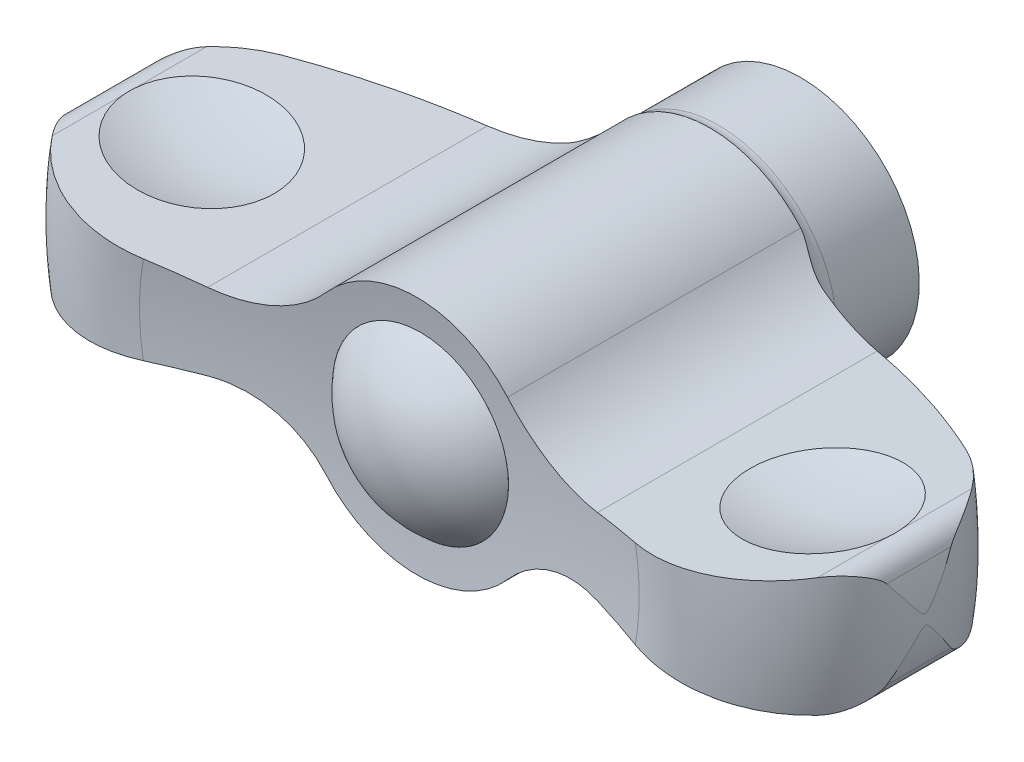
ISO-10303-21;
HEADER;
FILE_DESCRIPTION(('STEP AP214'),'2;1');
FILE_NAME('part.step','',(''),(''),'','','');
FILE_SCHEMA(('AUTOMOTIVE_DESIGN { 1 0 10303 214 1 1 1 1 }'));
ENDSEC;
DATA;
#1=APPLICATION_CONTEXT('core data for automotive mechanical design processes');
#2=APPLICATION_PROTOCOL_DEFINITION('international standard','automotive_design',2000,#1);
#3=PRODUCT_CONTEXT('',#1,'mechanical');
#4=PRODUCT('Part','Part','',(#3));
#5=PRODUCT_RELATED_PRODUCT_CATEGORY('part','',(#4));
#6=PRODUCT_DEFINITION_FORMATION('','',#4);
#7=PRODUCT_DEFINITION_CONTEXT('part definition',#1,'design');
#8=PRODUCT_DEFINITION('design','',#6,#7);
#9=PRODUCT_DEFINITION_SHAPE('','',#8);
#10=(LENGTH_UNIT() NAMED_UNIT(*) SI_UNIT(.MILLI.,.METRE.));
#11=(NAMED_UNIT(*) PLANE_ANGLE_UNIT() SI_UNIT($,.RADIAN.));
#12=(NAMED_UNIT(*) SI_UNIT($,.STERADIAN.) SOLID_ANGLE_UNIT());
#13=UNCERTAINTY_MEASURE_WITH_UNIT(LENGTH_MEASURE(1.E-05),#10,'distance_accuracy_value','');
#14=(GEOMETRIC_REPRESENTATION_CONTEXT(3) GLOBAL_UNCERTAINTY_ASSIGNED_CONTEXT((#13)) GLOBAL_UNIT_ASSIGNED_CONTEXT((#10,
#11,#12)) REPRESENTATION_CONTEXT('',''));
#15=CARTESIAN_POINT('',(0.,0.,0.));
#16=DIRECTION('',(0.,0.,1.));
#17=DIRECTION('',(1.,0.,0.));
#18=AXIS2_PLACEMENT_3D('',#15,#16,#17);
#19=CARTESIAN_POINT('',(21.903060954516,2.11625739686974,23.6709090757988));
#20=DIRECTION('',(0.,0.,-1.));
#21=DIRECTION('',(0.,1.,0.));
#22=AXIS2_PLACEMENT_3D('',#19,#20,#21);
#23=CYLINDRICAL_SURFACE('',#22,1.28181818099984);
#24=CARTESIAN_POINT('',(21.7368013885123,3.38724740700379,16.9179271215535));
#25=CARTESIAN_POINT('',(21.7478845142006,3.38865734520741,16.8330143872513));
#26=CARTESIAN_POINT('',(21.7560016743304,3.38961391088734,16.7477499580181));
#27=CARTESIAN_POINT('',(21.7667298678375,3.39082574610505,16.5772028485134));
#28=CARTESIAN_POINT('',(21.769362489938,3.39108376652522,16.4919215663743));
#29=CARTESIAN_POINT('',(21.7696299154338,3.39111203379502,16.3199353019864));
#30=CARTESIAN_POINT('',(21.7671810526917,3.39087411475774,16.2332301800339));
#31=CARTESIAN_POINT('',(21.756658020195,3.38968847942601,16.0598217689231));
#32=CARTESIAN_POINT('',(21.7485612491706,3.38873791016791,15.9731198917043));
#33=CARTESIAN_POINT('',(21.7374187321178,3.38732800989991,15.8867760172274));
#34=B_SPLINE_CURVE_WITH_KNOTS('',3,(#24,#25,#26,#27,#28,#29,#30,#31,#32,#33),.UNSPECIFIED.,.F.,
.F.,(4,2,2,2,4),(0.,0.256815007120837,0.512617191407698,0.772664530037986,1.03375851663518),.UNSPECIFIED.);
#35=CARTESIAN_POINT('',(21.7586465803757,3.38991446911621,16.7026640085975));
#36=VERTEX_POINT('',#35);
#37=CARTESIAN_POINT('',(21.7586465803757,3.38991446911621,16.0973359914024));
#38=VERTEX_POINT('',#37);
#39=EDGE_CURVE('E28',#36,#38,#34,.T.);
#40=ORIENTED_EDGE('',*,*,#39,.F.);
#41=DIRECTION('',(0.,0.,-1.));
#42=VECTOR('',#41,1.);
#43=CARTESIAN_POINT('',(21.7586465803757,3.38991446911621,23.6709090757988));
#44=LINE('',#43,#42);
#45=CARTESIAN_POINT('',(21.7586465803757,3.38991446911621,20.7958177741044));
#46=VERTEX_POINT('',#45);
#47=EDGE_CURVE('E190',#46,#36,#44,.T.);
#48=ORIENTED_EDGE('',*,*,#47,.F.);
#49=CARTESIAN_POINT('',(21.7584465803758,3.38989177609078,20.7960830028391));
#50=CARTESIAN_POINT('',(21.8187681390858,3.39669622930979,20.716115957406));
#51=CARTESIAN_POINT('',(21.8779628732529,3.39912622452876,20.6350308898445));
#52=CARTESIAN_POINT('',(21.9936307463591,3.39618875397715,20.4712254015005));
#53=CARTESIAN_POINT('',(22.0501073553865,3.39083151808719,20.3885072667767));
#54=CARTESIAN_POINT('',(22.1609650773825,3.37313486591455,20.2204080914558));
#55=CARTESIAN_POINT('',(22.2152942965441,3.36067838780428,20.1350056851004));
#56=CARTESIAN_POINT('',(22.3206226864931,3.32940238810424,19.9632780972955));
#57=CARTESIAN_POINT('',(22.3716204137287,3.31058012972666,19.8769525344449));
#58=CARTESIAN_POINT('',(22.4737853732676,3.26546548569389,19.6973401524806));
#59=CARTESIAN_POINT('',(22.5246826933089,3.23872136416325,19.6040134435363));
#60=CARTESIAN_POINT('',(22.6223347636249,3.17879469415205,19.4172678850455));
#61=CARTESIAN_POINT('',(22.6690894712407,3.14561207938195,19.3238490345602));
#62=CARTESIAN_POINT('',(22.7579418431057,3.07307597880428,19.1384983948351));
#63=CARTESIAN_POINT('',(22.8000827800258,3.03379006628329,19.0465612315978));
#64=CARTESIAN_POINT('',(22.8601690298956,2.9694039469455,18.9098445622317));
#65=CARTESIAN_POINT('',(22.8796811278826,2.9470264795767,18.8644600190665));
#66=CARTESIAN_POINT('',(22.9176497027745,2.90020761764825,18.7743229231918));
#67=CARTESIAN_POINT('',(22.9361063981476,2.87576665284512,18.7295702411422));
#68=CARTESIAN_POINT('',(22.9706553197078,2.82628848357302,18.6442224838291));
#69=CARTESIAN_POINT('',(22.986822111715,2.80142086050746,18.6035600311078));
#70=CARTESIAN_POINT('',(23.0181564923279,2.7491457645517,18.5236328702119));
#71=CARTESIAN_POINT('',(23.0333262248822,2.72174406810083,18.4843652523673));
#72=CARTESIAN_POINT('',(23.0627364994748,2.66333421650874,18.4076529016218));
#73=CARTESIAN_POINT('',(23.0769693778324,2.63230099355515,18.3702237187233));
#74=CARTESIAN_POINT('',(23.0973858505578,2.58206216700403,18.3169258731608));
#75=CARTESIAN_POINT('',(23.1040559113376,2.56463866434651,18.2995828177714));
#76=CARTESIAN_POINT('',(23.1170080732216,2.52827495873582,18.2663204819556));
#77=CARTESIAN_POINT('',(23.1232891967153,2.50933118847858,18.2504047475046));
#78=CARTESIAN_POINT('',(23.1293304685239,2.48951458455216,18.2354581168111));
#79=B_SPLINE_CURVE_WITH_KNOTS('',3,(#49,#50,#51,#52,#53,#54,#55,#56,#57,#58,#59,#60,#61,#62,#63,
#64,#65,#66,#67,#68,#69,#70,#71,#72,#73,#74,#75,#76,#77,#78),.UNSPECIFIED.,.F.,.F.,(4,2,2,2,2,2,
2,2,2,2,2,2,2,2,4),(0.,0.300965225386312,0.601535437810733,0.907211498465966,1.21301914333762,
1.54158846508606,1.87016116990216,2.1953259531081,2.35798462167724,2.52060949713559,
2.67152735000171,2.82210928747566,2.97379991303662,3.05014065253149,3.12666607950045),.UNSPECIFIED.);
#80=CARTESIAN_POINT('',(23.1292695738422,2.48971458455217,18.2356086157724));
#81=VERTEX_POINT('',#80);
#82=EDGE_CURVE('E373',#46,#81,#79,.T.);
#83=ORIENTED_EDGE('',*,*,#82,.T.);
#84=DIRECTION('',(0.,0.,-1.));
#85=VECTOR('',#84,1.);
#86=CARTESIAN_POINT('',(23.1292695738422,2.48971458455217,23.6709090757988));
#87=LINE('',#86,#85);
#88=CARTESIAN_POINT('',(23.1292695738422,2.48971458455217,14.5789368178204));
#89=VERTEX_POINT('',#88);
#90=EDGE_CURVE('E198',#81,#89,#87,.T.);
#91=ORIENTED_EDGE('',*,*,#90,.T.);
#92=CARTESIAN_POINT('',(23.1293304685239,2.48951458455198,14.5790873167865));
#93=CARTESIAN_POINT('',(23.1239279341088,2.5072435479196,14.5657251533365));
#94=CARTESIAN_POINT('',(23.1183309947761,2.52427243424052,14.5515760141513));
#95=CARTESIAN_POINT('',(23.1068167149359,2.55709191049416,14.5220867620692));
#96=CARTESIAN_POINT('',(23.1009000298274,2.57288488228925,14.5067490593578));
#97=CARTESIAN_POINT('',(23.0828105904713,2.6185718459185,14.4596263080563));
#98=CARTESIAN_POINT('',(23.0702335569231,2.64697771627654,14.4265660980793));
#99=CARTESIAN_POINT('',(23.0442996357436,2.70064641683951,14.3587465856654));
#100=CARTESIAN_POINT('',(23.030948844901,2.72592991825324,14.324000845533));
#101=CARTESIAN_POINT('',(23.0034323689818,2.77429614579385,14.2532178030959));
#102=CARTESIAN_POINT('',(22.9892650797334,2.79737428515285,14.2171780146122));
#103=CARTESIAN_POINT('',(22.9562887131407,2.84762532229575,14.1345482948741));
#104=CARTESIAN_POINT('',(22.9372513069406,2.87424333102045,14.0877138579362));
#105=CARTESIAN_POINT('',(22.8979996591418,2.9250728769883,13.9932372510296));
#106=CARTESIAN_POINT('',(22.8777851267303,2.94928381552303,13.9455948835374));
#107=CARTESIAN_POINT('',(22.8153983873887,3.01880394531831,13.8019143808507));
#108=CARTESIAN_POINT('',(22.7714807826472,3.06100378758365,13.705117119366));
#109=CARTESIAN_POINT('',(22.6785167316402,3.13871830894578,13.5097069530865));
#110=CARTESIAN_POINT('',(22.6294142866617,3.1741452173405,13.411086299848));
#111=CARTESIAN_POINT('',(22.5265882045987,3.2378313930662,13.2139284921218));
#112=CARTESIAN_POINT('',(22.4728646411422,3.26609077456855,13.1153913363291));
#113=CARTESIAN_POINT('',(22.367819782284,3.31205168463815,12.9310959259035));
#114=CARTESIAN_POINT('',(22.317017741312,3.33062494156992,12.8452587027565));
#115=CARTESIAN_POINT('',(22.2121185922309,3.36145923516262,12.6745019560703));
#116=CARTESIAN_POINT('',(22.1580227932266,3.37372276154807,12.5895820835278));
#117=CARTESIAN_POINT('',(22.0478154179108,3.39107543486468,12.4226590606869));
#118=CARTESIAN_POINT('',(21.9917632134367,3.39629899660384,12.3406312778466));
#119=CARTESIAN_POINT('',(21.8769942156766,3.39908686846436,12.1781882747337));
#120=CARTESIAN_POINT('',(21.8182741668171,3.3966415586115,12.0977752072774));
#121=CARTESIAN_POINT('',(21.7584465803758,3.38989177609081,12.0184624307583));
#122=B_SPLINE_CURVE_WITH_KNOTS('',3,(#92,#93,#94,#95,#96,#97,#98,#99,#100,#101,#102,#103,#104,
#105,#106,#107,#108,#109,#110,#111,#112,#113,#114,#115,#116,#117,#118,#119,#120,#121),
.UNSPECIFIED.,.F.,.F.,(4,2,2,2,2,2,2,2,2,2,2,2,2,2,4),(0.,0.0684657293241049,0.136796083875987,
0.272651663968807,0.407553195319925,0.542729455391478,0.71404654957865,0.885406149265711,
1.22810441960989,1.57498052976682,1.92185111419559,2.22599413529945,2.53001705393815,
2.82814885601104,3.12665478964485),.UNSPECIFIED.);
#123=CARTESIAN_POINT('',(21.7586465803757,3.38991446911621,12.018727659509));
#124=VERTEX_POINT('',#123);
#125=EDGE_CURVE('E385',#89,#124,#122,.T.);
#126=ORIENTED_EDGE('',*,*,#125,.T.);
#127=EDGE_CURVE('E193',#38,#124,#44,.T.);
#128=ORIENTED_EDGE('',*,*,#127,.F.);
#129=EDGE_LOOP('',(#40,#48,#83,#91,#126,#128));
#130=FACE_BOUND('',#129,.T.);
#131=ADVANCED_FACE('F14',(#130),#23,.T.);
#132=CARTESIAN_POINT('',(11.086877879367,2.17988954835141,23.6709090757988));
#133=DIRECTION('',(0.112663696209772,-0.993633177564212,0.));
#134=DIRECTION('',(0.993633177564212,0.112663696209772,0.));
#135=AXIS2_PLACEMENT_3D('',#132,#133,#134);
#136=PLANE('',#135);
#137=CARTESIAN_POINT('',(17.6500647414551,2.92406044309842,16.4));
#138=DIRECTION('',(0.112663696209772,-0.993633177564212,0.));
#139=DIRECTION('',(0.993633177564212,0.112663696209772,0.));
#140=AXIS2_PLACEMENT_3D('',#137,#138,#139);
#141=CIRCLE('',#140,4.14597035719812);
#142=EDGE_CURVE('E9',#38,#36,#141,.F.);
#143=ORIENTED_EDGE('',*,*,#142,.F.);
#144=ORIENTED_EDGE('',*,*,#127,.T.);
#145=CARTESIAN_POINT('',(21.7588465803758,3.38993714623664,12.0189929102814));
#146=CARTESIAN_POINT('',(21.6351113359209,3.37590735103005,11.8548411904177));
#147=CARTESIAN_POINT('',(21.5043985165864,3.36108639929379,11.6960165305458));
#148=CARTESIAN_POINT('',(21.2299729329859,3.32997048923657,11.3900223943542));
#149=CARTESIAN_POINT('',(21.0862530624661,3.31367472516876,11.242859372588));
#150=CARTESIAN_POINT('',(20.7895016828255,3.2800273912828,10.9638124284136));
#151=CARTESIAN_POINT('',(20.6366748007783,3.26269902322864,10.8317078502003));
#152=CARTESIAN_POINT('',(20.3206746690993,3.22686915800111,10.5808756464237));
#153=CARTESIAN_POINT('',(20.1575083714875,3.20836844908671,10.462139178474));
#154=CARTESIAN_POINT('',(19.9067524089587,3.17993633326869,10.2952496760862));
#155=CARTESIAN_POINT('',(19.8226337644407,3.17039849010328,10.2417470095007));
#156=CARTESIAN_POINT('',(19.6519017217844,3.15103993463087,10.1380576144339));
#157=CARTESIAN_POINT('',(19.5652790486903,3.14121817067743,10.0878863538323));
#158=CARTESIAN_POINT('',(19.4776491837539,3.13128220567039,10.0395389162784));
#159=B_SPLINE_CURVE_WITH_KNOTS('',3,(#145,#146,#147,#148,#149,#150,#151,#152,#153,#154,#155,
#156,#157,#158),.UNSPECIFIED.,.F.,.F.,(4,2,2,2,2,2,4),(0.,0.617941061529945,1.23622178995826,
1.84378368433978,2.45094131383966,2.75130930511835,3.05298637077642),.UNSPECIFIED.);
#160=CARTESIAN_POINT('',(19.4780116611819,3.13132330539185,10.0397389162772));
#161=VERTEX_POINT('',#160);
#162=EDGE_CURVE('E390',#124,#161,#159,.T.);
#163=ORIENTED_EDGE('',*,*,#162,.T.);
#164=CARTESIAN_POINT('',(19.4783895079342,3.1313661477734,10.0399389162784));
#165=CARTESIAN_POINT('',(18.8112458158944,3.05572165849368,9.6867809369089));
#166=CARTESIAN_POINT('',(18.1343664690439,2.97897328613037,9.35225735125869));
#167=CARTESIAN_POINT('',(16.7653426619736,2.82374569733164,8.72237733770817));
#168=CARTESIAN_POINT('',(16.0732510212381,2.74527246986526,8.42690463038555));
#169=CARTESIAN_POINT('',(14.6739160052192,2.58660802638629,7.87486082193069));
#170=CARTESIAN_POINT('',(13.9666726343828,2.50641681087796,7.6182897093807));
#171=CARTESIAN_POINT('',(12.5370183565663,2.34431459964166,7.1440736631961));
#172=CARTESIAN_POINT('',(11.8145676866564,2.26239909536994,6.92655014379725));
#173=CARTESIAN_POINT('',(11.086677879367,2.17986687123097,6.72935075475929));
#174=B_SPLINE_CURVE_WITH_KNOTS('',3,(#164,#165,#166,#167,#168,#169,#170,#171,#172,#173),
.UNSPECIFIED.,.F.,.F.,(4,2,2,2,4),(0.,2.27560231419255,4.5442682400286,6.81293350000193,
9.08853514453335),.UNSPECIFIED.);
#175=CARTESIAN_POINT('',(11.086877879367,2.17988954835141,6.72940494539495));
#176=VERTEX_POINT('',#175);
#177=EDGE_CURVE('E485',#161,#176,#174,.T.);
#178=ORIENTED_EDGE('',*,*,#177,.T.);
#179=DIRECTION('',(0.,0.,-1.));
#180=VECTOR('',#179,1.);
#181=CARTESIAN_POINT('',(11.086877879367,2.17988954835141,23.6709090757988));
#182=LINE('',#181,#180);
#183=CARTESIAN_POINT('',(11.086877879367,2.17988954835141,22.6313142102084));
#184=VERTEX_POINT('',#183);
#185=EDGE_CURVE('E203',#184,#176,#182,.T.);
#186=ORIENTED_EDGE('',*,*,#185,.F.);
#187=CARTESIAN_POINT('',(11.086677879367,2.17986687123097,22.631268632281));
#188=CARTESIAN_POINT('',(11.5737487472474,2.23509369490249,22.7422693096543));
#189=CARTESIAN_POINT('',(12.0589787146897,2.29011178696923,22.8604587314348));
#190=CARTESIAN_POINT('',(13.0257568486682,2.39973050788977,23.1112150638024));
#191=CARTESIAN_POINT('',(13.5073050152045,2.45433113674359,23.2437819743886));
#192=CARTESIAN_POINT('',(13.9870122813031,2.50872303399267,23.3835376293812));
#193=B_SPLINE_CURVE_WITH_KNOTS('',3,(#187,#188,#189,#190,#191,#192),.UNSPECIFIED.,.F.,.F.,(4,2,
4),(0.,1.50731372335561,3.01462744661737),.UNSPECIFIED.);
#194=CARTESIAN_POINT('',(13.9863257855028,2.50864519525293,23.3833376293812));
#195=VERTEX_POINT('',#194);
#196=EDGE_CURVE('E479',#184,#195,#193,.T.);
#197=ORIENTED_EDGE('',*,*,#196,.T.);
#198=CARTESIAN_POINT('',(11.0866778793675,2.17986687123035,21.7377865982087));
#199=CARTESIAN_POINT('',(11.2365037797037,2.19685497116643,21.8769298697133));
#200=CARTESIAN_POINT('',(11.3921915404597,2.214507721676,22.0096732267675));
#201=CARTESIAN_POINT('',(11.714111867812,2.25100885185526,22.2614902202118));
#202=CARTESIAN_POINT('',(11.880343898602,2.26985717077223,22.3805645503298));
#203=CARTESIAN_POINT('',(12.2220576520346,2.30860259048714,22.6041017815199));
#204=CARTESIAN_POINT('',(12.3975321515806,2.32849887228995,22.7085758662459));
#205=CARTESIAN_POINT('',(12.756595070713,2.36921143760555,22.9022854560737));
#206=CARTESIAN_POINT('',(12.9401834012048,2.39002771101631,22.9915211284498));
#207=CARTESIAN_POINT('',(13.3142267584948,2.43243884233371,23.1541429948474));
#208=CARTESIAN_POINT('',(13.5046837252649,2.45403392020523,23.2275246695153));
#209=CARTESIAN_POINT('',(13.891133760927,2.49785179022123,23.357907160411));
#210=CARTESIAN_POINT('',(14.0871288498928,2.52007481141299,23.4149019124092));
#211=CARTESIAN_POINT('',(14.4830953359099,2.56497170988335,23.5120406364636));
#212=CARTESIAN_POINT('',(14.6830646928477,2.58764535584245,23.5521930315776));
#213=CARTESIAN_POINT('',(15.0857295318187,2.63330175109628,23.6154096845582));
#214=CARTESIAN_POINT('',(15.2884260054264,2.65628461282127,23.6384675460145));
#215=CARTESIAN_POINT('',(15.6949227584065,2.70237549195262,23.6672930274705));
#216=CARTESIAN_POINT('',(15.8987224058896,2.72548343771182,23.673069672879));
#217=CARTESIAN_POINT('',(16.3061728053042,2.77168244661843,23.6673096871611));
#218=CARTESIAN_POINT('',(16.5098234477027,2.79477349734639,23.6557651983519));
#219=CARTESIAN_POINT('',(16.9154365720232,2.84076418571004,23.6154238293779));
#220=CARTESIAN_POINT('',(17.1173990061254,2.86366381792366,23.5866264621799));
#221=CARTESIAN_POINT('',(17.5180967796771,2.90909717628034,23.5119950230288));
#222=CARTESIAN_POINT('',(17.7168335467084,2.93163106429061,23.4661687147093));
#223=CARTESIAN_POINT('',(18.1095798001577,2.97616283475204,23.3578470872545));
#224=CARTESIAN_POINT('',(18.3035933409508,2.99816117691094,23.2953666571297));
#225=CARTESIAN_POINT('',(18.6856201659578,3.04147751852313,23.1541842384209));
#226=CARTESIAN_POINT('',(18.8736356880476,3.06279577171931,23.0754883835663));
#227=CARTESIAN_POINT('',(19.2424699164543,3.10461626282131,22.9023842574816));
#228=CARTESIAN_POINT('',(19.4232858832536,3.12511819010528,22.8079700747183));
#229=CARTESIAN_POINT('',(19.7762870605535,3.16514344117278,22.604156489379));
#230=CARTESIAN_POINT('',(19.9484756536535,3.18466714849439,22.4947630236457));
#231=CARTESIAN_POINT('',(20.2722545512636,3.22137901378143,22.2692707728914));
#232=CARTESIAN_POINT('',(20.4244570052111,3.23863658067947,22.1540607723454));
#233=CARTESIAN_POINT('',(20.71934186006,3.27207227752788,21.911907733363));
#234=CARTESIAN_POINT('',(20.8620247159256,3.28825045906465,21.7849652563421));
#235=CARTESIAN_POINT('',(21.1370148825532,3.31943038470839,21.5200952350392));
#236=CARTESIAN_POINT('',(21.2693193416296,3.33443180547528,21.3821646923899));
#237=CARTESIAN_POINT('',(21.5227070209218,3.36316232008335,21.0962090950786));
#238=CARTESIAN_POINT('',(21.6437891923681,3.37689129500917,20.9481830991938));
#239=CARTESIAN_POINT('',(21.7588465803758,3.38993714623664,20.795552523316));
#240=B_SPLINE_CURVE_WITH_KNOTS('',3,(#198,#199,#200,#201,#202,#203,#204,#205,#206,#207,#208,
#209,#210,#211,#212,#213,#214,#215,#216,#217,#218,#219,#220,#221,#222,#223,#224,#225,#226,#227,
#228,#229,#230,#231,#232,#233,#234,#235,#236,#237,#238,#239),.UNSPECIFIED.,.F.,.F.,(4,2,2,2,2,2,
2,2,2,2,2,2,2,2,2,2,2,2,2,2,4),(0.,0.615339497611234,1.23064775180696,1.84548207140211,
2.46030964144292,3.07531224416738,3.69054214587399,4.3054639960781,4.92061582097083,
5.53544631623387,6.15055581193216,6.76568267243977,7.38052943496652,7.99482834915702,
8.60889532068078,9.22319376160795,9.83724943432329,10.4116635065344,10.9860501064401,
11.5605939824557,12.1351914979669),.UNSPECIFIED.);
#241=EDGE_CURVE('E197',#195,#46,#240,.T.);
#242=ORIENTED_EDGE('',*,*,#241,.T.);
#243=ORIENTED_EDGE('',*,*,#47,.T.);
#244=EDGE_LOOP('',(#143,#144,#163,#178,#186,#197,#242,#243));
#245=FACE_BOUND('',#244,.T.);
#246=ADVANCED_FACE('F195',(#245),#136,.F.);
#247=CARTESIAN_POINT('',(21.9030609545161,-2.1162573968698,23.6709090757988));
#248=DIRECTION('',(0.,0.,-1.));
#249=DIRECTION('',(0.,1.,0.));
#250=AXIS2_PLACEMENT_3D('',#247,#248,#249);
#251=CYLINDRICAL_SURFACE('',#250,1.28181818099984);
#252=CARTESIAN_POINT('',(21.7374187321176,-3.38732800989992,15.8867760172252));
#253=CARTESIAN_POINT('',(21.7485612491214,-3.38873791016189,15.9731198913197));
#254=CARTESIAN_POINT('',(21.7566580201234,-3.38968847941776,16.0598217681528));
#255=CARTESIAN_POINT('',(21.7671810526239,-3.39087411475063,16.2332301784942));
#256=CARTESIAN_POINT('',(21.7696299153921,-3.39111203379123,16.3199353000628));
#257=CARTESIAN_POINT('',(21.7693624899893,-3.39108376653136,16.4919215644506));
#258=CARTESIAN_POINT('',(21.7667298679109,-3.39082574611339,16.5772028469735));
#259=CARTESIAN_POINT('',(21.756001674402,-3.38961391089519,16.7477499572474));
#260=CARTESIAN_POINT('',(21.747884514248,-3.38865734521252,16.833014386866));
#261=CARTESIAN_POINT('',(21.7368013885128,-3.38724740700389,16.9179271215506));
#262=B_SPLINE_CURVE_WITH_KNOTS('',3,(#252,#253,#254,#255,#256,#257,#258,#259,#260,#261),
.UNSPECIFIED.,.F.,.F.,(4,2,2,2,4),(0.,0.261093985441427,0.521141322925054,0.776943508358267,
1.03375851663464),.UNSPECIFIED.);
#263=CARTESIAN_POINT('',(21.7586465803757,-3.38991446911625,16.0973359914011));
#264=VERTEX_POINT('',#263);
#265=CARTESIAN_POINT('',(21.7586465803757,-3.38991446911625,16.7026640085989));
#266=VERTEX_POINT('',#265);
#267=EDGE_CURVE('E35',#264,#266,#262,.T.);
#268=ORIENTED_EDGE('',*,*,#267,.F.);
#269=DIRECTION('',(0.,0.,-1.));
#270=VECTOR('',#269,1.);
#271=CARTESIAN_POINT('',(21.7586465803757,-3.38991446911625,23.6709090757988));
#272=LINE('',#271,#270);
#273=CARTESIAN_POINT('',(21.7586465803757,-3.38991446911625,12.018727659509));
#274=VERTEX_POINT('',#273);
#275=EDGE_CURVE('E606',#264,#274,#272,.T.);
#276=ORIENTED_EDGE('',*,*,#275,.T.);
#277=CARTESIAN_POINT('',(21.7584465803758,-3.38989177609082,12.0184624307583));
#278=CARTESIAN_POINT('',(21.8187681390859,-3.39669622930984,12.0984294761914));
#279=CARTESIAN_POINT('',(21.8779628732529,-3.39912622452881,12.1795145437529));
#280=CARTESIAN_POINT('',(21.9936307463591,-3.3961887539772,12.343320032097));
#281=CARTESIAN_POINT('',(22.0501073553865,-3.39083151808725,12.4260381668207));
#282=CARTESIAN_POINT('',(22.1609650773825,-3.37313486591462,12.5941373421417));
#283=CARTESIAN_POINT('',(22.2152942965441,-3.36067838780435,12.6795397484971));
#284=CARTESIAN_POINT('',(22.3206226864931,-3.32940238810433,12.851267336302));
#285=CARTESIAN_POINT('',(22.3716204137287,-3.31058012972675,12.9375928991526));
#286=CARTESIAN_POINT('',(22.4737853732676,-3.26546548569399,13.1172052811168));
#287=CARTESIAN_POINT('',(22.5246826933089,-3.23872136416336,13.2105319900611));
#288=CARTESIAN_POINT('',(22.6223347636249,-3.17879469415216,13.397277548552));
#289=CARTESIAN_POINT('',(22.6690894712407,-3.14561207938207,13.4906963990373));
#290=CARTESIAN_POINT('',(22.7579418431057,-3.0730759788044,13.6760470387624));
#291=CARTESIAN_POINT('',(22.8000827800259,-3.03379006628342,13.7679842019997));
#292=CARTESIAN_POINT('',(22.8601690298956,-2.96940394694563,13.9047008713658));
#293=CARTESIAN_POINT('',(22.8796811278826,-2.94702647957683,13.950085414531));
#294=CARTESIAN_POINT('',(22.9176497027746,-2.9002076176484,14.0402225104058));
#295=CARTESIAN_POINT('',(22.9361063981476,-2.8757666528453,14.0849751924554));
#296=CARTESIAN_POINT('',(22.9706553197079,-2.8262884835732,14.1703229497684));
#297=CARTESIAN_POINT('',(22.986822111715,-2.80142086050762,14.2109854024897));
#298=CARTESIAN_POINT('',(23.0181564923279,-2.74914576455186,14.2909125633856));
#299=CARTESIAN_POINT('',(23.0333262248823,-2.721744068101,14.3301801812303));
#300=CARTESIAN_POINT('',(23.0627364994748,-2.66333421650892,14.4068925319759));
#301=CARTESIAN_POINT('',(23.0769693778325,-2.63230099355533,14.4443217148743));
#302=CARTESIAN_POINT('',(23.0973858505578,-2.58206216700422,14.4976195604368));
#303=CARTESIAN_POINT('',(23.1040559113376,-2.5646386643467,14.5149626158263));
#304=CARTESIAN_POINT('',(23.1170080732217,-2.52827495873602,14.5482249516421));
#305=CARTESIAN_POINT('',(23.1232891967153,-2.50933118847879,14.5641406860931));
#306=CARTESIAN_POINT('',(23.1293304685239,-2.48951458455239,14.5790873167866));
#307=B_SPLINE_CURVE_WITH_KNOTS('',3,(#277,#278,#279,#280,#281,#282,#283,#284,#285,#286,#287,
#288,#289,#290,#291,#292,#293,#294,#295,#296,#297,#298,#299,#300,#301,#302,#303,#304,#305,#306),
.UNSPECIFIED.,.F.,.F.,(4,2,2,2,2,2,2,2,2,2,2,2,2,2,4),(0.,0.300965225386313,0.601535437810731,
0.907211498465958,1.2130191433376,1.54158846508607,1.87016116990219,2.19532595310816,
2.35798462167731,2.52060949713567,2.6715273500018,2.82210928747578,2.97379991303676,
3.05014065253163,3.12666607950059),.UNSPECIFIED.);
#308=CARTESIAN_POINT('',(23.1292695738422,-2.48971458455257,14.5789368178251));
#309=VERTEX_POINT('',#308);
#310=EDGE_CURVE('E280',#274,#309,#307,.T.);
#311=ORIENTED_EDGE('',*,*,#310,.T.);
#312=DIRECTION('',(0.,0.,-1.));
#313=VECTOR('',#312,1.);
#314=CARTESIAN_POINT('',(23.1292695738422,-2.48971458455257,23.6709090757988));
#315=LINE('',#314,#313);
#316=CARTESIAN_POINT('',(23.1292695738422,-2.48971458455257,18.2356086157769));
#317=VERTEX_POINT('',#316);
#318=EDGE_CURVE('E603',#317,#309,#315,.T.);
#319=ORIENTED_EDGE('',*,*,#318,.F.);
#320=CARTESIAN_POINT('',(23.1293304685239,-2.48951458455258,18.2354581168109));
#321=CARTESIAN_POINT('',(23.1239279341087,-2.50724354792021,18.248820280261));
#322=CARTESIAN_POINT('',(23.118330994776,-2.52427243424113,18.2629694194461));
#323=CARTESIAN_POINT('',(23.1068167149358,-2.55709191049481,18.2924586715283));
#324=CARTESIAN_POINT('',(23.1009000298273,-2.57288488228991,18.3077963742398));
#325=CARTESIAN_POINT('',(23.0828105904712,-2.6185718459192,18.3549191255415));
#326=CARTESIAN_POINT('',(23.0702335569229,-2.64697771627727,18.3879793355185));
#327=CARTESIAN_POINT('',(23.0442996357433,-2.70064641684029,18.4557988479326));
#328=CARTESIAN_POINT('',(23.0309488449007,-2.72592991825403,18.4905445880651));
#329=CARTESIAN_POINT('',(23.0034323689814,-2.77429614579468,18.5613276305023));
#330=CARTESIAN_POINT('',(22.989265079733,-2.79737428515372,18.5973674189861));
#331=CARTESIAN_POINT('',(22.9562887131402,-2.84762532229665,18.6799971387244));
#332=CARTESIAN_POINT('',(22.9372513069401,-2.87424333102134,18.7268315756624));
#333=CARTESIAN_POINT('',(22.8979996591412,-2.9250728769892,18.8213081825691));
#334=CARTESIAN_POINT('',(22.8777851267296,-2.94928381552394,18.8689505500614));
#335=CARTESIAN_POINT('',(22.8153983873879,-3.01880394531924,19.0126310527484));
#336=CARTESIAN_POINT('',(22.7714807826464,-3.06100378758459,19.1094283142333));
#337=CARTESIAN_POINT('',(22.6785167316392,-3.13871830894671,19.304838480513));
#338=CARTESIAN_POINT('',(22.6294142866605,-3.17414521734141,19.4034591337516));
#339=CARTESIAN_POINT('',(22.5265882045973,-3.23783139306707,19.6006169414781));
#340=CARTESIAN_POINT('',(22.4728646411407,-3.26609077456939,19.699154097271));
#341=CARTESIAN_POINT('',(22.3678197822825,-3.31205168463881,19.8834495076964));
#342=CARTESIAN_POINT('',(22.3170177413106,-3.33062494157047,19.9692867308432));
#343=CARTESIAN_POINT('',(22.2121185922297,-3.36145923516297,20.1400434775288));
#344=CARTESIAN_POINT('',(22.1580227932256,-3.37372276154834,20.2249633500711));
#345=CARTESIAN_POINT('',(22.0478154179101,-3.39107543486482,20.3918863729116));
#346=CARTESIAN_POINT('',(21.9917632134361,-3.39629899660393,20.4739141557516));
#347=CARTESIAN_POINT('',(21.8769942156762,-3.3990868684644,20.6363571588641));
#348=CARTESIAN_POINT('',(21.8182741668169,-3.39664155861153,20.7167702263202));
#349=CARTESIAN_POINT('',(21.7584465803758,-3.38989177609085,20.796083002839));
#350=B_SPLINE_CURVE_WITH_KNOTS('',3,(#320,#321,#322,#323,#324,#325,#326,#327,#328,#329,#330,
#331,#332,#333,#334,#335,#336,#337,#338,#339,#340,#341,#342,#343,#344,#345,#346,#347,#348,#349),
.UNSPECIFIED.,.F.,.F.,(4,2,2,2,2,2,2,2,2,2,2,2,2,2,4),(0.,0.0684657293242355,0.136796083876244,
0.272651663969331,0.407553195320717,0.542729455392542,0.714046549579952,0.88540614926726,
1.22810441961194,1.57498052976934,1.92185111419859,2.22599413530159,2.53001705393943,
2.82814885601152,3.12665478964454),.UNSPECIFIED.);
#351=CARTESIAN_POINT('',(21.7586465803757,-3.38991446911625,20.7958177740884));
#352=VERTEX_POINT('',#351);
#353=EDGE_CURVE('E254',#317,#352,#350,.T.);
#354=ORIENTED_EDGE('',*,*,#353,.T.);
#355=EDGE_CURVE('E607',#352,#266,#272,.T.);
#356=ORIENTED_EDGE('',*,*,#355,.T.);
#357=EDGE_LOOP('',(#268,#276,#311,#319,#354,#356));
#358=FACE_BOUND('',#357,.T.);
#359=ADVANCED_FACE('F226',(#358),#251,.T.);
#360=CARTESIAN_POINT('',(11.086877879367,-2.17988954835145,23.6709090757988));
#361=DIRECTION('',(0.112663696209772,0.993633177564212,0.));
#362=DIRECTION('',(-0.993633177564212,0.112663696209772,0.));
#363=AXIS2_PLACEMENT_3D('',#360,#361,#362);
#364=PLANE('',#363);
#365=CARTESIAN_POINT('',(17.6500647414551,-2.92406044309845,16.4));
#366=DIRECTION('',(0.112663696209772,0.993633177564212,0.));
#367=DIRECTION('',(-0.993633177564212,0.112663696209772,0.));
#368=AXIS2_PLACEMENT_3D('',#365,#366,#367);
#369=CIRCLE('',#368,4.14597035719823);
#370=EDGE_CURVE('E23',#266,#264,#369,.F.);
#371=ORIENTED_EDGE('',*,*,#370,.F.);
#372=ORIENTED_EDGE('',*,*,#355,.F.);
#373=CARTESIAN_POINT('',(21.7588465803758,-3.38993714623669,20.795552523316));
#374=CARTESIAN_POINT('',(21.63607452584,-3.3760165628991,20.958423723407));
#375=CARTESIAN_POINT('',(21.5064380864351,-3.36131765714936,21.116048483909));
#376=CARTESIAN_POINT('',(21.2344412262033,-3.3304771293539,21.4197417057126));
#377=CARTESIAN_POINT('',(21.0920814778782,-3.31433558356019,21.5658107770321));
#378=CARTESIAN_POINT('',(20.795754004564,-3.28073631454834,21.8452293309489));
#379=CARTESIAN_POINT('',(20.6417961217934,-3.26327970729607,21.9785893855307));
#380=CARTESIAN_POINT('',(20.3232711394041,-3.22716356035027,22.2317873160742));
#381=CARTESIAN_POINT('',(20.1587041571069,-3.20850403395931,22.3516253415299));
#382=CARTESIAN_POINT('',(19.8200834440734,-3.17010932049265,22.5769629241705));
#383=CARTESIAN_POINT('',(19.6460271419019,-3.15037384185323,22.6824585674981));
#384=CARTESIAN_POINT('',(19.2896419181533,-3.10996488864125,22.8783644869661));
#385=CARTESIAN_POINT('',(19.1073099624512,-3.0892910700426,22.9687691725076));
#386=CARTESIAN_POINT('',(18.7358211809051,-3.0471695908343,23.1337681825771));
#387=CARTESIAN_POINT('',(18.5466677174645,-3.02572231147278,23.2083701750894));
#388=CARTESIAN_POINT('',(18.1627237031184,-2.98218858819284,23.3413205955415));
#389=CARTESIAN_POINT('',(17.9679310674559,-2.96010190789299,23.3996629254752));
#390=CARTESIAN_POINT('',(17.5740737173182,-2.91544415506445,23.4996707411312));
#391=CARTESIAN_POINT('',(17.3750071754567,-2.89287287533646,23.5413289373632));
#392=CARTESIAN_POINT('',(16.9740067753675,-2.84740520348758,23.6076577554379));
#393=CARTESIAN_POINT('',(16.7720716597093,-2.82450866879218,23.6323206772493));
#394=CARTESIAN_POINT('',(16.3668492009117,-2.7785622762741,23.6644604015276));
#395=CARTESIAN_POINT('',(16.1635618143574,-2.75551241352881,23.6719366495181));
#396=CARTESIAN_POINT('',(15.7571745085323,-2.70943394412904,23.6696552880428));
#397=CARTESIAN_POINT('',(15.554074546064,-2.68640533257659,23.6599054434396));
#398=CARTESIAN_POINT('',(15.1490456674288,-2.64048088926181,23.6232292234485));
#399=CARTESIAN_POINT('',(14.9471194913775,-2.61758536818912,23.5962721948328));
#400=CARTESIAN_POINT('',(14.5463128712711,-2.57213966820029,23.525363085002));
#401=CARTESIAN_POINT('',(14.3474313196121,-2.54958936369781,23.4814173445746));
#402=CARTESIAN_POINT('',(13.9539663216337,-2.50497609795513,23.3768256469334));
#403=CARTESIAN_POINT('',(13.7593846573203,-2.48291333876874,23.3161729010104));
#404=CARTESIAN_POINT('',(13.3760531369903,-2.43944906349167,23.1786334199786));
#405=CARTESIAN_POINT('',(13.1873010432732,-2.41804729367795,23.1017530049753));
#406=CARTESIAN_POINT('',(12.8269874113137,-2.37719291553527,22.9369128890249));
#407=CARTESIAN_POINT('',(12.6550495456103,-2.35769763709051,22.8497848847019));
#408=CARTESIAN_POINT('',(12.3186050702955,-2.31954967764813,22.6620496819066));
#409=CARTESIAN_POINT('',(12.1540981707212,-2.30089696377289,22.5614430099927));
#410=CARTESIAN_POINT('',(11.8335113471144,-2.26454703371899,22.3473490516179));
#411=CARTESIAN_POINT('',(11.6774338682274,-2.24685009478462,22.2338580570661));
#412=CARTESIAN_POINT('',(11.3747233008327,-2.21252707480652,21.9947402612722));
#413=CARTESIAN_POINT('',(11.2280910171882,-2.19590108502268,21.8691124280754));
#414=CARTESIAN_POINT('',(11.0866778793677,-2.17986687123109,21.7377865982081));
#415=B_SPLINE_CURVE_WITH_KNOTS('',3,(#373,#374,#375,#376,#377,#378,#379,#380,#381,#382,#383,
#384,#385,#386,#387,#388,#389,#390,#391,#392,#393,#394,#395,#396,#397,#398,#399,#400,#401,#402,
#403,#404,#405,#406,#407,#408,#409,#410,#411,#412,#413,#414),.UNSPECIFIED.,.F.,.F.,(4,2,2,2,2,2,
2,2,2,2,2,2,2,2,2,2,2,2,2,2,4),(0.,0.613117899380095,1.22620341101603,1.83877439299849,
2.45133860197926,3.06406963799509,3.67702716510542,4.28968658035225,4.90257545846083,
5.51573182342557,6.12916580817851,6.74261958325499,7.35579690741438,7.97006961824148,
8.58411328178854,9.19840682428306,9.81246156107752,10.3930654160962,10.9736465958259,
11.5543952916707,12.1351934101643),.UNSPECIFIED.);
#416=CARTESIAN_POINT('',(13.9863257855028,-2.50864519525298,23.3833376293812));
#417=VERTEX_POINT('',#416);
#418=EDGE_CURVE('E246',#352,#417,#415,.T.);
#419=ORIENTED_EDGE('',*,*,#418,.T.);
#420=CARTESIAN_POINT('',(13.9870122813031,-2.5087230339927,23.3835376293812));
#421=CARTESIAN_POINT('',(13.5073050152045,-2.45433113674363,23.2437819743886));
#422=CARTESIAN_POINT('',(13.0257568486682,-2.39973050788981,23.1112150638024));
#423=CARTESIAN_POINT('',(12.0589787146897,-2.29011178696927,22.8604587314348));
#424=CARTESIAN_POINT('',(11.5737487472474,-2.23509369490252,22.7422693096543));
#425=CARTESIAN_POINT('',(11.086677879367,-2.179866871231,22.631268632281));
#426=B_SPLINE_CURVE_WITH_KNOTS('',3,(#420,#421,#422,#423,#424,#425),.UNSPECIFIED.,.F.,.F.,(4,2,
4),(0.,1.50731372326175,3.01462744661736),.UNSPECIFIED.);
#427=CARTESIAN_POINT('',(11.086877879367,-2.17988954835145,22.6313142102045));
#428=VERTEX_POINT('',#427);
#429=EDGE_CURVE('E201',#417,#428,#426,.T.);
#430=ORIENTED_EDGE('',*,*,#429,.T.);
#431=DIRECTION('',(0.,0.,-1.));
#432=VECTOR('',#431,1.);
#433=CARTESIAN_POINT('',(11.086877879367,-2.17988954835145,23.6709090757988));
#434=LINE('',#433,#432);
#435=CARTESIAN_POINT('',(11.086877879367,-2.17988954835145,6.72940494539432));
#436=VERTEX_POINT('',#435);
#437=EDGE_CURVE('E610',#428,#436,#434,.T.);
#438=ORIENTED_EDGE('',*,*,#437,.T.);
#439=CARTESIAN_POINT('',(11.086677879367,-2.17986687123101,6.7293507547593));
#440=CARTESIAN_POINT('',(11.8145676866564,-2.26239909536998,6.92655014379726));
#441=CARTESIAN_POINT('',(12.5370183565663,-2.34431459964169,7.1440736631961));
#442=CARTESIAN_POINT('',(13.9666726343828,-2.506416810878,7.6182897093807));
#443=CARTESIAN_POINT('',(14.6739160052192,-2.58660802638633,7.87486082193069));
#444=CARTESIAN_POINT('',(16.0732510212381,-2.7452724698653,8.42690463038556));
#445=CARTESIAN_POINT('',(16.7653426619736,-2.82374569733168,8.72237733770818));
#446=CARTESIAN_POINT('',(18.1343664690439,-2.97897328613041,9.35225735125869));
#447=CARTESIAN_POINT('',(18.8112458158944,-3.05572165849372,9.6867809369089));
#448=CARTESIAN_POINT('',(19.4783895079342,-3.13136614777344,10.0399389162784));
#449=B_SPLINE_CURVE_WITH_KNOTS('',3,(#439,#440,#441,#442,#443,#444,#445,#446,#447,#448),
.UNSPECIFIED.,.F.,.F.,(4,2,2,2,4),(0.,2.27560164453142,4.54426690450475,6.81293283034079,
9.08853514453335),.UNSPECIFIED.);
#450=CARTESIAN_POINT('',(19.4780116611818,-3.13132330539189,10.0397389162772));
#451=VERTEX_POINT('',#450);
#452=EDGE_CURVE('E213',#436,#451,#449,.T.);
#453=ORIENTED_EDGE('',*,*,#452,.T.);
#454=CARTESIAN_POINT('',(19.4776491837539,-3.13128220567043,10.0395389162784));
#455=CARTESIAN_POINT('',(19.6571826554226,-3.15163871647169,10.1385640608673));
#456=CARTESIAN_POINT('',(19.8325127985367,-3.1715186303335,10.2453098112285));
#457=CARTESIAN_POINT('',(20.1736402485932,-3.21019757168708,10.4734481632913));
#458=CARTESIAN_POINT('',(20.3394321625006,-3.22899598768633,10.5948489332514));
#459=CARTESIAN_POINT('',(20.65737148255,-3.26504572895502,10.8491651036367));
#460=CARTESIAN_POINT('',(20.8097056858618,-3.28231823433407,10.9818442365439));
#461=CARTESIAN_POINT('',(21.1027472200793,-3.31554492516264,11.2594738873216));
#462=CARTESIAN_POINT('',(21.2434622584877,-3.33149998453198,11.4044161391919));
#463=CARTESIAN_POINT('',(21.4443901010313,-3.3542823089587,11.6294659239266));
#464=CARTESIAN_POINT('',(21.5093530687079,-3.36164817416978,11.7053277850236));
#465=CARTESIAN_POINT('',(21.6363842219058,-3.37605167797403,11.8600255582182));
#466=CARTESIAN_POINT('',(21.6984385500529,-3.38308774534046,11.938872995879));
#467=CARTESIAN_POINT('',(21.7588465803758,-3.38993714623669,12.0189929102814));
#468=B_SPLINE_CURVE_WITH_KNOTS('',3,(#454,#455,#456,#457,#458,#459,#460,#461,#462,#463,#464,
#465,#466,#467),.UNSPECIFIED.,.F.,.F.,(4,2,2,2,2,2,4),(0.,0.617939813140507,1.23622565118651,
1.84378641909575,2.45094087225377,2.75130890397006,3.05298664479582),.UNSPECIFIED.);
#469=EDGE_CURVE('E236',#451,#274,#468,.T.);
#470=ORIENTED_EDGE('',*,*,#469,.T.);
#471=ORIENTED_EDGE('',*,*,#275,.F.);
#472=EDGE_LOOP('',(#371,#372,#419,#430,#438,#453,#470,#471));
#473=FACE_BOUND('',#472,.T.);
#474=ADVANCED_FACE('F220',(#473),#364,.F.);
#475=CARTESIAN_POINT('',(-11.0868778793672,2.17988954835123,23.6709090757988));
#476=DIRECTION('',(-0.112663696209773,-0.993633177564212,0.));
#477=DIRECTION('',(0.993633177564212,-0.112663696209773,0.));
#478=AXIS2_PLACEMENT_3D('',#475,#476,#477);
#479=PLANE('',#478);
#480=CARTESIAN_POINT('',(-17.6500647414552,2.92406044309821,16.4));
#481=DIRECTION('',(-0.112663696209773,-0.993633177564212,0.));
#482=DIRECTION('',(0.993633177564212,-0.112663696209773,0.));
#483=AXIS2_PLACEMENT_3D('',#480,#481,#482);
#484=CIRCLE('',#483,4.14597035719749);
#485=CARTESIAN_POINT('',(-21.758646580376,3.38991446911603,16.7026640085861));
#486=VERTEX_POINT('',#485);
#487=CARTESIAN_POINT('',(-21.758646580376,3.38991446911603,16.0973359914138));
#488=VERTEX_POINT('',#487);
#489=EDGE_CURVE('E1074',#486,#488,#484,.F.);
#490=ORIENTED_EDGE('',*,*,#489,.F.);
#491=DIRECTION('',(0.,0.,-1.));
#492=VECTOR('',#491,1.);
#493=CARTESIAN_POINT('',(-21.758646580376,3.38991446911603,23.6709090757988));
#494=LINE('',#493,#492);
#495=CARTESIAN_POINT('',(-21.758646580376,3.38991446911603,20.7958177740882));
#496=VERTEX_POINT('',#495);
#497=EDGE_CURVE('E632',#496,#486,#494,.T.);
#498=ORIENTED_EDGE('',*,*,#497,.F.);
#499=CARTESIAN_POINT('',(-21.758846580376,3.38993714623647,20.7955525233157));
#500=CARTESIAN_POINT('',(-21.6360745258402,3.37601656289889,20.9584237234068));
#501=CARTESIAN_POINT('',(-21.5064380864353,3.36131765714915,21.1160484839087));
#502=CARTESIAN_POINT('',(-21.2344412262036,3.33047712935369,21.4197417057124));
#503=CARTESIAN_POINT('',(-21.0920814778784,3.31433558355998,21.5658107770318));
#504=CARTESIAN_POINT('',(-20.7957540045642,3.28073631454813,21.8452293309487));
#505=CARTESIAN_POINT('',(-20.6417961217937,3.26327970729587,21.9785893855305));
#506=CARTESIAN_POINT('',(-20.3232711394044,3.22716356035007,22.2317873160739));
#507=CARTESIAN_POINT('',(-20.1587041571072,3.2085040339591,22.3516253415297));
#508=CARTESIAN_POINT('',(-19.8200834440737,3.17010932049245,22.5769629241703));
#509=CARTESIAN_POINT('',(-19.6460271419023,3.15037384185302,22.6824585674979));
#510=CARTESIAN_POINT('',(-19.2896419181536,3.10996488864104,22.878364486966));
#511=CARTESIAN_POINT('',(-19.1073099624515,3.0892910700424,22.9687691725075));
#512=CARTESIAN_POINT('',(-18.7358211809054,3.0471695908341,23.133768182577));
#513=CARTESIAN_POINT('',(-18.5466677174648,3.02572231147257,23.2083701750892));
#514=CARTESIAN_POINT('',(-18.1627237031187,2.98218858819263,23.3413205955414));
#515=CARTESIAN_POINT('',(-17.9679310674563,2.96010190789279,23.3996629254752));
#516=CARTESIAN_POINT('',(-17.5740737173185,2.91544415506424,23.4996707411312));
#517=CARTESIAN_POINT('',(-17.3750071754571,2.89287287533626,23.5413289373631));
#518=CARTESIAN_POINT('',(-16.9740067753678,2.84740520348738,23.6076577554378));
#519=CARTESIAN_POINT('',(-16.7720716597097,2.82450866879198,23.6323206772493));
#520=CARTESIAN_POINT('',(-16.366849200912,2.7785622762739,23.6644604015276));
#521=CARTESIAN_POINT('',(-16.1635618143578,2.7555124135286,23.6719366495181));
#522=CARTESIAN_POINT('',(-15.7571745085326,2.70943394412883,23.6696552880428));
#523=CARTESIAN_POINT('',(-15.5540745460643,2.68640533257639,23.6599054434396));
#524=CARTESIAN_POINT('',(-15.1490456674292,2.64048088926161,23.6232292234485));
#525=CARTESIAN_POINT('',(-14.9471194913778,2.61758536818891,23.5962721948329));
#526=CARTESIAN_POINT('',(-14.5463128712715,2.57213966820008,23.5253630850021));
#527=CARTESIAN_POINT('',(-14.3474313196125,2.5495893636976,23.4814173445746));
#528=CARTESIAN_POINT('',(-13.9539663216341,2.50497609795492,23.3768256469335));
#529=CARTESIAN_POINT('',(-13.7593846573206,2.48291333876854,23.3161729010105));
#530=CARTESIAN_POINT('',(-13.3760531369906,2.43944906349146,23.1786334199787));
#531=CARTESIAN_POINT('',(-13.1873010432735,2.41804729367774,23.1017530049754));
#532=CARTESIAN_POINT('',(-12.826987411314,2.37719291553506,22.936912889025));
#533=CARTESIAN_POINT('',(-12.6550495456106,2.3576976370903,22.849784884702));
#534=CARTESIAN_POINT('',(-12.3186050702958,2.31954967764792,22.6620496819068));
#535=CARTESIAN_POINT('',(-12.1540981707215,2.30089696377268,22.5614430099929));
#536=CARTESIAN_POINT('',(-11.8335113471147,2.26454703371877,22.3473490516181));
#537=CARTESIAN_POINT('',(-11.6774338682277,2.24685009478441,22.2338580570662));
#538=CARTESIAN_POINT('',(-11.374723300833,2.2125270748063,21.9947402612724));
#539=CARTESIAN_POINT('',(-11.2280910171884,2.19590108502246,21.8691124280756));
#540=CARTESIAN_POINT('',(-11.086677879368,2.17986687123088,21.7377865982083));
#541=B_SPLINE_CURVE_WITH_KNOTS('',3,(#499,#500,#501,#502,#503,#504,#505,#506,#507,#508,#509,
#510,#511,#512,#513,#514,#515,#516,#517,#518,#519,#520,#521,#522,#523,#524,#525,#526,#527,#528,
#529,#530,#531,#532,#533,#534,#535,#536,#537,#538,#539,#540),.UNSPECIFIED.,.F.,.F.,(4,2,2,2,2,2,
2,2,2,2,2,2,2,2,2,2,2,2,2,2,4),(0.,0.613117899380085,1.22620341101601,1.83877439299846,
2.45133860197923,3.06406963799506,3.67702716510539,4.28968658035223,4.90257545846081,
5.51573182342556,6.12916580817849,6.74261958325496,7.35579690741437,7.97006961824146,
8.58411328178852,9.19840682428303,9.81246156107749,10.3930654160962,10.9736465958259,
11.5543952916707,12.1351934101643),.UNSPECIFIED.);
#542=CARTESIAN_POINT('',(-13.9863257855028,2.50864519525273,23.3833376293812));
#543=VERTEX_POINT('',#542);
#544=EDGE_CURVE('E351',#496,#543,#541,.T.);
#545=ORIENTED_EDGE('',*,*,#544,.T.);
#546=CARTESIAN_POINT('',(-13.9870122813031,2.50872303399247,23.3835376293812));
#547=CARTESIAN_POINT('',(-13.5073050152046,2.45433113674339,23.2437819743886));
#548=CARTESIAN_POINT('',(-13.0257568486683,2.39973050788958,23.1112150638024));
#549=CARTESIAN_POINT('',(-12.0589787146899,2.29011178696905,22.8604587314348));
#550=CARTESIAN_POINT('',(-11.5737487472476,2.2350936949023,22.7422693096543));
#551=CARTESIAN_POINT('',(-11.0866778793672,2.17986687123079,22.631268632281));
#552=B_SPLINE_CURVE_WITH_KNOTS('',3,(#546,#547,#548,#549,#550,#551),.UNSPECIFIED.,.F.,.F.,(4,2,
4),(0.,1.50731372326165,3.01462744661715),.UNSPECIFIED.);
#553=CARTESIAN_POINT('',(-11.0868778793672,2.17988954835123,22.6313142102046));
#554=VERTEX_POINT('',#553);
#555=EDGE_CURVE('E462',#543,#554,#552,.T.);
#556=ORIENTED_EDGE('',*,*,#555,.T.);
#557=DIRECTION('',(0.,0.,-1.));
#558=VECTOR('',#557,1.);
#559=CARTESIAN_POINT('',(-11.0868778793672,2.17988954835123,23.6709090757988));
#560=LINE('',#559,#558);
#561=CARTESIAN_POINT('',(-11.0868778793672,2.17988954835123,6.72940494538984));
#562=VERTEX_POINT('',#561);
#563=EDGE_CURVE('E635',#554,#562,#560,.T.);
#564=ORIENTED_EDGE('',*,*,#563,.T.);
#565=CARTESIAN_POINT('',(-11.0866778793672,2.17986687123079,6.72935075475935));
#566=CARTESIAN_POINT('',(-11.8145676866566,2.26239909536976,6.92655014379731));
#567=CARTESIAN_POINT('',(-12.5370183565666,2.34431459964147,7.14407366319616));
#568=CARTESIAN_POINT('',(-13.966672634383,2.50641681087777,7.61828970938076));
#569=CARTESIAN_POINT('',(-14.6739160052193,2.5866080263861,7.87486082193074));
#570=CARTESIAN_POINT('',(-16.0732510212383,2.74527246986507,8.42690463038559));
#571=CARTESIAN_POINT('',(-16.7653426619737,2.82374569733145,8.72237733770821));
#572=CARTESIAN_POINT('',(-18.134366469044,2.97897328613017,9.35225735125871));
#573=CARTESIAN_POINT('',(-18.8112458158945,3.05572165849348,9.68678093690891));
#574=CARTESIAN_POINT('',(-19.4783895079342,3.1313661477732,10.0399389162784));
#575=B_SPLINE_CURVE_WITH_KNOTS('',3,(#565,#566,#567,#568,#569,#570,#571,#572,#573,#574),
.UNSPECIFIED.,.F.,.F.,(4,2,2,2,4),(0.,2.27560164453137,4.54426690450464,6.81293283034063,
9.08853514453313),.UNSPECIFIED.);
#576=CARTESIAN_POINT('',(-19.4780116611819,3.13132330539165,10.0397389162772));
#577=VERTEX_POINT('',#576);
#578=EDGE_CURVE('E468',#562,#577,#575,.T.);
#579=ORIENTED_EDGE('',*,*,#578,.T.);
#580=CARTESIAN_POINT('',(-19.4776491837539,3.13128220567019,10.0395389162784));
#581=CARTESIAN_POINT('',(-19.6571826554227,3.15163871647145,10.1385640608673));
#582=CARTESIAN_POINT('',(-19.8325127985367,3.17151863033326,10.2453098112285));
#583=CARTESIAN_POINT('',(-20.1736402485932,3.21019757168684,10.4734481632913));
#584=CARTESIAN_POINT('',(-20.3394321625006,3.22899598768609,10.5948489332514));
#585=CARTESIAN_POINT('',(-20.65737148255,3.26504572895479,10.8491651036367));
#586=CARTESIAN_POINT('',(-20.8097056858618,3.28231823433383,10.9818442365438));
#587=CARTESIAN_POINT('',(-21.1027472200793,3.3155449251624,11.2594738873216));
#588=CARTESIAN_POINT('',(-21.2434622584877,3.33149998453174,11.404416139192));
#589=CARTESIAN_POINT('',(-21.4443901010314,3.35428230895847,11.6294659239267));
#590=CARTESIAN_POINT('',(-21.5093530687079,3.36164817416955,11.7053277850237));
#591=CARTESIAN_POINT('',(-21.636384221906,3.37605167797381,11.8600255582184));
#592=CARTESIAN_POINT('',(-21.6984385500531,3.38308774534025,11.9388729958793));
#593=CARTESIAN_POINT('',(-21.758846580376,3.38993714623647,12.0189929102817));
#594=B_SPLINE_CURVE_WITH_KNOTS('',3,(#580,#581,#582,#583,#584,#585,#586,#587,#588,#589,#590,
#591,#592,#593),.UNSPECIFIED.,.F.,.F.,(4,2,2,2,2,2,4),(0.,0.617939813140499,1.23622565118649,
1.84378641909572,2.45094087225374,2.7513089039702,3.05298664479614),.UNSPECIFIED.);
#595=CARTESIAN_POINT('',(-21.758646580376,3.38991446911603,12.0187276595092));
#596=VERTEX_POINT('',#595);
#597=EDGE_CURVE('E359',#577,#596,#594,.T.);
#598=ORIENTED_EDGE('',*,*,#597,.T.);
#599=EDGE_CURVE('E631',#488,#596,#494,.T.);
#600=ORIENTED_EDGE('',*,*,#599,.F.);
#601=EDGE_LOOP('',(#490,#498,#545,#556,#564,#579,#598,#600));
#602=FACE_BOUND('',#601,.T.);
#603=ADVANCED_FACE('F225',(#602),#479,.F.);
#604=CARTESIAN_POINT('',(-21.9030609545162,2.11625739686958,23.6709090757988));
#605=DIRECTION('',(0.,0.,-1.));
#606=DIRECTION('',(0.,1.,0.));
#607=AXIS2_PLACEMENT_3D('',#604,#605,#606);
#608=CYLINDRICAL_SURFACE('',#607,1.28181818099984);
#609=CARTESIAN_POINT('',(-21.7374187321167,3.38732800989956,15.8867760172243));
#610=CARTESIAN_POINT('',(-21.7485612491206,3.38873791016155,15.9731198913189));
#611=CARTESIAN_POINT('',(-21.7566580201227,3.38968847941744,16.0598217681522));
#612=CARTESIAN_POINT('',(-21.7671810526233,3.39087411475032,16.2332301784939));
#613=CARTESIAN_POINT('',(-21.7696299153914,3.39111203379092,16.3199353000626));
#614=CARTESIAN_POINT('',(-21.7693624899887,3.39108376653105,16.4919215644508));
#615=CARTESIAN_POINT('',(-21.7667298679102,3.39082574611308,16.5772028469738));
#616=CARTESIAN_POINT('',(-21.7560016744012,3.38961391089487,16.7477499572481));
#617=CARTESIAN_POINT('',(-21.7478845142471,3.38865734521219,16.8330143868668));
#618=CARTESIAN_POINT('',(-21.7368013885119,3.38724740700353,16.9179271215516));
#619=B_SPLINE_CURVE_WITH_KNOTS('',3,(#609,#610,#611,#612,#613,#614,#615,#616,#617,#618),
.UNSPECIFIED.,.F.,.F.,(4,2,2,2,4),(0.,0.261093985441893,0.521141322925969,0.776943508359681,
1.03375851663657),.UNSPECIFIED.);
#620=EDGE_CURVE('E429',#488,#486,#619,.T.);
#621=ORIENTED_EDGE('',*,*,#620,.F.);
#622=ORIENTED_EDGE('',*,*,#599,.T.);
#623=CARTESIAN_POINT('',(-21.7584465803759,3.38989177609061,12.0184624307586));
#624=CARTESIAN_POINT('',(-21.8187681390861,3.39669622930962,12.0984294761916));
#625=CARTESIAN_POINT('',(-21.8779628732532,3.3991262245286,12.1795145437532));
#626=CARTESIAN_POINT('',(-21.9936307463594,3.39618875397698,12.3433200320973));
#627=CARTESIAN_POINT('',(-22.0501073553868,3.39083151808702,12.426038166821));
#628=CARTESIAN_POINT('',(-22.1609650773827,3.37313486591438,12.594137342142));
#629=CARTESIAN_POINT('',(-22.2152942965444,3.36067838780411,12.6795397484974));
#630=CARTESIAN_POINT('',(-22.3206226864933,3.32940238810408,12.8512673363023));
#631=CARTESIAN_POINT('',(-22.371620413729,3.31058012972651,12.9375928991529));
#632=CARTESIAN_POINT('',(-22.4737853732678,3.26546548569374,13.1172052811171));
#633=CARTESIAN_POINT('',(-22.5246826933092,3.2387213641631,13.2105319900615));
#634=CARTESIAN_POINT('',(-22.6223347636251,3.17879469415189,13.3972775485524));
#635=CARTESIAN_POINT('',(-22.6690894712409,3.14561207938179,13.4906963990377));
#636=CARTESIAN_POINT('',(-22.7579418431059,3.07307597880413,13.6760470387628));
#637=CARTESIAN_POINT('',(-22.8000827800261,3.03379006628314,13.7679842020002));
#638=CARTESIAN_POINT('',(-22.8601690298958,2.96940394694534,13.9047008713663));
#639=CARTESIAN_POINT('',(-22.8796811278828,2.94702647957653,13.9500854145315));
#640=CARTESIAN_POINT('',(-22.9176497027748,2.90020761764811,14.0402225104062));
#641=CARTESIAN_POINT('',(-22.9361063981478,2.87576665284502,14.0849751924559));
#642=CARTESIAN_POINT('',(-22.9706553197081,2.82628848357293,14.1703229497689));
#643=CARTESIAN_POINT('',(-22.9868221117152,2.80142086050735,14.2109854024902));
#644=CARTESIAN_POINT('',(-23.0181564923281,2.74914576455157,14.2909125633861));
#645=CARTESIAN_POINT('',(-23.0333262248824,2.72174406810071,14.3301801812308));
#646=CARTESIAN_POINT('',(-23.062736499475,2.66333421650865,14.4068925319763));
#647=CARTESIAN_POINT('',(-23.0769693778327,2.63230099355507,14.4443217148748));
#648=CARTESIAN_POINT('',(-23.097385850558,2.58206216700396,14.4976195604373));
#649=CARTESIAN_POINT('',(-23.1040559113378,2.56463866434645,14.5149626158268));
#650=CARTESIAN_POINT('',(-23.1170080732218,2.52827495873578,14.5482249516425));
#651=CARTESIAN_POINT('',(-23.1232891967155,2.50933118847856,14.5641406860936));
#652=CARTESIAN_POINT('',(-23.1293304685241,2.48951458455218,14.5790873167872));
#653=B_SPLINE_CURVE_WITH_KNOTS('',3,(#623,#624,#625,#626,#627,#628,#629,#630,#631,#632,#633,
#634,#635,#636,#637,#638,#639,#640,#641,#642,#643,#644,#645,#646,#647,#648,#649,#650,#651,#652),
.UNSPECIFIED.,.F.,.F.,(4,2,2,2,2,2,2,2,2,2,2,2,2,2,4),(0.,0.300965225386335,0.601535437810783,
0.907211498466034,1.2130191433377,1.5415884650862,1.87016116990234,2.19532595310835,
2.35798462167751,2.52060949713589,2.67152735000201,2.82210928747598,2.97379991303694,
3.05014065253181,3.12666607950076),.UNSPECIFIED.);
#654=CARTESIAN_POINT('',(-23.1292695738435,2.48971458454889,14.5789368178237));
#655=VERTEX_POINT('',#654);
#656=EDGE_CURVE('E336',#596,#655,#653,.T.);
#657=ORIENTED_EDGE('',*,*,#656,.T.);
#658=DIRECTION('',(0.,0.,-1.));
#659=VECTOR('',#658,1.);
#660=CARTESIAN_POINT('',(-23.1292695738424,2.48971458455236,23.6709090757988));
#661=LINE('',#660,#659);
#662=CARTESIAN_POINT('',(-23.1292695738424,2.48971458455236,18.2356086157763));
#663=VERTEX_POINT('',#662);
#664=EDGE_CURVE('E629',#663,#655,#661,.T.);
#665=ORIENTED_EDGE('',*,*,#664,.F.);
#666=CARTESIAN_POINT('',(-23.129330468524,2.48951458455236,18.2354581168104));
#667=CARTESIAN_POINT('',(-23.1239279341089,2.50724354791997,18.2488202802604));
#668=CARTESIAN_POINT('',(-23.1183309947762,2.52427243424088,18.2629694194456));
#669=CARTESIAN_POINT('',(-23.1068167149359,2.55709191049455,18.2924586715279));
#670=CARTESIAN_POINT('',(-23.1009000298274,2.57288488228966,18.3077963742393));
#671=CARTESIAN_POINT('',(-23.0828105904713,2.61857184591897,18.354919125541));
#672=CARTESIAN_POINT('',(-23.0702335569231,2.64697771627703,18.3879793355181));
#673=CARTESIAN_POINT('',(-23.0442996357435,2.70064641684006,18.4557988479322));
#674=CARTESIAN_POINT('',(-23.0309488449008,2.72592991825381,18.4905445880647));
#675=CARTESIAN_POINT('',(-23.0034323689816,2.77429614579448,18.5613276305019));
#676=CARTESIAN_POINT('',(-22.9892650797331,2.79737428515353,18.5973674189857));
#677=CARTESIAN_POINT('',(-22.9562887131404,2.84762532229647,18.679997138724));
#678=CARTESIAN_POINT('',(-22.9372513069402,2.87424333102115,18.7268315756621));
#679=CARTESIAN_POINT('',(-22.8979996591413,2.92507287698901,18.8213081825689));
#680=CARTESIAN_POINT('',(-22.8777851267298,2.94928381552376,18.8689505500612));
#681=CARTESIAN_POINT('',(-22.815398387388,3.01880394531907,19.0126310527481));
#682=CARTESIAN_POINT('',(-22.7714807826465,3.06100378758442,19.1094283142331));
#683=CARTESIAN_POINT('',(-22.6785167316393,3.13871830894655,19.3048384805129));
#684=CARTESIAN_POINT('',(-22.6294142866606,3.17414521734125,19.4034591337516));
#685=CARTESIAN_POINT('',(-22.5265882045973,3.23783139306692,19.6006169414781));
#686=CARTESIAN_POINT('',(-22.4728646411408,3.26609077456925,19.699154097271));
#687=CARTESIAN_POINT('',(-22.3678197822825,3.31205168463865,19.8834495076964));
#688=CARTESIAN_POINT('',(-22.3170177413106,3.33062494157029,19.9692867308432));
#689=CARTESIAN_POINT('',(-22.2121185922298,3.36145923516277,20.1400434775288));
#690=CARTESIAN_POINT('',(-22.1580227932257,3.37372276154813,20.224963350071));
#691=CARTESIAN_POINT('',(-22.0478154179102,3.39107543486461,20.3918863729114));
#692=CARTESIAN_POINT('',(-21.9917632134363,3.39629899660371,20.4739141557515));
#693=CARTESIAN_POINT('',(-21.8769942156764,3.39908686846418,20.6363571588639));
#694=CARTESIAN_POINT('',(-21.8182741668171,3.39664155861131,20.7167702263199));
#695=CARTESIAN_POINT('',(-21.758446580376,3.38989177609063,20.7960830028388));
#696=B_SPLINE_CURVE_WITH_KNOTS('',3,(#666,#667,#668,#669,#670,#671,#672,#673,#674,#675,#676,
#677,#678,#679,#680,#681,#682,#683,#684,#685,#686,#687,#688,#689,#690,#691,#692,#693,#694,#695),
.UNSPECIFIED.,.F.,.F.,(4,2,2,2,2,2,2,2,2,2,2,2,2,2,4),(0.,0.0684657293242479,0.136796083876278,
0.272651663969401,0.407553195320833,0.542729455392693,0.714046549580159,0.885406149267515,
1.2281044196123,1.57498052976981,1.92185111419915,2.22599413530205,2.53001705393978,
2.82814885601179,3.12665478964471),.UNSPECIFIED.);
#697=EDGE_CURVE('E344',#663,#496,#696,.T.);
#698=ORIENTED_EDGE('',*,*,#697,.T.);
#699=ORIENTED_EDGE('',*,*,#497,.T.);
#700=EDGE_LOOP('',(#621,#622,#657,#665,#698,#699));
#701=FACE_BOUND('',#700,.T.);
#702=ADVANCED_FACE('F441',(#701),#608,.T.);
#703=CARTESIAN_POINT('',(-11.0868778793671,-2.17988954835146,23.6709090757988));
#704=DIRECTION('',(-0.112663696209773,0.993633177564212,0.));
#705=DIRECTION('',(-0.993633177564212,-0.112663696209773,0.));
#706=AXIS2_PLACEMENT_3D('',#703,#704,#705);
#707=PLANE('',#706);
#708=CARTESIAN_POINT('',(-17.6500647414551,-2.92406044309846,16.4));
#709=DIRECTION('',(-0.112663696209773,0.993633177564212,0.));
#710=DIRECTION('',(-0.993633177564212,-0.112663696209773,0.));
#711=AXIS2_PLACEMENT_3D('',#708,#709,#710);
#712=CIRCLE('',#711,4.14597035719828);
#713=CARTESIAN_POINT('',(-21.7586465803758,-3.38991446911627,16.0973359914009));
#714=VERTEX_POINT('',#713);
#715=CARTESIAN_POINT('',(-21.7586465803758,-3.38991446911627,16.702664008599));
#716=VERTEX_POINT('',#715);
#717=EDGE_CURVE('E577',#714,#716,#712,.F.);
#718=ORIENTED_EDGE('',*,*,#717,.F.);
#719=DIRECTION('',(0.,0.,-1.));
#720=VECTOR('',#719,1.);
#721=CARTESIAN_POINT('',(-21.7586465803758,-3.38991446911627,23.6709090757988));
#722=LINE('',#721,#720);
#723=CARTESIAN_POINT('',(-21.7586465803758,-3.38991446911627,12.0187276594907));
#724=VERTEX_POINT('',#723);
#725=EDGE_CURVE('E622',#714,#724,#722,.T.);
#726=ORIENTED_EDGE('',*,*,#725,.T.);
#727=CARTESIAN_POINT('',(-21.7588465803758,-3.38993714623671,12.0189929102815));
#728=CARTESIAN_POINT('',(-21.635111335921,-3.37590735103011,11.8548411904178));
#729=CARTESIAN_POINT('',(-21.5043985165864,-3.36108639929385,11.6960165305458));
#730=CARTESIAN_POINT('',(-21.2299729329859,-3.32997048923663,11.3900223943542));
#731=CARTESIAN_POINT('',(-21.0862530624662,-3.31367472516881,11.2428593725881));
#732=CARTESIAN_POINT('',(-20.7895016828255,-3.28002739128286,10.9638124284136));
#733=CARTESIAN_POINT('',(-20.6366748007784,-3.2626990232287,10.8317078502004));
#734=CARTESIAN_POINT('',(-20.3206746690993,-3.22686915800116,10.5808756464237));
#735=CARTESIAN_POINT('',(-20.1575083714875,-3.20836844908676,10.4621391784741));
#736=CARTESIAN_POINT('',(-19.9067524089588,-3.17993633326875,10.2952496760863));
#737=CARTESIAN_POINT('',(-19.8226337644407,-3.17039849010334,10.2417470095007));
#738=CARTESIAN_POINT('',(-19.6519017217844,-3.15103993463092,10.138057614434));
#739=CARTESIAN_POINT('',(-19.5652790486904,-3.14121817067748,10.0878863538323));
#740=CARTESIAN_POINT('',(-19.4776491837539,-3.13128220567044,10.0395389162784));
#741=B_SPLINE_CURVE_WITH_KNOTS('',3,(#727,#728,#729,#730,#731,#732,#733,#734,#735,#736,#737,
#738,#739,#740),.UNSPECIFIED.,.F.,.F.,(4,2,2,2,2,2,4),(0.,0.617941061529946,1.23622178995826,
1.84378368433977,2.45094131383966,2.75130930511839,3.05298637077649),.UNSPECIFIED.);
#742=CARTESIAN_POINT('',(-19.4780116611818,-3.13132330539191,10.0397389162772));
#743=VERTEX_POINT('',#742);
#744=EDGE_CURVE('E322',#724,#743,#741,.T.);
#745=ORIENTED_EDGE('',*,*,#744,.T.);
#746=CARTESIAN_POINT('',(-19.4783895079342,-3.13136614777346,10.0399389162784));
#747=CARTESIAN_POINT('',(-18.8112458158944,-3.05572165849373,9.68678093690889));
#748=CARTESIAN_POINT('',(-18.1343664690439,-2.97897328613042,9.35225735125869));
#749=CARTESIAN_POINT('',(-16.7653426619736,-2.82374569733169,8.72237733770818));
#750=CARTESIAN_POINT('',(-16.0732510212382,-2.74527246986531,8.42690463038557));
#751=CARTESIAN_POINT('',(-14.6739160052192,-2.58660802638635,7.87486082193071));
#752=CARTESIAN_POINT('',(-13.9666726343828,-2.50641681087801,7.61828970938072));
#753=CARTESIAN_POINT('',(-12.5370183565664,-2.34431459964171,7.14407366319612));
#754=CARTESIAN_POINT('',(-11.8145676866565,-2.26239909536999,6.92655014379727));
#755=CARTESIAN_POINT('',(-11.0866778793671,-2.17986687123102,6.72935075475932));
#756=B_SPLINE_CURVE_WITH_KNOTS('',3,(#746,#747,#748,#749,#750,#751,#752,#753,#754,#755),
.UNSPECIFIED.,.F.,.F.,(4,2,2,2,4),(0.,2.27560231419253,4.54426824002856,6.81293350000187,
9.08853514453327),.UNSPECIFIED.);
#757=CARTESIAN_POINT('',(-11.0868778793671,-2.17988954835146,6.72940494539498));
#758=VERTEX_POINT('',#757);
#759=EDGE_CURVE('E717',#743,#758,#756,.T.);
#760=ORIENTED_EDGE('',*,*,#759,.T.);
#761=DIRECTION('',(0.,0.,-1.));
#762=VECTOR('',#761,1.);
#763=CARTESIAN_POINT('',(-11.0868778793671,-2.17988954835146,23.6709090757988));
#764=LINE('',#763,#762);
#765=CARTESIAN_POINT('',(-11.0868778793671,-2.17988954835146,22.6313142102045));
#766=VERTEX_POINT('',#765);
#767=EDGE_CURVE('E619',#766,#758,#764,.T.);
#768=ORIENTED_EDGE('',*,*,#767,.F.);
#769=CARTESIAN_POINT('',(-11.0866778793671,-2.17986687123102,22.631268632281));
#770=CARTESIAN_POINT('',(-11.5737487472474,-2.23509369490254,22.7422693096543));
#771=CARTESIAN_POINT('',(-12.0589787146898,-2.29011178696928,22.8604587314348));
#772=CARTESIAN_POINT('',(-13.0257568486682,-2.39973050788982,23.1112150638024));
#773=CARTESIAN_POINT('',(-13.5073050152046,-2.45433113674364,23.2437819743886));
#774=CARTESIAN_POINT('',(-13.9870122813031,-2.50872303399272,23.3835376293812));
#775=B_SPLINE_CURVE_WITH_KNOTS('',3,(#769,#770,#771,#772,#773,#774),.UNSPECIFIED.,.F.,.F.,(4,2,
4),(0.,1.50731372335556,3.01462744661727),.UNSPECIFIED.);
#776=CARTESIAN_POINT('',(-13.9863257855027,-2.50864519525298,23.3833376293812));
#777=VERTEX_POINT('',#776);
#778=EDGE_CURVE('E469',#766,#777,#775,.T.);
#779=ORIENTED_EDGE('',*,*,#778,.T.);
#780=CARTESIAN_POINT('',(-11.0866778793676,-2.17986687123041,21.7377865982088));
#781=CARTESIAN_POINT('',(-11.2365037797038,-2.19685497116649,21.8769298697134));
#782=CARTESIAN_POINT('',(-11.3921915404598,-2.21450772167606,22.0096732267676));
#783=CARTESIAN_POINT('',(-11.7141118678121,-2.25100885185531,22.2614902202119));
#784=CARTESIAN_POINT('',(-11.8803438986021,-2.26985717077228,22.3805645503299));
#785=CARTESIAN_POINT('',(-12.2220576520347,-2.3086025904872,22.60410178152));
#786=CARTESIAN_POINT('',(-12.3975321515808,-2.32849887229,22.7085758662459));
#787=CARTESIAN_POINT('',(-12.7565950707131,-2.36921143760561,22.9022854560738));
#788=CARTESIAN_POINT('',(-12.9401834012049,-2.39002771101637,22.9915211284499));
#789=CARTESIAN_POINT('',(-13.3142267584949,-2.43243884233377,23.1541429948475));
#790=CARTESIAN_POINT('',(-13.504683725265,-2.45403392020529,23.2275246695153));
#791=CARTESIAN_POINT('',(-13.8911337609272,-2.49785179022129,23.357907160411));
#792=CARTESIAN_POINT('',(-14.0871288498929,-2.52007481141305,23.4149019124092));
#793=CARTESIAN_POINT('',(-14.48309533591,-2.56497170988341,23.5120406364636));
#794=CARTESIAN_POINT('',(-14.6830646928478,-2.58764535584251,23.5521930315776));
#795=CARTESIAN_POINT('',(-15.0857295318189,-2.63330175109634,23.6154096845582));
#796=CARTESIAN_POINT('',(-15.2884260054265,-2.65628461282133,23.6384675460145));
#797=CARTESIAN_POINT('',(-15.6949227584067,-2.70237549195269,23.6672930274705));
#798=CARTESIAN_POINT('',(-15.8987224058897,-2.72548343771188,23.673069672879));
#799=CARTESIAN_POINT('',(-16.3061728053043,-2.7716824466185,23.6673096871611));
#800=CARTESIAN_POINT('',(-16.5098234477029,-2.79477349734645,23.6557651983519));
#801=CARTESIAN_POINT('',(-16.9154365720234,-2.8407641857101,23.6154238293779));
#802=CARTESIAN_POINT('',(-17.1173990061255,-2.86366381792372,23.5866264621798));
#803=CARTESIAN_POINT('',(-17.5180967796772,-2.9090971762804,23.5119950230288));
#804=CARTESIAN_POINT('',(-17.7168335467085,-2.93163106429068,23.4661687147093));
#805=CARTESIAN_POINT('',(-18.1095798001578,-2.9761628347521,23.3578470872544));
#806=CARTESIAN_POINT('',(-18.3035933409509,-2.99816117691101,23.2953666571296));
#807=CARTESIAN_POINT('',(-18.6856201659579,-3.04147751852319,23.1541842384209));
#808=CARTESIAN_POINT('',(-18.8736356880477,-3.06279577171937,23.0754883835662));
#809=CARTESIAN_POINT('',(-19.2424699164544,-3.10461626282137,22.9023842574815));
#810=CARTESIAN_POINT('',(-19.4232858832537,-3.12511819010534,22.8079700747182));
#811=CARTESIAN_POINT('',(-19.7762870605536,-3.16514344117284,22.6041564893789));
#812=CARTESIAN_POINT('',(-19.9484756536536,-3.18466714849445,22.4947630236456));
#813=CARTESIAN_POINT('',(-20.2722545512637,-3.22137901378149,22.2692707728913));
#814=CARTESIAN_POINT('',(-20.4244570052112,-3.23863658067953,22.1540607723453));
#815=CARTESIAN_POINT('',(-20.7193418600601,-3.27207227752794,21.9119077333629));
#816=CARTESIAN_POINT('',(-20.8620247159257,-3.28825045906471,21.784965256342));
#817=CARTESIAN_POINT('',(-21.1370148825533,-3.31943038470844,21.5200952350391));
#818=CARTESIAN_POINT('',(-21.2693193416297,-3.33443180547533,21.3821646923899));
#819=CARTESIAN_POINT('',(-21.5227070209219,-3.36316232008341,21.0962090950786));
#820=CARTESIAN_POINT('',(-21.6437891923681,-3.37689129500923,20.9481830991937));
#821=CARTESIAN_POINT('',(-21.7588465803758,-3.38993714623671,20.795552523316));
#822=B_SPLINE_CURVE_WITH_KNOTS('',3,(#780,#781,#782,#783,#784,#785,#786,#787,#788,#789,#790,
#791,#792,#793,#794,#795,#796,#797,#798,#799,#800,#801,#802,#803,#804,#805,#806,#807,#808,#809,
#810,#811,#812,#813,#814,#815,#816,#817,#818,#819,#820,#821),.UNSPECIFIED.,.F.,.F.,(4,2,2,2,2,2,
2,2,2,2,2,2,2,2,2,2,2,2,2,2,4),(0.,0.61533949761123,1.23064775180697,1.84548207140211,
2.46030964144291,3.07531224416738,3.69054214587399,4.30546399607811,4.92061582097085,
5.53544631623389,6.15055581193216,6.76568267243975,7.38052943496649,7.99482834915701,
8.60889532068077,9.22319376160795,9.8372494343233,10.4116635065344,10.98605010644,
11.5605939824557,12.1351914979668),.UNSPECIFIED.);
#823=CARTESIAN_POINT('',(-21.7586465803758,-3.38991446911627,20.7958177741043));
#824=VERTEX_POINT('',#823);
#825=EDGE_CURVE('E253',#777,#824,#822,.T.);
#826=ORIENTED_EDGE('',*,*,#825,.T.);
#827=EDGE_CURVE('E623',#824,#716,#722,.T.);
#828=ORIENTED_EDGE('',*,*,#827,.T.);
#829=EDGE_LOOP('',(#718,#726,#745,#760,#768,#779,#826,#828));
#830=FACE_BOUND('',#829,.T.);
#831=ADVANCED_FACE('F444',(#830),#707,.F.);
#832=CARTESIAN_POINT('',(-21.9030609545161,-2.11625739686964,23.6709090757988));
#833=DIRECTION('',(0.,0.,-1.));
#834=DIRECTION('',(0.,1.,0.));
#835=AXIS2_PLACEMENT_3D('',#832,#833,#834);
#836=CYLINDRICAL_SURFACE('',#835,1.28181818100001);
#837=CARTESIAN_POINT('',(-21.7368013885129,-3.38724740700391,16.9179271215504));
#838=CARTESIAN_POINT('',(-21.7478845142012,-3.38865734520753,16.8330143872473));
#839=CARTESIAN_POINT('',(-21.756001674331,-3.38961391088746,16.7477499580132));
#840=CARTESIAN_POINT('',(-21.766729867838,-3.39082574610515,16.5772028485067));
#841=CARTESIAN_POINT('',(-21.7693624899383,-3.39108376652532,16.4919215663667));
#842=CARTESIAN_POINT('',(-21.7696299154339,-3.39111203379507,16.3199353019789));
#843=CARTESIAN_POINT('',(-21.7671810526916,-3.39087411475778,16.2332301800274));
#844=CARTESIAN_POINT('',(-21.7566580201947,-3.38968847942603,16.0598217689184));
#845=CARTESIAN_POINT('',(-21.7485612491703,-3.38873791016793,15.9731198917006));
#846=CARTESIAN_POINT('',(-21.7374187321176,-3.38732800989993,15.8867760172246));
#847=B_SPLINE_CURVE_WITH_KNOTS('',3,(#837,#838,#839,#840,#841,#842,#843,#844,#845,#846),
.UNSPECIFIED.,.F.,.F.,(4,2,2,2,4),(0.,0.256815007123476,0.512617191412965,0.7726645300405,
1.03375851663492),.UNSPECIFIED.);
#848=EDGE_CURVE('E435',#716,#714,#847,.T.);
#849=ORIENTED_EDGE('',*,*,#848,.F.);
#850=ORIENTED_EDGE('',*,*,#827,.F.);
#851=CARTESIAN_POINT('',(-21.7584465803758,-3.38989177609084,20.796083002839));
#852=CARTESIAN_POINT('',(-21.8187681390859,-3.39669622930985,20.7161159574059));
#853=CARTESIAN_POINT('',(-21.877962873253,-3.39912622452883,20.6350308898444));
#854=CARTESIAN_POINT('',(-21.9936307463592,-3.39618875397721,20.4712254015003));
#855=CARTESIAN_POINT('',(-22.0501073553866,-3.39083151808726,20.3885072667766));
#856=CARTESIAN_POINT('',(-22.1609650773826,-3.37313486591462,20.2204080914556));
#857=CARTESIAN_POINT('',(-22.2152942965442,-3.36067838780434,20.1350056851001));
#858=CARTESIAN_POINT('',(-22.3206226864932,-3.32940238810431,19.9632780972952));
#859=CARTESIAN_POINT('',(-22.3716204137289,-3.31058012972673,19.8769525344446));
#860=CARTESIAN_POINT('',(-22.4737853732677,-3.26546548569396,19.6973401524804));
#861=CARTESIAN_POINT('',(-22.5246826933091,-3.23872136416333,19.604013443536));
#862=CARTESIAN_POINT('',(-22.622334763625,-3.17879469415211,19.4172678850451));
#863=CARTESIAN_POINT('',(-22.6690894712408,-3.14561207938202,19.3238490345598));
#864=CARTESIAN_POINT('',(-22.7579418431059,-3.07307597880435,19.1384983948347));
#865=CARTESIAN_POINT('',(-22.800082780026,-3.03379006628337,19.0465612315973));
#866=CARTESIAN_POINT('',(-22.8601690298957,-2.96940394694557,18.9098445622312));
#867=CARTESIAN_POINT('',(-22.8796811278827,-2.94702647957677,18.864460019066));
#868=CARTESIAN_POINT('',(-22.9176497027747,-2.90020761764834,18.7743229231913));
#869=CARTESIAN_POINT('',(-22.9361063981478,-2.87576665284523,18.7295702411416));
#870=CARTESIAN_POINT('',(-22.970655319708,-2.82628848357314,18.6442224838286));
#871=CARTESIAN_POINT('',(-22.9868221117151,-2.80142086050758,18.6035600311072));
#872=CARTESIAN_POINT('',(-23.018156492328,-2.74914576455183,18.5236328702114));
#873=CARTESIAN_POINT('',(-23.0333262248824,-2.72174406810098,18.4843652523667));
#874=CARTESIAN_POINT('',(-23.062736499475,-2.66333421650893,18.4076529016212));
#875=CARTESIAN_POINT('',(-23.0769693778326,-2.63230099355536,18.3702237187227));
#876=CARTESIAN_POINT('',(-23.0973858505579,-2.58206216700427,18.3169258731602));
#877=CARTESIAN_POINT('',(-23.1040559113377,-2.56463866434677,18.2995828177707));
#878=CARTESIAN_POINT('',(-23.1170080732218,-2.52827495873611,18.266320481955));
#879=CARTESIAN_POINT('',(-23.1232891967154,-2.50933118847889,18.2504047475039));
#880=CARTESIAN_POINT('',(-23.129330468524,-2.4895145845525,18.2354581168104));
#881=B_SPLINE_CURVE_WITH_KNOTS('',3,(#851,#852,#853,#854,#855,#856,#857,#858,#859,#860,#861,
#862,#863,#864,#865,#866,#867,#868,#869,#870,#871,#872,#873,#874,#875,#876,#877,#878,#879,#880),
.UNSPECIFIED.,.F.,.F.,(4,2,2,2,2,2,2,2,2,2,2,2,2,2,4),(0.,0.300965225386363,0.601535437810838,
0.907211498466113,1.2130191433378,1.5415884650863,1.87016116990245,2.19532595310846,
2.35798462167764,2.52060949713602,2.67152735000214,2.82210928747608,2.97379991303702,
3.05014065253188,3.12666607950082),.UNSPECIFIED.);
#882=CARTESIAN_POINT('',(-23.1292695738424,-2.4897145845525,18.2356086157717));
#883=VERTEX_POINT('',#882);
#884=EDGE_CURVE('E299',#824,#883,#881,.T.);
#885=ORIENTED_EDGE('',*,*,#884,.T.);
#886=DIRECTION('',(0.,0.,-1.));
#887=VECTOR('',#886,1.);
#888=CARTESIAN_POINT('',(-23.1292695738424,-2.4897145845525,23.6709090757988));
#889=LINE('',#888,#887);
#890=CARTESIAN_POINT('',(-23.1292695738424,-2.4897145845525,14.5789368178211));
#891=VERTEX_POINT('',#890);
#892=EDGE_CURVE('E626',#883,#891,#889,.T.);
#893=ORIENTED_EDGE('',*,*,#892,.T.);
#894=CARTESIAN_POINT('',(-23.1293304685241,-2.48951458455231,14.5790873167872));
#895=CARTESIAN_POINT('',(-23.1239279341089,-2.50724354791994,14.5657251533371));
#896=CARTESIAN_POINT('',(-23.1183309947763,-2.52427243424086,14.551576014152));
#897=CARTESIAN_POINT('',(-23.106816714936,-2.55709191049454,14.5220867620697));
#898=CARTESIAN_POINT('',(-23.1009000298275,-2.57288488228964,14.5067490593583));
#899=CARTESIAN_POINT('',(-23.0828105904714,-2.61857184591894,14.4596263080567));
#900=CARTESIAN_POINT('',(-23.0702335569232,-2.646977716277,14.4265660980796));
#901=CARTESIAN_POINT('',(-23.0442996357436,-2.70064641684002,14.3587465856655));
#902=CARTESIAN_POINT('',(-23.030948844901,-2.72592991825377,14.324000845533));
#903=CARTESIAN_POINT('',(-23.0034323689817,-2.77429614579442,14.2532178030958));
#904=CARTESIAN_POINT('',(-22.9892650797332,-2.79737428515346,14.217178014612));
#905=CARTESIAN_POINT('',(-22.9562887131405,-2.84762532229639,14.1345482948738));
#906=CARTESIAN_POINT('',(-22.9372513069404,-2.87424333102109,14.0877138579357));
#907=CARTESIAN_POINT('',(-22.8979996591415,-2.92507287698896,13.993237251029));
#908=CARTESIAN_POINT('',(-22.8777851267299,-2.94928381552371,13.9455948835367));
#909=CARTESIAN_POINT('',(-22.8153983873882,-3.01880394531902,13.8019143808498));
#910=CARTESIAN_POINT('',(-22.7714807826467,-3.06100378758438,13.7051171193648));
#911=CARTESIAN_POINT('',(-22.6785167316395,-3.13871830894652,13.5097069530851));
#912=CARTESIAN_POINT('',(-22.6294142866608,-3.17414521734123,13.4110862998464));
#913=CARTESIAN_POINT('',(-22.5265882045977,-3.23783139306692,13.21392849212));
#914=CARTESIAN_POINT('',(-22.4728646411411,-3.26609077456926,13.115391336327));
#915=CARTESIAN_POINT('',(-22.3678197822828,-3.31205168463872,12.9310959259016));
#916=CARTESIAN_POINT('',(-22.3170177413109,-3.33062494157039,12.8452587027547));
#917=CARTESIAN_POINT('',(-22.21211859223,-3.36145923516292,12.674501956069));
#918=CARTESIAN_POINT('',(-22.1580227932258,-3.37372276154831,12.5895820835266));
#919=CARTESIAN_POINT('',(-22.0478154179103,-3.39107543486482,12.4226590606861));
#920=CARTESIAN_POINT('',(-21.9917632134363,-3.39629899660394,12.340631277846));
#921=CARTESIAN_POINT('',(-21.8769942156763,-3.39908686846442,12.1781882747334));
#922=CARTESIAN_POINT('',(-21.818274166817,-3.39664155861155,12.0977752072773));
#923=CARTESIAN_POINT('',(-21.7584465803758,-3.38989177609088,12.0184624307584));
#924=B_SPLINE_CURVE_WITH_KNOTS('',3,(#894,#895,#896,#897,#898,#899,#900,#901,#902,#903,#904,
#905,#906,#907,#908,#909,#910,#911,#912,#913,#914,#915,#916,#917,#918,#919,#920,#921,#922,#923),
.UNSPECIFIED.,.F.,.F.,(4,2,2,2,2,2,2,2,2,2,2,2,2,2,4),(0.,0.0684657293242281,0.136796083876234,
0.272651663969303,0.407553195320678,0.542729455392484,0.714046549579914,0.885406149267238,
1.22810441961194,1.57498052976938,1.92185111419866,2.22599413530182,2.53001705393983,
2.82814885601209,3.12665478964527),.UNSPECIFIED.);
#925=EDGE_CURVE('E315',#891,#724,#924,.T.);
#926=ORIENTED_EDGE('',*,*,#925,.T.);
#927=ORIENTED_EDGE('',*,*,#725,.F.);
#928=EDGE_LOOP('',(#849,#850,#885,#893,#926,#927));
#929=FACE_BOUND('',#928,.T.);
#930=ADVANCED_FACE('F726',(#929),#836,.T.);
#931=CARTESIAN_POINT('',(0.,0.,0.));
#932=DIRECTION('',(0.,0.,-1.));
#933=DIRECTION('',(0.,1.,0.));
#934=AXIS2_PLACEMENT_3D('',#931,#932,#933);
#935=CYLINDRICAL_SURFACE('',#934,4.99999999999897);
#936=CARTESIAN_POINT('',(0.,0.,21.1095014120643));
#937=DIRECTION('',(0.,0.,-1.));
#938=DIRECTION('',(0.,1.,0.));
#939=AXIS2_PLACEMENT_3D('',#936,#937,#938);
#940=CIRCLE('',#939,4.99999999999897);
#941=CARTESIAN_POINT('',(0.,4.99999999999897,21.1095014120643));
#942=VERTEX_POINT('',#941);
#943=EDGE_CURVE('E576',#942,#942,#940,.F.);
#944=ORIENTED_EDGE('',*,*,#943,.T.);
#945=EDGE_LOOP('',(#944));
#946=FACE_BOUND('',#945,.T.);
#947=CARTESIAN_POINT('',(0.,0.,16.3595014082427));
#948=DIRECTION('',(0.,0.,-1.));
#949=DIRECTION('',(0.,1.,0.));
#950=AXIS2_PLACEMENT_3D('',#947,#948,#949);
#951=CIRCLE('',#950,4.99999999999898);
#952=CARTESIAN_POINT('',(0.,4.99999999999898,16.3595014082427));
#953=VERTEX_POINT('',#952);
#954=EDGE_CURVE('E600',#953,#953,#951,.T.);
#955=ORIENTED_EDGE('',*,*,#954,.T.);
#956=EDGE_LOOP('',(#955));
#957=FACE_BOUND('',#956,.T.);
#958=ADVANCED_FACE('F733',(#946,#957),#935,.F.);
#959=CARTESIAN_POINT('',(0.,0.,46.4034960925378));
#960=DIRECTION('',(0.,0.,-1.));
#961=DIRECTION('',(0.,1.,0.));
#962=AXIS2_PLACEMENT_3D('',#959,#960,#961);
#963=DEGENERATE_TOROIDAL_SURFACE('',#962,0.582318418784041,41.0960335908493,.T.);
#964=ORIENTED_EDGE('',*,*,#177,.F.);
#965=CARTESIAN_POINT('',(0.,0.,10.0397389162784));
#966=DIRECTION('',(0.,0.,-1.));
#967=DIRECTION('',(0.,1.,0.));
#968=AXIS2_PLACEMENT_3D('',#965,#966,#967);
#969=CIRCLE('',#968,19.7281049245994);
#970=EDGE_CURVE('E670',#161,#451,#969,.T.);
#971=ORIENTED_EDGE('',*,*,#970,.T.);
#972=ORIENTED_EDGE('',*,*,#452,.F.);
#973=CARTESIAN_POINT('',(4.88841896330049,-4.81701055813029,5.79022845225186));
#974=CARTESIAN_POINT('',(4.98030046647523,-4.69697633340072,5.7873206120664));
#975=CARTESIAN_POINT('',(5.07619624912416,-4.57998081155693,5.78595836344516));
#976=CARTESIAN_POINT('',(5.27553687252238,-4.35258751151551,5.78632214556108));
#977=CARTESIAN_POINT('',(5.37898263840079,-4.24219054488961,5.78804855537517));
#978=CARTESIAN_POINT('',(5.59263695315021,-4.02882801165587,5.79457878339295));
#979=CARTESIAN_POINT('',(5.70282681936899,-3.92584349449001,5.79937441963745));
#980=CARTESIAN_POINT('',(5.92964240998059,-3.72748432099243,5.81201810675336));
#981=CARTESIAN_POINT('',(6.04626701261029,-3.63210834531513,5.81986562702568));
#982=CARTESIAN_POINT('',(6.33336338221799,-3.4127295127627,5.8423450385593));
#983=CARTESIAN_POINT('',(6.50668325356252,-3.2925732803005,5.85843546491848));
#984=CARTESIAN_POINT('',(6.86328178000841,-3.06897360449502,5.89646168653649));
#985=CARTESIAN_POINT('',(7.04656496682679,-2.96553785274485,5.91840015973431));
#986=CARTESIAN_POINT('',(7.380789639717,-2.79667768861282,5.96259958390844));
#987=CARTESIAN_POINT('',(7.53017701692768,-2.72786711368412,5.98376969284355));
#988=CARTESIAN_POINT('',(7.83311247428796,-2.60132477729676,6.0294995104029));
#989=CARTESIAN_POINT('',(7.98666145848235,-2.5435954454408,6.05405996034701));
#990=CARTESIAN_POINT('',(8.29710997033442,-2.43942255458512,6.10646062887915));
#991=CARTESIAN_POINT('',(8.45401157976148,-2.39298624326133,6.13430293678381));
#992=CARTESIAN_POINT('',(8.77019975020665,-2.31157174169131,6.1931096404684));
#993=CARTESIAN_POINT('',(8.92948700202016,-2.27659694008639,6.22407495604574));
#994=CARTESIAN_POINT('',(9.42088584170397,-2.18695618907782,6.3237099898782));
#995=CARTESIAN_POINT('',(9.75565883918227,-2.15122812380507,6.39728947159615));
#996=CARTESIAN_POINT('',(10.4240142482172,-2.12902751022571,6.55552670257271));
#997=CARTESIAN_POINT('',(10.7575968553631,-2.14254645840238,6.64018253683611));
#998=CARTESIAN_POINT('',(11.3231980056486,-2.20669012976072,6.7934385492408));
#999=CARTESIAN_POINT('',(11.5572116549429,-2.24571519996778,6.85979107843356));
#1000=CARTESIAN_POINT('',(12.0184421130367,-2.34735245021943,6.99646705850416));
#1001=CARTESIAN_POINT('',(12.2456693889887,-2.40992604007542,7.06678385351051));
#1002=CARTESIAN_POINT('',(12.4685987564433,-2.48388598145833,7.1388050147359));
#1003=B_SPLINE_CURVE_WITH_KNOTS('',3,(#973,#974,#975,#976,#977,#978,#979,#980,#981,#982,#983,
#984,#985,#986,#987,#988,#989,#990,#991,#992,#993,#994,#995,#996,#997,#998,#999,#1000,#1001,
#1002),.UNSPECIFIED.,.F.,.F.,(4,2,2,2,2,2,2,2,2,2,2,2,2,2,4),(0.,0.453479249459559,
0.907014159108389,1.35934504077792,1.81159731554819,2.44510304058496,3.07889936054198,
3.57594933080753,4.07310815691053,4.57058521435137,5.06820922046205,6.09797285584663,
7.12755868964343,7.86540372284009,8.60204483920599),.UNSPECIFIED.);
#1004=CARTESIAN_POINT('',(7.23539713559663,-2.87013451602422,5.94337225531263));
#1005=VERTEX_POINT('',#1004);
#1006=EDGE_CURVE('E661',#1005,#436,#1003,.T.);
#1007=ORIENTED_EDGE('',*,*,#1006,.F.);
#1008=CARTESIAN_POINT('',(0.,0.,5.94337225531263));
#1009=DIRECTION('',(0.,0.,-1.));
#1010=DIRECTION('',(0.,1.,0.));
#1011=AXIS2_PLACEMENT_3D('',#1008,#1009,#1010);
#1012=CIRCLE('',#1011,7.78387074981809);
#1013=CARTESIAN_POINT('',(7.23539713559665,2.87013451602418,5.94337225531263));
#1014=VERTEX_POINT('',#1013);
#1015=EDGE_CURVE('E659',#1014,#1005,#1012,.T.);
#1016=ORIENTED_EDGE('',*,*,#1015,.F.);
#1017=CARTESIAN_POINT('',(12.4685987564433,2.4838859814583,7.13880501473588));
#1018=CARTESIAN_POINT('',(12.2458886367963,2.40997920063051,7.06684983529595));
#1019=CARTESIAN_POINT('',(12.0187918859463,2.34744075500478,6.9965733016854));
#1020=CARTESIAN_POINT('',(11.5575071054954,2.24576910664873,6.85987604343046));
#1021=CARTESIAN_POINT('',(11.323299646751,2.20670751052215,6.7934676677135));
#1022=CARTESIAN_POINT('',(10.8990856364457,2.15858775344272,6.67851926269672));
#1023=CARTESIAN_POINT('',(10.7098176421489,2.14503208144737,6.62909931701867));
#1024=CARTESIAN_POINT('',(10.329977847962,2.13373809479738,6.53362597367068));
#1025=CARTESIAN_POINT('',(10.1394062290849,2.1359976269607,6.48757211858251));
#1026=CARTESIAN_POINT('',(9.75837721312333,2.15652924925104,6.39917510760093));
#1027=CARTESIAN_POINT('',(9.56791981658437,2.17479166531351,6.35682972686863));
#1028=CARTESIAN_POINT('',(9.18845389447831,2.22738098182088,6.27613453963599));
#1029=CARTESIAN_POINT('',(8.99944498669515,2.26170348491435,6.23778364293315));
#1030=CARTESIAN_POINT('',(8.54008190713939,2.36537255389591,6.14909717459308));
#1031=CARTESIAN_POINT('',(8.27121248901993,2.44352087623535,6.10108776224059));
#1032=CARTESIAN_POINT('',(7.74371795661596,2.6328310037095,6.01473706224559));
#1033=CARTESIAN_POINT('',(7.48509189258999,2.74398974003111,5.97639487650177));
#1034=CARTESIAN_POINT('',(7.08676302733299,2.94522355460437,5.92371503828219));
#1035=CARTESIAN_POINT('',(6.9421857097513,3.02495108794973,5.90601383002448));
#1036=CARTESIAN_POINT('',(6.65890399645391,3.19484840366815,5.87419203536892));
#1037=CARTESIAN_POINT('',(6.52019836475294,3.28501597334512,5.86007069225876));
#1038=CARTESIAN_POINT('',(6.24948478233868,3.47533962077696,5.83547055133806));
#1039=CARTESIAN_POINT('',(6.11747678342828,3.57549562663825,5.82499172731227));
#1040=CARTESIAN_POINT('',(5.86097713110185,3.78522976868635,5.80771988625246));
#1041=CARTESIAN_POINT('',(5.73648340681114,3.89480528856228,5.80092584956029));
#1042=CARTESIAN_POINT('',(5.48429452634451,4.13362003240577,5.79057745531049));
#1043=CARTESIAN_POINT('',(5.35741528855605,4.26373858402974,5.78739140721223));
#1044=CARTESIAN_POINT('',(5.11457784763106,4.53346001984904,5.7854757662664));
#1045=CARTESIAN_POINT('',(4.99860302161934,4.67304789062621,5.78673927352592));
#1046=CARTESIAN_POINT('',(4.8884189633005,4.81701055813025,5.79022845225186));
#1047=B_SPLINE_CURVE_WITH_KNOTS('',3,(#1017,#1018,#1019,#1020,#1021,#1022,#1023,#1024,#1025,
#1026,#1027,#1028,#1029,#1030,#1031,#1032,#1033,#1034,#1035,#1036,#1037,#1038,#1039,#1040,#1041,
#1042,#1043,#1044,#1045,#1046),.UNSPECIFIED.,.F.,.F.,(4,2,2,2,2,2,2,2,2,2,2,2,2,2,4),(0.,
0.736126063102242,1.47448613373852,2.06209483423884,2.64962353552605,3.23679730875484,
3.82381040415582,4.67375591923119,5.52362244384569,6.02135672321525,6.51898570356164,
7.01661110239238,7.51409872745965,8.0587624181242,8.6025818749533),.UNSPECIFIED.);
#1048=EDGE_CURVE('E557',#176,#1014,#1047,.T.);
#1049=ORIENTED_EDGE('',*,*,#1048,.F.);
#1050=EDGE_LOOP('',(#964,#971,#972,#1007,#1016,#1049));
#1051=FACE_BOUND('',#1050,.T.);
#1052=ADVANCED_FACE('F654',(#1051),#963,.T.);
#1053=CARTESIAN_POINT('',(0.,0.,16.4072727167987));
#1054=DIRECTION('',(0.,0.,-1.));
#1055=DIRECTION('',(0.,1.,0.));
#1056=AXIS2_PLACEMENT_3D('',#1053,#1054,#1055);
#1057=TOROIDAL_SURFACE('',#1056,16.2331190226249,7.26363635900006);
#1058=ORIENTED_EDGE('',*,*,#241,.F.);
#1059=CARTESIAN_POINT('',(0.,0.,23.3833376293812));
#1060=DIRECTION('',(0.,0.,-1.));
#1061=DIRECTION('',(0.,1.,0.));
#1062=AXIS2_PLACEMENT_3D('',#1059,#1060,#1061);
#1063=CIRCLE('',#1062,14.2095253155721);
#1064=EDGE_CURVE('E691',#195,#417,#1063,.T.);
#1065=ORIENTED_EDGE('',*,*,#1064,.T.);
#1066=ORIENTED_EDGE('',*,*,#418,.F.);
#1067=ORIENTED_EDGE('',*,*,#353,.F.);
#1068=CARTESIAN_POINT('',(23.1292086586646,-2.48991458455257,14.5787862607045));
#1069=CARTESIAN_POINT('',(23.1887993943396,-2.29440555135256,14.7262289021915));
#1070=CARTESIAN_POINT('',(23.241189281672,-2.09710079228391,14.8742112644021));
#1071=CARTESIAN_POINT('',(23.3314257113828,-1.70107491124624,15.1716552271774));
#1072=CARTESIAN_POINT('',(23.3693076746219,-1.50235846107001,15.3211122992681));
#1073=CARTESIAN_POINT('',(23.420771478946,-1.16890574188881,15.5739452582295));
#1074=CARTESIAN_POINT('',(23.4382500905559,-1.03422868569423,15.6766182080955));
#1075=CARTESIAN_POINT('',(23.457334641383,-0.854133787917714,15.8171406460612));
#1076=CARTESIAN_POINT('',(23.4618501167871,-0.807885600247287,15.853516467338));
#1077=CARTESIAN_POINT('',(23.4700742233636,-0.716028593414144,15.9269354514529));
#1078=CARTESIAN_POINT('',(23.4737844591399,-0.670418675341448,15.9639771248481));
#1079=CARTESIAN_POINT('',(23.4812300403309,-0.568840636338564,16.0486493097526));
#1080=CARTESIAN_POINT('',(23.4847431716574,-0.513110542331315,16.0966265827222));
#1081=CARTESIAN_POINT('',(23.4890489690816,-0.433346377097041,16.1732627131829));
#1082=CARTESIAN_POINT('',(23.4903290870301,-0.40722738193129,16.1997894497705));
#1083=CARTESIAN_POINT('',(23.4925119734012,-0.358428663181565,16.2559643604));
#1084=CARTESIAN_POINT('',(23.4934184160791,-0.33571692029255,16.2855783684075));
#1085=CARTESIAN_POINT('',(23.4942773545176,-0.312756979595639,16.3303995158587));
#1086=CARTESIAN_POINT('',(23.4944699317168,-0.307408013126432,16.3427934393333));
#1087=CARTESIAN_POINT('',(23.4947554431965,-0.299369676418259,16.3683705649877));
#1088=CARTESIAN_POINT('',(23.4948491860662,-0.296658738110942,16.3815464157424));
#1089=CARTESIAN_POINT('',(23.494911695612,-0.294852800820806,16.4047771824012));
#1090=CARTESIAN_POINT('',(23.4949061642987,-0.295014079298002,16.4147744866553));
#1091=CARTESIAN_POINT('',(23.4948316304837,-0.297163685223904,16.4345878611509));
#1092=CARTESIAN_POINT('',(23.4947624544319,-0.299157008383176,16.4444033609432));
#1093=CARTESIAN_POINT('',(23.494532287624,-0.305665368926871,16.4671903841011));
#1094=CARTESIAN_POINT('',(23.4943465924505,-0.31084578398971,16.479964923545));
#1095=CARTESIAN_POINT('',(23.4938935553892,-0.323057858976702,16.5045973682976));
#1096=CARTESIAN_POINT('',(23.4936259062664,-0.330096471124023,16.516451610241));
#1097=CARTESIAN_POINT('',(23.4923343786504,-0.362704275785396,16.5660552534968));
#1098=CARTESIAN_POINT('',(23.4909944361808,-0.393443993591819,16.6002094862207));
#1099=CARTESIAN_POINT('',(23.487793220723,-0.45780601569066,16.6656291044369));
#1100=CARTESIAN_POINT('',(23.4859277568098,-0.491449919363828,16.6968684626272));
#1101=CARTESIAN_POINT('',(23.4796497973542,-0.593204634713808,16.7875471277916));
#1102=CARTESIAN_POINT('',(23.4745206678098,-0.663128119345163,16.8449844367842));
#1103=CARTESIAN_POINT('',(23.4623812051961,-0.804123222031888,16.9582268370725));
#1104=CARTESIAN_POINT('',(23.4553686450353,-0.875196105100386,17.01402990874));
#1105=CARTESIAN_POINT('',(23.4395125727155,-1.01744768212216,17.1244328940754));
#1106=CARTESIAN_POINT('',(23.4306796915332,-1.08862347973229,17.1790378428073));
#1107=CARTESIAN_POINT('',(23.4111678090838,-1.23105898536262,17.2877281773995));
#1108=CARTESIAN_POINT('',(23.4004896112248,-1.3023186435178,17.3418137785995));
#1109=CARTESIAN_POINT('',(23.3736758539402,-1.46696553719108,17.4664140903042));
#1110=CARTESIAN_POINT('',(23.3568759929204,-1.56033967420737,17.536805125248));
#1111=CARTESIAN_POINT('',(23.3200999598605,-1.74680466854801,17.6771655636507));
#1112=CARTESIAN_POINT('',(23.3001231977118,-1.8398954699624,17.7471348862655));
#1113=CARTESIAN_POINT('',(23.2568724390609,-2.02616725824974,17.8871031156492));
#1114=CARTESIAN_POINT('',(23.2335798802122,-2.11934560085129,17.9570998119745));
#1115=CARTESIAN_POINT('',(23.1837941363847,-2.30510480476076,18.0967104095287));
#1116=CARTESIAN_POINT('',(23.1573015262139,-2.39768577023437,18.1663243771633));
#1117=CARTESIAN_POINT('',(23.1292086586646,-2.48991458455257,18.2357591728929));
#1118=B_SPLINE_CURVE_WITH_KNOTS('',3,(#1068,#1069,#1070,#1071,#1072,#1073,#1074,#1075,#1076,
#1077,#1078,#1079,#1080,#1081,#1082,#1083,#1084,#1085,#1086,#1087,#1088,#1089,#1090,#1091,#1092,
#1093,#1094,#1095,#1096,#1097,#1098,#1099,#1100,#1101,#1102,#1103,#1104,#1105,#1106,#1107,#1108,
#1109,#1110,#1111,#1112,#1113,#1114,#1115,#1116,#1117),.UNSPECIFIED.,.F.,.F.,(4,2,2,2,2,2,2,2,2,
2,2,2,2,2,2,2,2,2,2,2,2,2,2,2,4),(0.,0.755970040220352,1.51008244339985,2.02069945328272,
2.19771617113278,2.37437684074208,2.59487338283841,2.70670239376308,2.81740396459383,
2.85771248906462,2.89768861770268,2.92750772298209,2.95740838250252,2.9985231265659,
3.03979393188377,3.1766250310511,3.31457982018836,3.58619236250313,3.85812750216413,
4.12851734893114,4.39878976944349,4.75314697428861,5.10757007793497,5.46406160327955,
5.82048918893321),.UNSPECIFIED.);
#1119=EDGE_CURVE('E290',#309,#317,#1118,.T.);
#1120=ORIENTED_EDGE('',*,*,#1119,.F.);
#1121=ORIENTED_EDGE('',*,*,#310,.F.);
#1122=ORIENTED_EDGE('',*,*,#469,.F.);
#1123=ORIENTED_EDGE('',*,*,#970,.F.);
#1124=ORIENTED_EDGE('',*,*,#162,.F.);
#1125=ORIENTED_EDGE('',*,*,#125,.F.);
#1126=CARTESIAN_POINT('',(23.1292086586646,2.48991458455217,18.2357591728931));
#1127=CARTESIAN_POINT('',(23.1887993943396,2.29440555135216,18.088316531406));
#1128=CARTESIAN_POINT('',(23.241189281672,2.09710079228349,17.9403341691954));
#1129=CARTESIAN_POINT('',(23.3314257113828,1.70107491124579,17.6428902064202));
#1130=CARTESIAN_POINT('',(23.3693076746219,1.50235846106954,17.4934331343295));
#1131=CARTESIAN_POINT('',(23.4207714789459,1.16890574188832,17.2406001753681));
#1132=CARTESIAN_POINT('',(23.4382500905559,1.03422868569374,17.137927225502));
#1133=CARTESIAN_POINT('',(23.457334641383,0.854133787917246,16.9974047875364));
#1134=CARTESIAN_POINT('',(23.4618501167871,0.807885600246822,16.9610289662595));
#1135=CARTESIAN_POINT('',(23.4700742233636,0.716028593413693,16.8876099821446));
#1136=CARTESIAN_POINT('',(23.4737844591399,0.670418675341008,16.8505683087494));
#1137=CARTESIAN_POINT('',(23.4812300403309,0.568840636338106,16.7658961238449));
#1138=CARTESIAN_POINT('',(23.4847431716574,0.513110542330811,16.7179188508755));
#1139=CARTESIAN_POINT('',(23.4890489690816,0.433346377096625,16.6412827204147));
#1140=CARTESIAN_POINT('',(23.4903290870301,0.407227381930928,16.6147559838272));
#1141=CARTESIAN_POINT('',(23.4925119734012,0.3584286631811,16.5585810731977));
#1142=CARTESIAN_POINT('',(23.4934184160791,0.335716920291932,16.5289670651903));
#1143=CARTESIAN_POINT('',(23.4942773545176,0.312756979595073,16.484145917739));
#1144=CARTESIAN_POINT('',(23.4944699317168,0.307408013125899,16.4717519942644));
#1145=CARTESIAN_POINT('',(23.4947554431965,0.299369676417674,16.4461748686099));
#1146=CARTESIAN_POINT('',(23.4948491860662,0.296658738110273,16.4329990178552));
#1147=CARTESIAN_POINT('',(23.4949116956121,0.294852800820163,16.4097682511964));
#1148=CARTESIAN_POINT('',(23.4949061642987,0.295014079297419,16.3997709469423));
#1149=CARTESIAN_POINT('',(23.4948316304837,0.297163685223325,16.3799575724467));
#1150=CARTESIAN_POINT('',(23.4947624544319,0.299157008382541,16.3701420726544));
#1151=CARTESIAN_POINT('',(23.4945322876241,0.305665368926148,16.3473550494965));
#1152=CARTESIAN_POINT('',(23.4943465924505,0.310845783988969,16.3345805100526));
#1153=CARTESIAN_POINT('',(23.4938935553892,0.323057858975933,16.3099480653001));
#1154=CARTESIAN_POINT('',(23.4936259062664,0.330096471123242,16.2980938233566));
#1155=CARTESIAN_POINT('',(23.4923343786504,0.362704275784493,16.248490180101));
#1156=CARTESIAN_POINT('',(23.4909944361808,0.393443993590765,16.2143359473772));
#1157=CARTESIAN_POINT('',(23.487793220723,0.457806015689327,16.1489163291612));
#1158=CARTESIAN_POINT('',(23.4859277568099,0.491449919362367,16.117676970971));
#1159=CARTESIAN_POINT('',(23.4796497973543,0.59320463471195,16.0269983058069));
#1160=CARTESIAN_POINT('',(23.4745206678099,0.663128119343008,15.9695609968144));
#1161=CARTESIAN_POINT('',(23.4623812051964,0.804123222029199,15.8563185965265));
#1162=CARTESIAN_POINT('',(23.4553686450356,0.87519610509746,15.8005155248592));
#1163=CARTESIAN_POINT('',(23.4395125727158,1.01744768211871,15.6901125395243));
#1164=CARTESIAN_POINT('',(23.4306796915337,1.08862347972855,15.6355075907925));
#1165=CARTESIAN_POINT('',(23.4111678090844,1.23105898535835,15.5268172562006));
#1166=CARTESIAN_POINT('',(23.4004896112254,1.30231864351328,15.4727316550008));
#1167=CARTESIAN_POINT('',(23.3736758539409,1.46696553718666,15.3481313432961));
#1168=CARTESIAN_POINT('',(23.3568759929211,1.56033967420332,15.277740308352));
#1169=CARTESIAN_POINT('',(23.3200999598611,1.74680466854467,15.1373798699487));
#1170=CARTESIAN_POINT('',(23.3001231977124,1.83989546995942,15.0674105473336));
#1171=CARTESIAN_POINT('',(23.2568724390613,2.02616725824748,14.9274423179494));
#1172=CARTESIAN_POINT('',(23.2335798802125,2.1193456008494,14.8574456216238));
#1173=CARTESIAN_POINT('',(23.1837941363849,2.30510480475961,14.7178350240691));
#1174=CARTESIAN_POINT('',(23.157301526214,2.39768577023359,14.6482210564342));
#1175=CARTESIAN_POINT('',(23.1292086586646,2.48991458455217,14.5787862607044));
#1176=B_SPLINE_CURVE_WITH_KNOTS('',3,(#1126,#1127,#1128,#1129,#1130,#1131,#1132,#1133,#1134,
#1135,#1136,#1137,#1138,#1139,#1140,#1141,#1142,#1143,#1144,#1145,#1146,#1147,#1148,#1149,#1150,
#1151,#1152,#1153,#1154,#1155,#1156,#1157,#1158,#1159,#1160,#1161,#1162,#1163,#1164,#1165,#1166,
#1167,#1168,#1169,#1170,#1171,#1172,#1173,#1174,#1175),.UNSPECIFIED.,.F.,.F.,(4,2,2,2,2,2,2,2,2,
2,2,2,2,2,2,2,2,2,2,2,2,2,2,2,4),(0.,0.755970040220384,1.51008244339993,2.02069945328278,
2.19771617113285,2.37437684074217,2.59487338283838,2.70670239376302,2.81740396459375,
2.85771248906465,2.89768861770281,2.92750772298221,2.95740838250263,2.99852312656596,
3.03979393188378,3.17662503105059,3.31457982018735,3.58619236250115,3.85812750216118,
4.12851734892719,4.39878976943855,4.75314697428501,5.10757007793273,5.46406160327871,
5.82048918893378),.UNSPECIFIED.);
#1177=EDGE_CURVE('E379',#81,#89,#1176,.T.);
#1178=ORIENTED_EDGE('',*,*,#1177,.F.);
#1179=ORIENTED_EDGE('',*,*,#82,.F.);
#1180=EDGE_LOOP('',(#1058,#1065,#1066,#1067,#1120,#1121,#1122,#1123,#1124,#1125,#1178,#1179));
#1181=FACE_BOUND('',#1180,.T.);
#1182=ADVANCED_FACE('F272',(#1181),#1057,.T.);
#1183=CARTESIAN_POINT('',(0.,0.,72.3799347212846));
#1184=DIRECTION('',(0.,0.,-1.));
#1185=DIRECTION('',(0.,1.,0.));
#1186=AXIS2_PLACEMENT_3D('',#1183,#1184,#1185);
#1187=DEGENERATE_TOROIDAL_SURFACE('',#1186,0.00324460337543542,51.0163636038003,.F.);
#1188=CARTESIAN_POINT('',(0.,0.,21.6095014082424));
#1189=DIRECTION('',(0.,0.,-1.));
#1190=DIRECTION('',(0.,1.,0.));
#1191=AXIS2_PLACEMENT_3D('',#1188,#1189,#1190);
#1192=CIRCLE('',#1191,4.99999999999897);
#1193=CARTESIAN_POINT('',(0.,4.99999999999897,21.6095014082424));
#1194=VERTEX_POINT('',#1193);
#1195=EDGE_CURVE('E597',#1194,#1194,#1192,.T.);
#1196=ORIENTED_EDGE('',*,*,#1195,.T.);
#1197=EDGE_LOOP('',(#1196));
#1198=FACE_BOUND('',#1197,.T.);
#1199=ORIENTED_EDGE('',*,*,#196,.F.);
#1200=CARTESIAN_POINT('',(5.15816000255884,4.48656363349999,21.8241327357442));
#1201=CARTESIAN_POINT('',(5.28034548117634,4.34603053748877,21.8241249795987));
#1202=CARTESIAN_POINT('',(5.40830368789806,4.21052446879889,21.8261874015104));
#1203=CARTESIAN_POINT('',(5.67475714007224,3.9504669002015,21.8344103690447));
#1204=CARTESIAN_POINT('',(5.81325119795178,3.82591416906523,21.8405704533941));
#1205=CARTESIAN_POINT('',(6.09939191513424,3.58896627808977,21.8569234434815));
#1206=CARTESIAN_POINT('',(6.24701166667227,3.47653782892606,21.8671049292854));
#1207=CARTESIAN_POINT('',(6.55067453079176,3.26418258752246,21.891420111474));
#1208=CARTESIAN_POINT('',(6.70671762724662,3.16425577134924,21.9055538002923));
#1209=CARTESIAN_POINT('',(7.02635829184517,2.97739069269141,21.937691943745));
#1210=CARTESIAN_POINT('',(7.18996778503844,2.89047391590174,21.9557026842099));
#1211=CARTESIAN_POINT('',(7.52339901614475,2.73031274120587,21.9954540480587));
#1212=CARTESIAN_POINT('',(7.69322349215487,2.65707445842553,22.0171963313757));
#1213=CARTESIAN_POINT('',(8.03792433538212,2.52468060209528,22.0642602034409));
#1214=CARTESIAN_POINT('',(8.21280401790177,2.46553451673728,22.0895841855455));
#1215=CARTESIAN_POINT('',(8.56620978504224,2.36170089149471,22.1436058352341));
#1216=CARTESIAN_POINT('',(8.74473429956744,2.31700725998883,22.1723020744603));
#1217=CARTESIAN_POINT('',(9.10291624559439,2.24250574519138,22.2326446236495));
#1218=CARTESIAN_POINT('',(9.28255481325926,2.21258752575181,22.2642669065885));
#1219=CARTESIAN_POINT('',(9.64312081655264,2.16719829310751,22.3304312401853));
#1220=CARTESIAN_POINT('',(9.82404831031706,2.15172793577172,22.3649734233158));
#1221=CARTESIAN_POINT('',(10.1860148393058,2.1352126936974,22.436748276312));
#1222=CARTESIAN_POINT('',(10.3670538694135,2.13416719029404,22.4739808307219));
#1223=CARTESIAN_POINT('',(10.7281087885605,2.14636192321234,22.550893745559));
#1224=CARTESIAN_POINT('',(10.9081247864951,2.15960060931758,22.5905738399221));
#1225=CARTESIAN_POINT('',(11.087077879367,2.17991222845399,22.6313597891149));
#1226=B_SPLINE_CURVE_WITH_KNOTS('',3,(#1200,#1201,#1202,#1203,#1204,#1205,#1206,#1207,#1208,
#1209,#1210,#1211,#1212,#1213,#1214,#1215,#1216,#1217,#1218,#1219,#1220,#1221,#1222,#1223,#1224,
#1225),.UNSPECIFIED.,.F.,.F.,(4,2,2,2,2,2,2,2,2,2,2,2,4),(0.,0.558492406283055,1.11692195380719,
1.67377695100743,2.23063088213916,2.78839452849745,3.34640693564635,3.904793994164,
4.46294538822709,5.01686324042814,5.57080623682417,6.12472547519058,6.67858460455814),.UNSPECIFIED.);
#1227=CARTESIAN_POINT('',(5.15833394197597,4.48636363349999,21.8241327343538));
#1228=VERTEX_POINT('',#1227);
#1229=EDGE_CURVE('E543',#1228,#184,#1226,.T.);
#1230=ORIENTED_EDGE('',*,*,#1229,.F.);
#1231=CARTESIAN_POINT('',(0.,0.,21.8241327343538));
#1232=DIRECTION('',(0.,0.,1.));
#1233=DIRECTION('',(0.,-1.,0.));
#1234=AXIS2_PLACEMENT_3D('',#1231,#1232,#1233);
#1235=CIRCLE('',#1234,6.83636363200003);
#1236=CARTESIAN_POINT('',(-5.15833394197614,4.4863636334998,21.8241327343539));
#1237=VERTEX_POINT('',#1236);
#1238=EDGE_CURVE('E697',#1237,#1228,#1235,.F.);
#1239=ORIENTED_EDGE('',*,*,#1238,.F.);
#1240=CARTESIAN_POINT('',(-11.0870778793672,2.17991222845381,22.631359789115));
#1241=CARTESIAN_POINT('',(-10.8980468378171,2.15845370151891,22.5882763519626));
#1242=CARTESIAN_POINT('',(-10.7078282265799,2.14489119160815,22.5464272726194));
#1243=CARTESIAN_POINT('',(-10.3263153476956,2.13371206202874,22.4654739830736));
#1244=CARTESIAN_POINT('',(-10.1350209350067,2.13609764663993,22.426370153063));
#1245=CARTESIAN_POINT('',(-9.75266276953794,2.15697710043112,22.3511865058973));
#1246=CARTESIAN_POINT('',(-9.56159908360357,2.17547485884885,22.3151074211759));
#1247=CARTESIAN_POINT('',(-9.18113552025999,2.22859503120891,22.2462511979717));
#1248=CARTESIAN_POINT('',(-8.99173553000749,2.26321634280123,22.2134738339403));
#1249=CARTESIAN_POINT('',(-8.61563679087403,2.34855842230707,22.1514100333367));
#1250=CARTESIAN_POINT('',(-8.42894362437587,2.39930855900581,22.122130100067));
#1251=CARTESIAN_POINT('',(-8.06003416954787,2.51664990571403,22.0673608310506));
#1252=CARTESIAN_POINT('',(-7.8778177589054,2.5832406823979,22.0418713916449));
#1253=CARTESIAN_POINT('',(-7.51945571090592,2.73180916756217,21.9949113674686));
#1254=CARTESIAN_POINT('',(-7.34330401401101,2.81377095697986,21.9734366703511));
#1255=CARTESIAN_POINT('',(-6.99827490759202,2.99260343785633,21.9346519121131));
#1256=CARTESIAN_POINT('',(-6.8293965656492,3.08947221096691,21.9173413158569));
#1257=CARTESIAN_POINT('',(-6.52484482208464,3.28191225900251,21.889291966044));
#1258=CARTESIAN_POINT('',(-6.38797879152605,3.37551721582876,21.8779578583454));
#1259=CARTESIAN_POINT('',(-6.12127751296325,3.57253745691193,21.85847514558));
#1260=CARTESIAN_POINT('',(-5.99144140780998,3.67595154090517,21.8503261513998));
#1261=CARTESIAN_POINT('',(-5.73934665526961,3.89221455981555,21.8372539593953));
#1262=CARTESIAN_POINT('',(-5.6171004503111,4.00507830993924,21.8323359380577));
#1263=CARTESIAN_POINT('',(-5.38108779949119,4.23947919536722,21.825772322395));
#1264=CARTESIAN_POINT('',(-5.26732295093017,4.36101795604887,21.8241273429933));
#1265=CARTESIAN_POINT('',(-5.15816000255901,4.4865636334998,21.8241327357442));
#1266=B_SPLINE_CURVE_WITH_KNOTS('',3,(#1240,#1241,#1242,#1243,#1244,#1245,#1246,#1247,#1248,
#1249,#1250,#1251,#1252,#1253,#1254,#1255,#1256,#1257,#1258,#1259,#1260,#1261,#1262,#1263,#1264,
#1265),.UNSPECIFIED.,.F.,.F.,(4,2,2,2,2,2,2,2,2,2,2,2,4),(0.,0.585036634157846,1.1701541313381,
1.75541290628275,2.34063167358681,2.92692222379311,3.51319673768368,4.09886739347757,
4.6844627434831,5.18261213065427,5.68070064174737,6.17958522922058,6.67856353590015),.UNSPECIFIED.);
#1267=EDGE_CURVE('E527',#554,#1237,#1266,.T.);
#1268=ORIENTED_EDGE('',*,*,#1267,.F.);
#1269=ORIENTED_EDGE('',*,*,#555,.F.);
#1270=EDGE_CURVE('E694',#777,#543,#1063,.T.);
#1271=ORIENTED_EDGE('',*,*,#1270,.F.);
#1272=ORIENTED_EDGE('',*,*,#778,.F.);
#1273=CARTESIAN_POINT('',(-5.15816000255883,-4.48656363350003,21.8241327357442));
#1274=CARTESIAN_POINT('',(-5.28034548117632,-4.34603053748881,21.8241249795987));
#1275=CARTESIAN_POINT('',(-5.40830368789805,-4.21052446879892,21.8261874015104));
#1276=CARTESIAN_POINT('',(-5.67475714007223,-3.95046690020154,21.8344103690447));
#1277=CARTESIAN_POINT('',(-5.81325119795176,-3.82591416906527,21.8405704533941));
#1278=CARTESIAN_POINT('',(-6.09939191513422,-3.5889662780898,21.8569234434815));
#1279=CARTESIAN_POINT('',(-6.24701166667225,-3.47653782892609,21.8671049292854));
#1280=CARTESIAN_POINT('',(-6.55067453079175,-3.2641825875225,21.891420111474));
#1281=CARTESIAN_POINT('',(-6.70671762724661,-3.16425577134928,21.9055538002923));
#1282=CARTESIAN_POINT('',(-7.02635829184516,-2.97739069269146,21.937691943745));
#1283=CARTESIAN_POINT('',(-7.18996778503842,-2.89047391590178,21.9557026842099));
#1284=CARTESIAN_POINT('',(-7.52339901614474,-2.73031274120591,21.9954540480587));
#1285=CARTESIAN_POINT('',(-7.69322349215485,-2.65707445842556,22.0171963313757));
#1286=CARTESIAN_POINT('',(-8.0379243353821,-2.52468060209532,22.0642602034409));
#1287=CARTESIAN_POINT('',(-8.21280401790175,-2.46553451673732,22.0895841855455));
#1288=CARTESIAN_POINT('',(-8.56620978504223,-2.36170089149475,22.1436058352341));
#1289=CARTESIAN_POINT('',(-8.74473429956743,-2.31700725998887,22.1723020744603));
#1290=CARTESIAN_POINT('',(-9.10291624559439,-2.24250574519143,22.2326446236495));
#1291=CARTESIAN_POINT('',(-9.28255481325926,-2.21258752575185,22.2642669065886));
#1292=CARTESIAN_POINT('',(-9.64312081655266,-2.16719829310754,22.3304312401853));
#1293=CARTESIAN_POINT('',(-9.82404831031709,-2.15172793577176,22.3649734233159));
#1294=CARTESIAN_POINT('',(-10.1860148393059,-2.13521269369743,22.436748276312));
#1295=CARTESIAN_POINT('',(-10.3670538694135,-2.13416719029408,22.4739808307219));
#1296=CARTESIAN_POINT('',(-10.7281087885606,-2.14636192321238,22.5508937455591));
#1297=CARTESIAN_POINT('',(-10.9081247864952,-2.15960060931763,22.5905738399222));
#1298=CARTESIAN_POINT('',(-11.0870778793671,-2.17991222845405,22.631359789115));
#1299=B_SPLINE_CURVE_WITH_KNOTS('',3,(#1273,#1274,#1275,#1276,#1277,#1278,#1279,#1280,#1281,
#1282,#1283,#1284,#1285,#1286,#1287,#1288,#1289,#1290,#1291,#1292,#1293,#1294,#1295,#1296,#1297,
#1298),.UNSPECIFIED.,.F.,.F.,(4,2,2,2,2,2,2,2,2,2,2,2,4),(0.,0.558492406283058,1.11692195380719,
1.67377695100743,2.23063088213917,2.78839452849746,3.34640693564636,3.90479399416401,
4.46294538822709,5.01686324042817,5.57080623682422,6.12472547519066,6.67858460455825),.UNSPECIFIED.);
#1300=CARTESIAN_POINT('',(-5.15833394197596,-4.48636363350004,21.8241327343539));
#1301=VERTEX_POINT('',#1300);
#1302=EDGE_CURVE('E528',#1301,#766,#1299,.T.);
#1303=ORIENTED_EDGE('',*,*,#1302,.F.);
#1304=CARTESIAN_POINT('',(0.,0.,21.8241327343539));
#1305=DIRECTION('',(0.,0.,1.));
#1306=DIRECTION('',(0.,-1.,0.));
#1307=AXIS2_PLACEMENT_3D('',#1304,#1305,#1306);
#1308=CIRCLE('',#1307,6.83636363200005);
#1309=CARTESIAN_POINT('',(5.15833394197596,-4.48636363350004,21.8241327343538));
#1310=VERTEX_POINT('',#1309);
#1311=EDGE_CURVE('E699',#1310,#1301,#1308,.F.);
#1312=ORIENTED_EDGE('',*,*,#1311,.F.);
#1313=CARTESIAN_POINT('',(11.087077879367,-2.17991222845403,22.631359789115));
#1314=CARTESIAN_POINT('',(10.8980468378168,-2.15845370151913,22.5882763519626));
#1315=CARTESIAN_POINT('',(10.7078282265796,-2.14489119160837,22.5464272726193));
#1316=CARTESIAN_POINT('',(10.3263153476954,-2.13371206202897,22.4654739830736));
#1317=CARTESIAN_POINT('',(10.1350209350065,-2.13609764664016,22.4263701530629));
#1318=CARTESIAN_POINT('',(9.75266276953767,-2.15697710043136,22.3511865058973));
#1319=CARTESIAN_POINT('',(9.5615990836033,-2.1754748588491,22.3151074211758));
#1320=CARTESIAN_POINT('',(9.18113552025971,-2.22859503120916,22.2462511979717));
#1321=CARTESIAN_POINT('',(8.99173553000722,-2.26321634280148,22.2134738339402));
#1322=CARTESIAN_POINT('',(8.61563679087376,-2.34855842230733,22.1514100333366));
#1323=CARTESIAN_POINT('',(8.4289436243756,-2.39930855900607,22.1221301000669));
#1324=CARTESIAN_POINT('',(8.0600341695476,-2.5166499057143,22.0673608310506));
#1325=CARTESIAN_POINT('',(7.87781775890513,-2.58324068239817,22.0418713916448));
#1326=CARTESIAN_POINT('',(7.51945571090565,-2.73180916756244,21.9949113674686));
#1327=CARTESIAN_POINT('',(7.34330401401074,-2.81377095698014,21.973436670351));
#1328=CARTESIAN_POINT('',(6.99827490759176,-2.99260343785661,21.934651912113));
#1329=CARTESIAN_POINT('',(6.82939656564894,-3.08947221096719,21.917341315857));
#1330=CARTESIAN_POINT('',(6.52484482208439,-3.28191225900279,21.889291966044));
#1331=CARTESIAN_POINT('',(6.38797879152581,-3.37551721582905,21.8779578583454));
#1332=CARTESIAN_POINT('',(6.12127751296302,-3.57253745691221,21.85847514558));
#1333=CARTESIAN_POINT('',(5.99144140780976,-3.67595154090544,21.8503261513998));
#1334=CARTESIAN_POINT('',(5.73934665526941,-3.89221455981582,21.8372539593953));
#1335=CARTESIAN_POINT('',(5.6171004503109,-4.0050783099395,21.8323359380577));
#1336=CARTESIAN_POINT('',(5.381087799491,-4.23947919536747,21.825772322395));
#1337=CARTESIAN_POINT('',(5.26732295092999,-4.36101795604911,21.8241273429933));
#1338=CARTESIAN_POINT('',(5.15816000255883,-4.48656363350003,21.8241327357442));
#1339=B_SPLINE_CURVE_WITH_KNOTS('',3,(#1313,#1314,#1315,#1316,#1317,#1318,#1319,#1320,#1321,
#1322,#1323,#1324,#1325,#1326,#1327,#1328,#1329,#1330,#1331,#1332,#1333,#1334,#1335,#1336,#1337,
#1338),.UNSPECIFIED.,.F.,.F.,(4,2,2,2,2,2,2,2,2,2,2,2,4),(0.,0.585036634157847,1.1701541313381,
1.75541290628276,2.34063167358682,2.92692222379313,3.51319673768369,4.09886739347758,
4.68446274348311,5.18261213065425,5.68070064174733,6.17958522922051,6.67856353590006),.UNSPECIFIED.);
#1340=EDGE_CURVE('E497',#428,#1310,#1339,.T.);
#1341=ORIENTED_EDGE('',*,*,#1340,.F.);
#1342=ORIENTED_EDGE('',*,*,#429,.F.);
#1343=ORIENTED_EDGE('',*,*,#1064,.F.);
#1344=EDGE_LOOP('',(#1199,#1230,#1239,#1268,#1269,#1271,#1272,#1303,#1312,#1341,#1342,#1343));
#1345=FACE_BOUND('',#1344,.T.);
#1346=ADVANCED_FACE('F16',(#1198,#1345),#1187,.T.);
#1347=CARTESIAN_POINT('',(0.,0.,0.));
#1348=DIRECTION('',(0.,0.,-1.));
#1349=DIRECTION('',(0.,1.,0.));
#1350=AXIS2_PLACEMENT_3D('',#1347,#1348,#1349);
#1351=PLANE('',#1350);
#1352=CARTESIAN_POINT('',(0.,0.,0.));
#1353=DIRECTION('',(0.,0.,-1.));
#1354=DIRECTION('',(0.,1.,0.));
#1355=AXIS2_PLACEMENT_3D('',#1352,#1353,#1354);
#1356=CIRCLE('',#1355,3.);
#1357=CARTESIAN_POINT('',(0.,3.,0.));
#1358=VERTEX_POINT('',#1357);
#1359=EDGE_CURVE('E594',#1358,#1358,#1356,.T.);
#1360=ORIENTED_EDGE('',*,*,#1359,.F.);
#1361=EDGE_LOOP('',(#1360));
#1362=FACE_BOUND('',#1361,.T.);
#1363=CARTESIAN_POINT('',(0.,0.,0.));
#1364=DIRECTION('',(0.,0.,-1.));
#1365=DIRECTION('',(0.,1.,0.));
#1366=AXIS2_PLACEMENT_3D('',#1363,#1364,#1365);
#1367=CIRCLE('',#1366,6.74811902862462);
#1368=CARTESIAN_POINT('',(0.,6.74811902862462,0.));
#1369=VERTEX_POINT('',#1368);
#1370=EDGE_CURVE('E667',#1369,#1369,#1367,.T.);
#1371=ORIENTED_EDGE('',*,*,#1370,.T.);
#1372=EDGE_LOOP('',(#1371));
#1373=FACE_BOUND('',#1372,.T.);
#1374=ADVANCED_FACE('F800',(#1362,#1373),#1351,.T.);
#1375=CARTESIAN_POINT('',(0.,0.,0.));
#1376=DIRECTION('',(0.,0.,-1.));
#1377=DIRECTION('',(0.,1.,0.));
#1378=AXIS2_PLACEMENT_3D('',#1375,#1376,#1377);
#1379=CYLINDRICAL_SURFACE('',#1378,6.74811902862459);
#1380=CARTESIAN_POINT('',(0.,0.,4.68539405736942));
#1381=DIRECTION('',(0.,0.,-1.));
#1382=DIRECTION('',(0.,1.,0.));
#1383=AXIS2_PLACEMENT_3D('',#1380,#1381,#1382);
#1384=CIRCLE('',#1383,6.74811902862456);
#1385=CARTESIAN_POINT('',(0.,6.74811902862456,4.68539405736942));
#1386=VERTEX_POINT('',#1385);
#1387=EDGE_CURVE('E663',#1386,#1386,#1384,.T.);
#1388=ORIENTED_EDGE('',*,*,#1387,.T.);
#1389=EDGE_LOOP('',(#1388));
#1390=FACE_BOUND('',#1389,.T.);
#1391=ORIENTED_EDGE('',*,*,#1370,.F.);
#1392=EDGE_LOOP('',(#1391));
#1393=FACE_BOUND('',#1392,.T.);
#1394=ADVANCED_FACE('F507',(#1390,#1393),#1379,.T.);
#1395=CARTESIAN_POINT('',(0.,0.,4.68539405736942));
#1396=DIRECTION('',(0.,0.,-1.));
#1397=DIRECTION('',(0.,1.,0.));
#1398=AXIS2_PLACEMENT_3D('',#1395,#1396,#1397);
#1399=TOROIDAL_SURFACE('',#1398,8.02993720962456,1.281818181);
#1400=CARTESIAN_POINT('',(7.23677537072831,2.86943882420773,5.94357225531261));
#1401=CARTESIAN_POINT('',(7.15082200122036,2.91280709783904,5.93108604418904));
#1402=CARTESIAN_POINT('',(7.06643963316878,2.95767120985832,5.91421146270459));
#1403=CARTESIAN_POINT('',(6.90107956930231,3.05001299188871,5.87338488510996));
#1404=CARTESIAN_POINT('',(6.82009553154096,3.09748537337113,5.84944680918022));
#1405=CARTESIAN_POINT('',(6.58115274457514,3.24411867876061,5.76914132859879));
#1406=CARTESIAN_POINT('',(6.42827205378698,3.34695088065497,5.70447832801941));
#1407=CARTESIAN_POINT('',(6.19577549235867,3.51696328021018,5.59396846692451));
#1408=CARTESIAN_POINT('',(6.11216942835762,3.58115026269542,5.55150454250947));
#1409=CARTESIAN_POINT('',(5.94811811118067,3.71318625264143,5.4654749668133));
#1410=CARTESIAN_POINT('',(5.8676798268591,3.78104263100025,5.42190719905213));
#1411=CARTESIAN_POINT('',(5.74948923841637,3.88554376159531,5.35905290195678));
#1412=CARTESIAN_POINT('',(5.71083533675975,3.92050890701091,5.33868739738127));
#1413=CARTESIAN_POINT('',(5.63395129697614,3.99168465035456,5.29939342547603));
#1414=CARTESIAN_POINT('',(5.59572133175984,4.02789573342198,5.28046552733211));
#1415=CARTESIAN_POINT('',(5.48172081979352,4.13844233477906,5.22740163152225));
#1416=CARTESIAN_POINT('',(5.40621915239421,4.21506147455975,5.19674033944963));
#1417=CARTESIAN_POINT('',(5.30222650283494,4.32589635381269,5.16919558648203));
#1418=CARTESIAN_POINT('',(5.27328855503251,4.35731496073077,5.16312782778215));
#1419=CARTESIAN_POINT('',(5.23002311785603,4.40519163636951,5.15695794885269));
#1420=CARTESIAN_POINT('',(5.2155629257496,4.42134653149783,5.15538961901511));
#1421=CARTESIAN_POINT('',(5.18676307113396,4.45383182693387,5.15329129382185));
#1422=CARTESIAN_POINT('',(5.17242341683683,4.47016223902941,5.15276136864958));
#1423=CARTESIAN_POINT('',(5.15816000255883,4.4865636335,5.1527696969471));
#1424=B_SPLINE_CURVE_WITH_KNOTS('',3,(#1400,#1401,#1402,#1403,#1404,#1405,#1406,#1407,#1408,
#1409,#1410,#1411,#1412,#1413,#1414,#1415,#1416,#1417,#1418,#1419,#1420,#1421,#1422,#1423),
.UNSPECIFIED.,.F.,.F.,(4,2,2,2,2,2,2,2,2,2,2,4),(0.,0.29088457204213,0.581199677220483,
1.16543767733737,1.50629684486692,1.84786817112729,2.01570582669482,2.18360959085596,
2.51758332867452,2.64683557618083,2.71202563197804,2.7772200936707),.UNSPECIFIED.);
#1425=CARTESIAN_POINT('',(5.15833394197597,4.48636363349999,5.15276967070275));
#1426=VERTEX_POINT('',#1425);
#1427=EDGE_CURVE('E537',#1014,#1426,#1424,.T.);
#1428=ORIENTED_EDGE('',*,*,#1427,.F.);
#1429=ORIENTED_EDGE('',*,*,#1015,.T.);
#1430=CARTESIAN_POINT('',(5.15816000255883,-4.48656363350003,5.15276969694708));
#1431=CARTESIAN_POINT('',(5.17631405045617,-4.46568788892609,5.1527515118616));
#1432=CARTESIAN_POINT('',(5.19458992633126,-4.44492989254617,5.15361712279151));
#1433=CARTESIAN_POINT('',(5.23130679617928,-4.40373075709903,5.15700931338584));
#1434=CARTESIAN_POINT('',(5.24974762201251,-4.38328934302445,5.15953435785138));
#1435=CARTESIAN_POINT('',(5.30497369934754,-4.3228075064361,5.16939211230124));
#1436=CARTESIAN_POINT('',(5.34193588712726,-4.28329548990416,5.17901050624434));
#1437=CARTESIAN_POINT('',(5.41583035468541,-4.2061240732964,5.20277473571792));
#1438=CARTESIAN_POINT('',(5.45276180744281,-4.16845617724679,5.21689699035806));
#1439=CARTESIAN_POINT('',(5.52690182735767,-4.09453559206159,5.24823019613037));
#1440=CARTESIAN_POINT('',(5.5641108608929,-4.0582867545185,5.26544892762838));
#1441=CARTESIAN_POINT('',(5.66074437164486,-3.96623596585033,5.31242481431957));
#1442=CARTESIAN_POINT('',(5.72040543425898,-3.91142813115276,5.34361513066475));
#1443=CARTESIAN_POINT('',(5.84110056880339,-3.80439417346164,5.40774632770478));
#1444=CARTESIAN_POINT('',(5.90213526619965,-3.75216926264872,5.44068801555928));
#1445=CARTESIAN_POINT('',(6.02594254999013,-3.64994828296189,5.50647783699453));
#1446=CARTESIAN_POINT('',(6.08871265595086,-3.59994927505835,5.53932603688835));
#1447=CARTESIAN_POINT('',(6.21640326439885,-3.50187925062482,5.60368741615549));
#1448=CARTESIAN_POINT('',(6.28132407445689,-3.45380851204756,5.63520040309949));
#1449=CARTESIAN_POINT('',(6.48391700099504,-3.30933763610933,5.72806958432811));
#1450=CARTESIAN_POINT('',(6.62561806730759,-3.21583820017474,5.78557047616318));
#1451=CARTESIAN_POINT('',(6.8473799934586,-3.08142450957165,5.85759136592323));
#1452=CARTESIAN_POINT('',(6.92320935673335,-3.03740203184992,5.87929365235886));
#1453=CARTESIAN_POINT('',(7.0778281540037,-2.95162783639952,5.91647265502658));
#1454=CARTESIAN_POINT('',(7.1566234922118,-2.90988110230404,5.93193614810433));
#1455=CARTESIAN_POINT('',(7.23677537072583,-2.86943882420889,5.94357225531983));
#1456=B_SPLINE_CURVE_WITH_KNOTS('',3,(#1430,#1431,#1432,#1433,#1434,#1435,#1436,#1437,#1438,
#1439,#1440,#1441,#1442,#1443,#1444,#1445,#1446,#1447,#1448,#1449,#1450,#1451,#1452,#1453,#1454,
#1455),.UNSPECIFIED.,.F.,.F.,(4,2,2,2,2,2,2,2,2,2,2,2,4),(0.,0.082965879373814,
0.165855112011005,0.330392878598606,0.49408293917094,0.658190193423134,0.918496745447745,
1.17892432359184,1.43899717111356,1.69910737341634,2.23550408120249,2.50622698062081,
2.77752070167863),.UNSPECIFIED.);
#1457=CARTESIAN_POINT('',(5.15833394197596,-4.48636363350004,5.1527696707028));
#1458=VERTEX_POINT('',#1457);
#1459=EDGE_CURVE('E491',#1458,#1005,#1456,.T.);
#1460=ORIENTED_EDGE('',*,*,#1459,.F.);
#1461=CARTESIAN_POINT('',(0.,0.,5.1527696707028));
#1462=DIRECTION('',(0.,0.,-1.));
#1463=DIRECTION('',(0.,1.,0.));
#1464=AXIS2_PLACEMENT_3D('',#1461,#1462,#1463);
#1465=CIRCLE('',#1464,6.83636363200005);
#1466=CARTESIAN_POINT('',(-5.15833394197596,-4.48636363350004,5.1527696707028));
#1467=VERTEX_POINT('',#1466);
#1468=EDGE_CURVE('E564',#1467,#1458,#1465,.F.);
#1469=ORIENTED_EDGE('',*,*,#1468,.F.);
#1470=CARTESIAN_POINT('',(-7.23677537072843,-2.86943882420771,5.94357225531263));
#1471=CARTESIAN_POINT('',(-7.15082200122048,-2.91280709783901,5.93108604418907));
#1472=CARTESIAN_POINT('',(-7.0664396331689,-2.95767120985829,5.91421146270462));
#1473=CARTESIAN_POINT('',(-6.90107956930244,-3.05001299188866,5.87338488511));
#1474=CARTESIAN_POINT('',(-6.82009553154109,-3.09748537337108,5.84944680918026));
#1475=CARTESIAN_POINT('',(-6.58115274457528,-3.24411867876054,5.76914132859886));
#1476=CARTESIAN_POINT('',(-6.42827205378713,-3.3469508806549,5.7044783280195));
#1477=CARTESIAN_POINT('',(-6.19577549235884,-3.51696328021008,5.59396846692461));
#1478=CARTESIAN_POINT('',(-6.1121694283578,-3.58115026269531,5.55150454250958));
#1479=CARTESIAN_POINT('',(-5.94811811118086,-3.71318625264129,5.46547496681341));
#1480=CARTESIAN_POINT('',(-5.86767982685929,-3.7810426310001,5.42190719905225));
#1481=CARTESIAN_POINT('',(-5.74948923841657,-3.88554376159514,5.3590529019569));
#1482=CARTESIAN_POINT('',(-5.71083533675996,-3.92050890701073,5.33868739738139));
#1483=CARTESIAN_POINT('',(-5.63395129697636,-3.99168465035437,5.29939342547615));
#1484=CARTESIAN_POINT('',(-5.59572133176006,-4.02789573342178,5.28046552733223));
#1485=CARTESIAN_POINT('',(-5.48172081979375,-4.13844233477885,5.22740163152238));
#1486=CARTESIAN_POINT('',(-5.40621915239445,-4.21506147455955,5.1967403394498));
#1487=CARTESIAN_POINT('',(-5.30222650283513,-4.3258963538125,5.16919558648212));
#1488=CARTESIAN_POINT('',(-5.27328855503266,-4.35731496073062,5.1631278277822));
#1489=CARTESIAN_POINT('',(-5.23002311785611,-4.40519163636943,5.15695794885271));
#1490=CARTESIAN_POINT('',(-5.21556292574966,-4.42134653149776,5.15538961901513));
#1491=CARTESIAN_POINT('',(-5.18676307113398,-4.45383182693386,5.15329129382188));
#1492=CARTESIAN_POINT('',(-5.17242341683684,-4.47016223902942,5.15276136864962));
#1493=CARTESIAN_POINT('',(-5.15816000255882,-4.48656363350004,5.15276969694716));
#1494=B_SPLINE_CURVE_WITH_KNOTS('',3,(#1470,#1471,#1472,#1473,#1474,#1475,#1476,#1477,#1478,
#1479,#1480,#1481,#1482,#1483,#1484,#1485,#1486,#1487,#1488,#1489,#1490,#1491,#1492,#1493),
.UNSPECIFIED.,.F.,.F.,(4,2,2,2,2,2,2,2,2,2,2,4),(0.,0.290884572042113,0.581199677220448,
1.16543767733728,1.5062968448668,1.84786817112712,2.01570582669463,2.18360959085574,
2.51758332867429,2.64683557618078,2.71202563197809,2.77722009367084),.UNSPECIFIED.);
#1495=CARTESIAN_POINT('',(-7.23539713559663,-2.87013451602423,5.94337225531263));
#1496=VERTEX_POINT('',#1495);
#1497=EDGE_CURVE('E513',#1496,#1467,#1494,.T.);
#1498=ORIENTED_EDGE('',*,*,#1497,.F.);
#1499=CARTESIAN_POINT('',(-7.23539713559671,2.87013451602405,5.94337225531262));
#1500=VERTEX_POINT('',#1499);
#1501=EDGE_CURVE('E664',#1496,#1500,#1012,.T.);
#1502=ORIENTED_EDGE('',*,*,#1501,.T.);
#1503=CARTESIAN_POINT('',(-5.15816000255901,4.4865636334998,5.15276969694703));
#1504=CARTESIAN_POINT('',(-5.17631405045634,4.46568788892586,5.15275151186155));
#1505=CARTESIAN_POINT('',(-5.19458992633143,4.44492989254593,5.15361712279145));
#1506=CARTESIAN_POINT('',(-5.23130679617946,4.40373075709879,5.15700931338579));
#1507=CARTESIAN_POINT('',(-5.24974762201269,4.38328934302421,5.15953435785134));
#1508=CARTESIAN_POINT('',(-5.30497369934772,4.32280750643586,5.16939211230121));
#1509=CARTESIAN_POINT('',(-5.34193588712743,4.28329548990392,5.17901050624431));
#1510=CARTESIAN_POINT('',(-5.41583035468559,4.20612407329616,5.2027747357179));
#1511=CARTESIAN_POINT('',(-5.45276180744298,4.16845617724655,5.21689699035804));
#1512=CARTESIAN_POINT('',(-5.52690182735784,4.09453559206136,5.24823019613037));
#1513=CARTESIAN_POINT('',(-5.56411086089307,4.05828675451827,5.26544892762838));
#1514=CARTESIAN_POINT('',(-5.66074437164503,3.96623596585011,5.31242481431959));
#1515=CARTESIAN_POINT('',(-5.72040543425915,3.91142813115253,5.34361513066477));
#1516=CARTESIAN_POINT('',(-5.84110056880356,3.80439417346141,5.4077463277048));
#1517=CARTESIAN_POINT('',(-5.90213526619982,3.75216926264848,5.4406880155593));
#1518=CARTESIAN_POINT('',(-6.02594254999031,3.64994828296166,5.50647783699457));
#1519=CARTESIAN_POINT('',(-6.08871265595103,3.59994927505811,5.53932603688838));
#1520=CARTESIAN_POINT('',(-6.21640326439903,3.50187925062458,5.60368741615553));
#1521=CARTESIAN_POINT('',(-6.28132407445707,3.45380851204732,5.63520040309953));
#1522=CARTESIAN_POINT('',(-6.48391700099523,3.30933763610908,5.72806958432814));
#1523=CARTESIAN_POINT('',(-6.62561806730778,3.21583820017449,5.78557047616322));
#1524=CARTESIAN_POINT('',(-6.8473799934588,3.0814245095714,5.85759136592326));
#1525=CARTESIAN_POINT('',(-6.92320935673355,3.03740203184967,5.87929365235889));
#1526=CARTESIAN_POINT('',(-7.0778281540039,2.95162783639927,5.91647265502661));
#1527=CARTESIAN_POINT('',(-7.15662349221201,2.90988110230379,5.93193614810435));
#1528=CARTESIAN_POINT('',(-7.23677537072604,2.86943882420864,5.94357225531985));
#1529=B_SPLINE_CURVE_WITH_KNOTS('',3,(#1503,#1504,#1505,#1506,#1507,#1508,#1509,#1510,#1511,
#1512,#1513,#1514,#1515,#1516,#1517,#1518,#1519,#1520,#1521,#1522,#1523,#1524,#1525,#1526,#1527,
#1528),.UNSPECIFIED.,.F.,.F.,(4,2,2,2,2,2,2,2,2,2,2,2,4),(0.,0.0829658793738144,
0.165855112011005,0.330392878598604,0.49408293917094,0.658190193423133,0.918496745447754,
1.17892432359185,1.43899717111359,1.69910737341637,2.23550408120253,2.50622698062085,
2.77752070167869),.UNSPECIFIED.);
#1530=CARTESIAN_POINT('',(-5.15833394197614,4.4863636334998,5.15276967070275));
#1531=VERTEX_POINT('',#1530);
#1532=EDGE_CURVE('E521',#1531,#1500,#1529,.T.);
#1533=ORIENTED_EDGE('',*,*,#1532,.F.);
#1534=CARTESIAN_POINT('',(0.,0.,5.15276967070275));
#1535=DIRECTION('',(0.,0.,-1.));
#1536=DIRECTION('',(0.,1.,0.));
#1537=AXIS2_PLACEMENT_3D('',#1534,#1535,#1536);
#1538=CIRCLE('',#1537,6.83636363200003);
#1539=EDGE_CURVE('E572',#1426,#1531,#1538,.F.);
#1540=ORIENTED_EDGE('',*,*,#1539,.F.);
#1541=EDGE_LOOP('',(#1428,#1429,#1460,#1469,#1498,#1502,#1533,#1540));
#1542=FACE_BOUND('',#1541,.T.);
#1543=ORIENTED_EDGE('',*,*,#1387,.F.);
#1544=EDGE_LOOP('',(#1543));
#1545=FACE_BOUND('',#1544,.T.);
#1546=ADVANCED_FACE('F503',(#1542,#1545),#1399,.F.);
#1547=CARTESIAN_POINT('',(-4.88841896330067,4.81701055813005,5.79022845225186));
#1548=CARTESIAN_POINT('',(-4.98030046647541,4.69697633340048,5.7873206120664));
#1549=CARTESIAN_POINT('',(-5.07619624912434,4.57998081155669,5.78595836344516));
#1550=CARTESIAN_POINT('',(-5.27553687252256,4.35258751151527,5.78632214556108));
#1551=CARTESIAN_POINT('',(-5.37898263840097,4.24219054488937,5.78804855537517));
#1552=CARTESIAN_POINT('',(-5.59263695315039,4.02882801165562,5.79457878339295));
#1553=CARTESIAN_POINT('',(-5.70282681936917,3.92584349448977,5.79937441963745));
#1554=CARTESIAN_POINT('',(-5.92964240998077,3.72748432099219,5.81201810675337));
#1555=CARTESIAN_POINT('',(-6.04626701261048,3.63210834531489,5.81986562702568));
#1556=CARTESIAN_POINT('',(-6.33336338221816,3.41272951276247,5.8423450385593));
#1557=CARTESIAN_POINT('',(-6.50668325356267,3.29257328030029,5.85843546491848));
#1558=CARTESIAN_POINT('',(-6.86328178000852,3.06897360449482,5.89646168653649));
#1559=CARTESIAN_POINT('',(-7.04656496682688,2.96553785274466,5.91840015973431));
#1560=CARTESIAN_POINT('',(-7.38078963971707,2.79667768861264,5.96259958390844));
#1561=CARTESIAN_POINT('',(-7.53017701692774,2.72786711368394,5.98376969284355));
#1562=CARTESIAN_POINT('',(-7.83311247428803,2.60132477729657,6.0294995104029));
#1563=CARTESIAN_POINT('',(-7.98666145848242,2.54359544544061,6.05405996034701));
#1564=CARTESIAN_POINT('',(-8.29710997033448,2.43942255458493,6.10646062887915));
#1565=CARTESIAN_POINT('',(-8.45401157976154,2.39298624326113,6.13430293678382));
#1566=CARTESIAN_POINT('',(-8.77019975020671,2.3115717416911,6.19310964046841));
#1567=CARTESIAN_POINT('',(-8.92948700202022,2.27659694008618,6.22407495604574));
#1568=CARTESIAN_POINT('',(-9.42088584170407,2.1869561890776,6.32370998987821));
#1569=CARTESIAN_POINT('',(-9.7556588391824,2.15122812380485,6.39728947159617));
#1570=CARTESIAN_POINT('',(-10.4240142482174,2.12902751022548,6.55552670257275));
#1571=CARTESIAN_POINT('',(-10.7575968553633,2.14254645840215,6.64018253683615));
#1572=CARTESIAN_POINT('',(-11.3231980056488,2.20669012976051,6.79343854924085));
#1573=CARTESIAN_POINT('',(-11.5572116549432,2.24571519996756,6.85979107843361));
#1574=CARTESIAN_POINT('',(-12.0184421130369,2.34735245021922,6.99646705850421));
#1575=CARTESIAN_POINT('',(-12.2456693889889,2.40992604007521,7.06678385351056));
#1576=CARTESIAN_POINT('',(-12.4685987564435,2.48388598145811,7.13880501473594));
#1577=B_SPLINE_CURVE_WITH_KNOTS('',3,(#1547,#1548,#1549,#1550,#1551,#1552,#1553,#1554,#1555,
#1556,#1557,#1558,#1559,#1560,#1561,#1562,#1563,#1564,#1565,#1566,#1567,#1568,#1569,#1570,#1571,
#1572,#1573,#1574,#1575,#1576),.UNSPECIFIED.,.F.,.F.,(4,2,2,2,2,2,2,2,2,2,2,2,2,2,4),(0.,
0.453479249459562,0.907014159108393,1.35934504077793,1.8115973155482,2.44510304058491,
3.07889936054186,3.57594933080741,4.0731081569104,4.57058521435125,5.06820922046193,
6.09797285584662,7.12755868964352,7.86540372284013,8.602044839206),.UNSPECIFIED.);
#1578=EDGE_CURVE('E565',#1500,#562,#1577,.T.);
#1579=ORIENTED_EDGE('',*,*,#1578,.F.);
#1580=ORIENTED_EDGE('',*,*,#1501,.F.);
#1581=CARTESIAN_POINT('',(-12.4685987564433,-2.48388598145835,7.13880501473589));
#1582=CARTESIAN_POINT('',(-12.2458886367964,-2.40997920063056,7.06684983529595));
#1583=CARTESIAN_POINT('',(-12.0187918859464,-2.34744075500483,6.99657330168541));
#1584=CARTESIAN_POINT('',(-11.5575071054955,-2.24576910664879,6.85987604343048));
#1585=CARTESIAN_POINT('',(-11.323299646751,-2.2067075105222,6.79346766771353));
#1586=CARTESIAN_POINT('',(-10.8990856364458,-2.15858775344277,6.67851926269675));
#1587=CARTESIAN_POINT('',(-10.7098176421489,-2.14503208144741,6.62909931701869));
#1588=CARTESIAN_POINT('',(-10.3299778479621,-2.13373809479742,6.53362597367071));
#1589=CARTESIAN_POINT('',(-10.139406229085,-2.13599762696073,6.48757211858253));
#1590=CARTESIAN_POINT('',(-9.75837721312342,-2.15652924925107,6.39917510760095));
#1591=CARTESIAN_POINT('',(-9.56791981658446,-2.17479166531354,6.35682972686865));
#1592=CARTESIAN_POINT('',(-9.18845389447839,-2.2273809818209,6.27613453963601));
#1593=CARTESIAN_POINT('',(-8.99944498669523,-2.26170348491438,6.23778364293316));
#1594=CARTESIAN_POINT('',(-8.54008190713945,-2.36537255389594,6.14909717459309));
#1595=CARTESIAN_POINT('',(-8.27121248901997,-2.44352087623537,6.10108776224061));
#1596=CARTESIAN_POINT('',(-7.74371795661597,-2.63283100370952,6.0147370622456));
#1597=CARTESIAN_POINT('',(-7.48509189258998,-2.74398974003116,5.97639487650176));
#1598=CARTESIAN_POINT('',(-7.08676302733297,-2.94522355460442,5.92371503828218));
#1599=CARTESIAN_POINT('',(-6.94218570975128,-3.02495108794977,5.90601383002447));
#1600=CARTESIAN_POINT('',(-6.65890399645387,-3.19484840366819,5.87419203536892));
#1601=CARTESIAN_POINT('',(-6.52019836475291,-3.28501597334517,5.86007069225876));
#1602=CARTESIAN_POINT('',(-6.24948478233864,-3.47533962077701,5.83547055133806));
#1603=CARTESIAN_POINT('',(-6.11747678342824,-3.57549562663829,5.82499172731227));
#1604=CARTESIAN_POINT('',(-5.86097713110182,-3.7852297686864,5.80771988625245));
#1605=CARTESIAN_POINT('',(-5.73648340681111,-3.89480528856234,5.80092584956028));
#1606=CARTESIAN_POINT('',(-5.48429452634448,-4.13362003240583,5.79057745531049));
#1607=CARTESIAN_POINT('',(-5.35741528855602,-4.26373858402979,5.78739140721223));
#1608=CARTESIAN_POINT('',(-5.11457784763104,-4.53346001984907,5.7854757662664));
#1609=CARTESIAN_POINT('',(-4.99860302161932,-4.67304789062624,5.78673927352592));
#1610=CARTESIAN_POINT('',(-4.88841896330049,-4.81701055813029,5.79022845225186));
#1611=B_SPLINE_CURVE_WITH_KNOTS('',3,(#1581,#1582,#1583,#1584,#1585,#1586,#1587,#1588,#1589,
#1590,#1591,#1592,#1593,#1594,#1595,#1596,#1597,#1598,#1599,#1600,#1601,#1602,#1603,#1604,#1605,
#1606,#1607,#1608,#1609,#1610),.UNSPECIFIED.,.F.,.F.,(4,2,2,2,2,2,2,2,2,2,2,2,2,2,4),(0.,
0.736126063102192,1.47448613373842,2.06209483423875,2.64962353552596,3.23679730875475,
3.82381040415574,4.67375591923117,5.52362244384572,6.02135672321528,6.51898570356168,
7.01661110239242,7.51409872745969,8.05876241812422,8.60258187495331),.UNSPECIFIED.);
#1612=EDGE_CURVE('E773',#758,#1496,#1611,.T.);
#1613=ORIENTED_EDGE('',*,*,#1612,.F.);
#1614=ORIENTED_EDGE('',*,*,#759,.F.);
#1615=EDGE_CURVE('E693',#743,#577,#969,.T.);
#1616=ORIENTED_EDGE('',*,*,#1615,.T.);
#1617=ORIENTED_EDGE('',*,*,#578,.F.);
#1618=EDGE_LOOP('',(#1579,#1580,#1613,#1614,#1616,#1617));
#1619=FACE_BOUND('',#1618,.T.);
#1620=ADVANCED_FACE('F270',(#1619),#963,.T.);
#1621=ORIENTED_EDGE('',*,*,#1270,.T.);
#1622=ORIENTED_EDGE('',*,*,#544,.F.);
#1623=ORIENTED_EDGE('',*,*,#697,.F.);
#1624=CARTESIAN_POINT('',(-23.1292086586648,2.48991458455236,14.5787862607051));
#1625=CARTESIAN_POINT('',(-23.1887993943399,2.29440555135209,14.7262289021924));
#1626=CARTESIAN_POINT('',(-23.2411892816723,2.09710079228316,14.8742112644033));
#1627=CARTESIAN_POINT('',(-23.3314257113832,1.70107491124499,15.1716552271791));
#1628=CARTESIAN_POINT('',(-23.3693076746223,1.50235846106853,15.3211122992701));
#1629=CARTESIAN_POINT('',(-23.4207714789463,1.16890574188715,15.5739452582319));
#1630=CARTESIAN_POINT('',(-23.4382500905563,1.03422868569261,15.676618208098));
#1631=CARTESIAN_POINT('',(-23.4573346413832,0.854133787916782,15.8171406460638));
#1632=CARTESIAN_POINT('',(-23.4618501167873,0.807885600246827,15.8535164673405));
#1633=CARTESIAN_POINT('',(-23.4700742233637,0.716028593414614,15.9269354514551));
#1634=CARTESIAN_POINT('',(-23.47378445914,0.670418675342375,15.9639771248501));
#1635=CARTESIAN_POINT('',(-23.4812300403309,0.568840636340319,16.048649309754));
#1636=CARTESIAN_POINT('',(-23.4847431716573,0.513110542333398,16.0966265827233));
#1637=CARTESIAN_POINT('',(-23.4890489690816,0.433346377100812,16.1732627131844));
#1638=CARTESIAN_POINT('',(-23.49032908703,0.407227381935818,16.1997894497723));
#1639=CARTESIAN_POINT('',(-23.4925119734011,0.358428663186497,16.2559643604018));
#1640=CARTESIAN_POINT('',(-23.493418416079,0.335716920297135,16.2855783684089));
#1641=CARTESIAN_POINT('',(-23.4942773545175,0.312756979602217,16.3303995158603));
#1642=CARTESIAN_POINT('',(-23.4944699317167,0.307408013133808,16.3427934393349));
#1643=CARTESIAN_POINT('',(-23.4947554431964,0.299369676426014,16.368370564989));
#1644=CARTESIAN_POINT('',(-23.4948491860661,0.296658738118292,16.3815464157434));
#1645=CARTESIAN_POINT('',(-23.494911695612,0.294852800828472,16.404777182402));
#1646=CARTESIAN_POINT('',(-23.4949061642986,0.295014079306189,16.4147744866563));
#1647=CARTESIAN_POINT('',(-23.4948316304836,0.297163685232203,16.4345878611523));
#1648=CARTESIAN_POINT('',(-23.4947624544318,0.299157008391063,16.4444033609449));
#1649=CARTESIAN_POINT('',(-23.4945322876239,0.305665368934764,16.4671903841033));
#1650=CARTESIAN_POINT('',(-23.4943465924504,0.310845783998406,16.4799649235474));
#1651=CARTESIAN_POINT('',(-23.493893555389,0.323057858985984,16.5045973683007));
#1652=CARTESIAN_POINT('',(-23.4936259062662,0.330096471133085,16.5164516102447));
#1653=CARTESIAN_POINT('',(-23.4923343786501,0.362704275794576,16.5660552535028));
#1654=CARTESIAN_POINT('',(-23.4909944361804,0.393443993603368,16.6002094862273));
#1655=CARTESIAN_POINT('',(-23.4877932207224,0.457806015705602,16.6656291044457));
#1656=CARTESIAN_POINT('',(-23.4859277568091,0.491449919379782,16.6968684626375));
#1657=CARTESIAN_POINT('',(-23.479649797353,0.593204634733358,16.7875471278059));
#1658=CARTESIAN_POINT('',(-23.4745206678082,0.663128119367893,16.8449844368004));
#1659=CARTESIAN_POINT('',(-23.4623812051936,0.804123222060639,16.9582268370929));
#1660=CARTESIAN_POINT('',(-23.4553686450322,0.875196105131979,17.0140299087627));
#1661=CARTESIAN_POINT('',(-23.4395125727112,1.01744768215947,17.1244328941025));
#1662=CARTESIAN_POINT('',(-23.4306796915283,1.08862347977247,17.1790378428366));
#1663=CARTESIAN_POINT('',(-23.4111678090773,1.23105898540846,17.2877281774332));
#1664=CARTESIAN_POINT('',(-23.4004896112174,1.30231864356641,17.3418137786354));
#1665=CARTESIAN_POINT('',(-23.3736758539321,1.46696553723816,17.4664140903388));
#1666=CARTESIAN_POINT('',(-23.3568759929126,1.56033967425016,17.5368051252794));
#1667=CARTESIAN_POINT('',(-23.3200999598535,1.74680466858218,17.6771655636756));
#1668=CARTESIAN_POINT('',(-23.3001231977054,1.83989546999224,17.7471348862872));
#1669=CARTESIAN_POINT('',(-23.2568724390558,2.02616725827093,17.8871031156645));
#1670=CARTESIAN_POINT('',(-23.2335798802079,2.11934560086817,17.9570998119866));
#1671=CARTESIAN_POINT('',(-23.1837941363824,2.30510480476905,18.0967104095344));
#1672=CARTESIAN_POINT('',(-23.1573015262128,2.39768577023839,18.1663243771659));
#1673=CARTESIAN_POINT('',(-23.1292086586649,2.48991458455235,18.2357591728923));
#1674=B_SPLINE_CURVE_WITH_KNOTS('',3,(#1624,#1625,#1626,#1627,#1628,#1629,#1630,#1631,#1632,
#1633,#1634,#1635,#1636,#1637,#1638,#1639,#1640,#1641,#1642,#1643,#1644,#1645,#1646,#1647,#1648,
#1649,#1650,#1651,#1652,#1653,#1654,#1655,#1656,#1657,#1658,#1659,#1660,#1661,#1662,#1663,#1664,
#1665,#1666,#1667,#1668,#1669,#1670,#1671,#1672,#1673),.UNSPECIFIED.,.F.,.F.,(4,2,2,2,2,2,2,2,2,
2,2,2,2,2,2,2,2,2,2,2,2,2,2,2,4),(0.,0.755970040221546,1.51008244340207,2.02069945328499,
2.19771617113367,2.37437684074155,2.59487338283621,2.70670239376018,2.81740396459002,
2.85771248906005,2.8976886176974,2.92750772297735,2.95740838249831,2.99852312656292,
3.03979393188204,3.17662503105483,3.31457982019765,3.58619236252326,3.85812750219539,
4.12851734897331,4.39878976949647,4.75314697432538,5.10757007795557,5.46406160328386,
5.82048918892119),.UNSPECIFIED.);
#1675=EDGE_CURVE('E329',#655,#663,#1674,.T.);
#1676=ORIENTED_EDGE('',*,*,#1675,.F.);
#1677=ORIENTED_EDGE('',*,*,#656,.F.);
#1678=ORIENTED_EDGE('',*,*,#597,.F.);
#1679=ORIENTED_EDGE('',*,*,#1615,.F.);
#1680=ORIENTED_EDGE('',*,*,#744,.F.);
#1681=ORIENTED_EDGE('',*,*,#925,.F.);
#1682=CARTESIAN_POINT('',(-23.1292086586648,-2.4899145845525,18.2357591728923));
#1683=CARTESIAN_POINT('',(-23.1887993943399,-2.29440555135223,18.088316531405));
#1684=CARTESIAN_POINT('',(-23.2411892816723,-2.09710079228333,17.9403341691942));
#1685=CARTESIAN_POINT('',(-23.3314257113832,-1.7010749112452,17.6428902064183));
#1686=CARTESIAN_POINT('',(-23.3693076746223,-1.50235846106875,17.4934331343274));
#1687=CARTESIAN_POINT('',(-23.4207714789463,-1.16890574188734,17.2406001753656));
#1688=CARTESIAN_POINT('',(-23.4382500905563,-1.03422868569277,17.1379272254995));
#1689=CARTESIAN_POINT('',(-23.4573346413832,-0.854133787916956,16.9974047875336));
#1690=CARTESIAN_POINT('',(-23.4618501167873,-0.807885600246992,16.9610289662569));
#1691=CARTESIAN_POINT('',(-23.4700742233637,-0.716028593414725,16.8876099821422));
#1692=CARTESIAN_POINT('',(-23.47378445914,-0.670418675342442,16.8505683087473));
#1693=CARTESIAN_POINT('',(-23.4812300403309,-0.568840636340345,16.7658961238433));
#1694=CARTESIAN_POINT('',(-23.4847431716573,-0.513110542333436,16.717918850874));
#1695=CARTESIAN_POINT('',(-23.4890489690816,-0.433346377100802,16.6412827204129));
#1696=CARTESIAN_POINT('',(-23.49032908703,-0.407227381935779,16.614755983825));
#1697=CARTESIAN_POINT('',(-23.4925119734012,-0.358428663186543,16.5585810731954));
#1698=CARTESIAN_POINT('',(-23.4934184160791,-0.335716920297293,16.5289670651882));
#1699=CARTESIAN_POINT('',(-23.4942773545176,-0.312756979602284,16.4841459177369));
#1700=CARTESIAN_POINT('',(-23.4944699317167,-0.307408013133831,16.4717519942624));
#1701=CARTESIAN_POINT('',(-23.4947554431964,-0.29936967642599,16.4461748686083));
#1702=CARTESIAN_POINT('',(-23.4948491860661,-0.296658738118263,16.4329990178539));
#1703=CARTESIAN_POINT('',(-23.494911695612,-0.294852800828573,16.4097682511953));
#1704=CARTESIAN_POINT('',(-23.4949061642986,-0.295014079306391,16.399770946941));
#1705=CARTESIAN_POINT('',(-23.4948316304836,-0.297163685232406,16.3799575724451));
#1706=CARTESIAN_POINT('',(-23.4947624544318,-0.299157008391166,16.3701420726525));
#1707=CARTESIAN_POINT('',(-23.4945322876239,-0.305665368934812,16.347355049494));
#1708=CARTESIAN_POINT('',(-23.4943465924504,-0.310845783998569,16.33458051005));
#1709=CARTESIAN_POINT('',(-23.493893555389,-0.323057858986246,16.3099480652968));
#1710=CARTESIAN_POINT('',(-23.4936259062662,-0.330096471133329,16.2980938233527));
#1711=CARTESIAN_POINT('',(-23.4923343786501,-0.362704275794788,16.2484901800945));
#1712=CARTESIAN_POINT('',(-23.4909944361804,-0.393443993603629,16.21433594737));
#1713=CARTESIAN_POINT('',(-23.4877932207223,-0.457806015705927,16.1489163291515));
#1714=CARTESIAN_POINT('',(-23.485927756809,-0.491449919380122,16.1176769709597));
#1715=CARTESIAN_POINT('',(-23.4796497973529,-0.593204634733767,16.0269983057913));
#1716=CARTESIAN_POINT('',(-23.4745206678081,-0.663128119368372,15.9695609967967));
#1717=CARTESIAN_POINT('',(-23.4623812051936,-0.804123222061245,15.8563185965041));
#1718=CARTESIAN_POINT('',(-23.4553686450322,-0.875196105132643,15.8005155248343));
#1719=CARTESIAN_POINT('',(-23.4395125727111,-1.01744768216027,15.6901125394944));
#1720=CARTESIAN_POINT('',(-23.4306796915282,-1.08862347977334,15.6355075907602));
#1721=CARTESIAN_POINT('',(-23.4111678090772,-1.23105898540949,15.5268172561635));
#1722=CARTESIAN_POINT('',(-23.4004896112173,-1.30231864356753,15.4727316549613));
#1723=CARTESIAN_POINT('',(-23.3736758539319,-1.46696553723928,15.3481313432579));
#1724=CARTESIAN_POINT('',(-23.3568759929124,-1.5603396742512,15.2777403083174));
#1725=CARTESIAN_POINT('',(-23.3200999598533,-1.74680466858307,15.1373798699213));
#1726=CARTESIAN_POINT('',(-23.3001231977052,-1.83989546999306,15.0674105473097));
#1727=CARTESIAN_POINT('',(-23.2568724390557,-2.02616725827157,14.9274423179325));
#1728=CARTESIAN_POINT('',(-23.2335798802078,-2.11934560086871,14.8574456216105));
#1729=CARTESIAN_POINT('',(-23.1837941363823,-2.30510480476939,14.7178350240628));
#1730=CARTESIAN_POINT('',(-23.1573015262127,-2.39768577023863,14.6482210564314));
#1731=CARTESIAN_POINT('',(-23.1292086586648,-2.48991458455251,14.5787862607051));
#1732=B_SPLINE_CURVE_WITH_KNOTS('',3,(#1682,#1683,#1684,#1685,#1686,#1687,#1688,#1689,#1690,
#1691,#1692,#1693,#1694,#1695,#1696,#1697,#1698,#1699,#1700,#1701,#1702,#1703,#1704,#1705,#1706,
#1707,#1708,#1709,#1710,#1711,#1712,#1713,#1714,#1715,#1716,#1717,#1718,#1719,#1720,#1721,#1722,
#1723,#1724,#1725,#1726,#1727,#1728,#1729,#1730,#1731),.UNSPECIFIED.,.F.,.F.,(4,2,2,2,2,2,2,2,2,
2,2,2,2,2,2,2,2,2,2,2,2,2,2,2,4),(0.,0.755970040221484,1.510082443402,2.02069945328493,
2.19771617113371,2.3743768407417,2.59487338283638,2.70670239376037,2.81740396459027,
2.85771248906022,2.89768861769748,2.92750772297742,2.95740838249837,2.99852312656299,
3.03979393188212,3.17662503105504,3.31457982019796,3.58619236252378,3.85812750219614,
4.12851734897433,4.39878976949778,4.75314697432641,5.10757007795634,5.46406160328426,
5.82048918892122),.UNSPECIFIED.);
#1733=EDGE_CURVE('E307',#883,#891,#1732,.T.);
#1734=ORIENTED_EDGE('',*,*,#1733,.F.);
#1735=ORIENTED_EDGE('',*,*,#884,.F.);
#1736=ORIENTED_EDGE('',*,*,#825,.F.);
#1737=EDGE_LOOP('',(#1621,#1622,#1623,#1676,#1677,#1678,#1679,#1680,#1681,#1734,#1735,#1736));
#1738=FACE_BOUND('',#1737,.T.);
#1739=ADVANCED_FACE('F265',(#1738),#1057,.T.);
#1740=CARTESIAN_POINT('',(-14.9545454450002,0.,23.6709090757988));
#1741=DIRECTION('',(0.,0.,-1.));
#1742=DIRECTION('',(0.,1.,0.));
#1743=AXIS2_PLACEMENT_3D('',#1740,#1741,#1742);
#1744=CYLINDRICAL_SURFACE('',#1743,8.54545454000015);
#1745=ORIENTED_EDGE('',*,*,#1733,.T.);
#1746=ORIENTED_EDGE('',*,*,#892,.F.);
#1747=EDGE_LOOP('',(#1745,#1746));
#1748=FACE_BOUND('',#1747,.T.);
#1749=ADVANCED_FACE('F269',(#1748),#1744,.T.);
#1750=CARTESIAN_POINT('',(-10.3166678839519,-8.97272726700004,23.6709090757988));
#1751=DIRECTION('',(0.,0.,-1.));
#1752=DIRECTION('',(0.,1.,0.));
#1753=AXIS2_PLACEMENT_3D('',#1750,#1751,#1752);
#1754=CYLINDRICAL_SURFACE('',#1753,6.836363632);
#1755=ORIENTED_EDGE('',*,*,#1302,.T.);
#1756=ORIENTED_EDGE('',*,*,#767,.T.);
#1757=ORIENTED_EDGE('',*,*,#1612,.T.);
#1758=ORIENTED_EDGE('',*,*,#1497,.T.);
#1759=DIRECTION('',(0.,0.,-1.));
#1760=VECTOR('',#1759,1.);
#1761=CARTESIAN_POINT('',(-5.15833394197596,-4.48636363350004,23.6709090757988));
#1762=LINE('',#1761,#1760);
#1763=EDGE_CURVE('E616',#1301,#1467,#1762,.T.);
#1764=ORIENTED_EDGE('',*,*,#1763,.F.);
#1765=EDGE_LOOP('',(#1755,#1756,#1757,#1758,#1764));
#1766=FACE_BOUND('',#1765,.T.);
#1767=ADVANCED_FACE('F709',(#1766),#1754,.F.);
#1768=CARTESIAN_POINT('',(14.9545454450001,-2.01227923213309E-13,23.6709090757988));
#1769=DIRECTION('',(0.,0.,-1.));
#1770=DIRECTION('',(0.,1.,0.));
#1771=AXIS2_PLACEMENT_3D('',#1768,#1769,#1770);
#1772=CYLINDRICAL_SURFACE('',#1771,8.54545454);
#1773=ORIENTED_EDGE('',*,*,#1119,.T.);
#1774=ORIENTED_EDGE('',*,*,#318,.T.);
#1775=EDGE_LOOP('',(#1773,#1774));
#1776=FACE_BOUND('',#1775,.T.);
#1777=ADVANCED_FACE('F847',(#1776),#1772,.T.);
#1778=CARTESIAN_POINT('',(10.3166678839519,-8.97272726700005,23.6709090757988));
#1779=DIRECTION('',(0.,0.,-1.));
#1780=DIRECTION('',(0.,1.,0.));
#1781=AXIS2_PLACEMENT_3D('',#1778,#1779,#1780);
#1782=CYLINDRICAL_SURFACE('',#1781,6.83636363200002);
#1783=ORIENTED_EDGE('',*,*,#1340,.T.);
#1784=DIRECTION('',(0.,0.,-1.));
#1785=VECTOR('',#1784,1.);
#1786=CARTESIAN_POINT('',(5.15833394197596,-4.48636363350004,23.6709090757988));
#1787=LINE('',#1786,#1785);
#1788=EDGE_CURVE('E613',#1310,#1458,#1787,.T.);
#1789=ORIENTED_EDGE('',*,*,#1788,.T.);
#1790=ORIENTED_EDGE('',*,*,#1459,.T.);
#1791=ORIENTED_EDGE('',*,*,#1006,.T.);
#1792=ORIENTED_EDGE('',*,*,#437,.F.);
#1793=EDGE_LOOP('',(#1783,#1789,#1790,#1791,#1792));
#1794=FACE_BOUND('',#1793,.T.);
#1795=ADVANCED_FACE('F230',(#1794),#1782,.F.);
#1796=CARTESIAN_POINT('',(0.,0.,23.6709090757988));
#1797=DIRECTION('',(0.,0.,-1.));
#1798=DIRECTION('',(0.,1.,0.));
#1799=AXIS2_PLACEMENT_3D('',#1796,#1797,#1798);
#1800=CYLINDRICAL_SURFACE('',#1799,6.83636363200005);
#1801=ORIENTED_EDGE('',*,*,#1311,.T.);
#1802=ORIENTED_EDGE('',*,*,#1763,.T.);
#1803=ORIENTED_EDGE('',*,*,#1468,.T.);
#1804=ORIENTED_EDGE('',*,*,#1788,.F.);
#1805=EDGE_LOOP('',(#1801,#1802,#1803,#1804));
#1806=FACE_BOUND('',#1805,.T.);
#1807=ADVANCED_FACE('F704',(#1806),#1800,.T.);
#1808=ORIENTED_EDGE('',*,*,#1177,.T.);
#1809=ORIENTED_EDGE('',*,*,#90,.F.);
#1810=EDGE_LOOP('',(#1808,#1809));
#1811=FACE_BOUND('',#1810,.T.);
#1812=ADVANCED_FACE('F273',(#1811),#1772,.T.);
#1813=CARTESIAN_POINT('',(10.3166678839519,8.97272726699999,23.6709090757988));
#1814=DIRECTION('',(0.,0.,-1.));
#1815=DIRECTION('',(0.,1.,0.));
#1816=AXIS2_PLACEMENT_3D('',#1813,#1814,#1815);
#1817=CYLINDRICAL_SURFACE('',#1816,6.83636363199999);
#1818=ORIENTED_EDGE('',*,*,#1229,.T.);
#1819=ORIENTED_EDGE('',*,*,#185,.T.);
#1820=ORIENTED_EDGE('',*,*,#1048,.T.);
#1821=ORIENTED_EDGE('',*,*,#1427,.T.);
#1822=DIRECTION('',(0.,0.,-1.));
#1823=VECTOR('',#1822,1.);
#1824=CARTESIAN_POINT('',(5.15833394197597,4.48636363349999,23.6709090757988));
#1825=LINE('',#1824,#1823);
#1826=EDGE_CURVE('E640',#1228,#1426,#1825,.T.);
#1827=ORIENTED_EDGE('',*,*,#1826,.F.);
#1828=EDGE_LOOP('',(#1818,#1819,#1820,#1821,#1827));
#1829=FACE_BOUND('',#1828,.T.);
#1830=ADVANCED_FACE('F549',(#1829),#1817,.F.);
#1831=CARTESIAN_POINT('',(0.,0.,23.6709090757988));
#1832=DIRECTION('',(0.,0.,-1.));
#1833=DIRECTION('',(0.,1.,0.));
#1834=AXIS2_PLACEMENT_3D('',#1831,#1832,#1833);
#1835=CYLINDRICAL_SURFACE('',#1834,6.83636363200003);
#1836=ORIENTED_EDGE('',*,*,#1238,.T.);
#1837=ORIENTED_EDGE('',*,*,#1826,.T.);
#1838=ORIENTED_EDGE('',*,*,#1539,.T.);
#1839=DIRECTION('',(0.,0.,-1.));
#1840=VECTOR('',#1839,1.);
#1841=CARTESIAN_POINT('',(-5.15833394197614,4.4863636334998,23.6709090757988));
#1842=LINE('',#1841,#1840);
#1843=EDGE_CURVE('E638',#1237,#1531,#1842,.T.);
#1844=ORIENTED_EDGE('',*,*,#1843,.F.);
#1845=EDGE_LOOP('',(#1836,#1837,#1838,#1844));
#1846=FACE_BOUND('',#1845,.T.);
#1847=ADVANCED_FACE('F552',(#1846),#1835,.T.);
#1848=CARTESIAN_POINT('',(-10.3166678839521,8.9727272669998,23.6709090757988));
#1849=DIRECTION('',(0.,0.,-1.));
#1850=DIRECTION('',(0.,1.,0.));
#1851=AXIS2_PLACEMENT_3D('',#1848,#1849,#1850);
#1852=CYLINDRICAL_SURFACE('',#1851,6.836363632);
#1853=ORIENTED_EDGE('',*,*,#1267,.T.);
#1854=ORIENTED_EDGE('',*,*,#1843,.T.);
#1855=ORIENTED_EDGE('',*,*,#1532,.T.);
#1856=ORIENTED_EDGE('',*,*,#1578,.T.);
#1857=ORIENTED_EDGE('',*,*,#563,.F.);
#1858=EDGE_LOOP('',(#1853,#1854,#1855,#1856,#1857));
#1859=FACE_BOUND('',#1858,.T.);
#1860=ADVANCED_FACE('F454',(#1859),#1852,.F.);
#1861=ORIENTED_EDGE('',*,*,#1675,.T.);
#1862=ORIENTED_EDGE('',*,*,#664,.T.);
#1863=EDGE_LOOP('',(#1861,#1862));
#1864=FACE_BOUND('',#1863,.T.);
#1865=ADVANCED_FACE('F446',(#1864),#1744,.T.);
#1866=CARTESIAN_POINT('',(4.99999999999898,0.,16.3595014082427));
#1867=DIRECTION('',(0.,0.,-1.));
#1868=DIRECTION('',(0.,1.,0.));
#1869=AXIS2_PLACEMENT_3D('',#1866,#1867,#1868);
#1870=PLANE('',#1869);
#1871=ORIENTED_EDGE('',*,*,#954,.F.);
#1872=EDGE_LOOP('',(#1871));
#1873=FACE_BOUND('',#1872,.T.);
#1874=CARTESIAN_POINT('',(0.,0.,16.3595014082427));
#1875=DIRECTION('',(0.,0.,-1.));
#1876=DIRECTION('',(0.,1.,0.));
#1877=AXIS2_PLACEMENT_3D('',#1874,#1875,#1876);
#1878=CIRCLE('',#1877,4.25);
#1879=CARTESIAN_POINT('',(0.,4.25,16.3595014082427));
#1880=VERTEX_POINT('',#1879);
#1881=EDGE_CURVE('E579',#1880,#1880,#1878,.T.);
#1882=ORIENTED_EDGE('',*,*,#1881,.T.);
#1883=EDGE_LOOP('',(#1882));
#1884=FACE_BOUND('',#1883,.T.);
#1885=ADVANCED_FACE('F826',(#1873,#1884),#1870,.F.);
#1886=CARTESIAN_POINT('',(0.,0.,21.6091818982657));
#1887=DIRECTION('',(0.,0.,-1.));
#1888=DIRECTION('',(0.,1.,0.));
#1889=AXIS2_PLACEMENT_3D('',#1886,#1887,#1888);
#1890=CIRCLE('',#1889,4.99999999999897);
#1891=CARTESIAN_POINT('',(0.,4.99999999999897,21.6091818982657));
#1892=VERTEX_POINT('',#1891);
#1893=EDGE_CURVE('E574',#1892,#1892,#1890,.T.);
#1894=ORIENTED_EDGE('',*,*,#1893,.T.);
#1895=EDGE_LOOP('',(#1894));
#1896=FACE_BOUND('',#1895,.T.);
#1897=ORIENTED_EDGE('',*,*,#1195,.F.);
#1898=EDGE_LOOP('',(#1897));
#1899=FACE_BOUND('',#1898,.T.);
#1900=ADVANCED_FACE('F743',(#1896,#1899),#935,.F.);
#1901=CARTESIAN_POINT('',(0.,0.,0.));
#1902=DIRECTION('',(0.,0.,-1.));
#1903=DIRECTION('',(0.,1.,0.));
#1904=AXIS2_PLACEMENT_3D('',#1901,#1902,#1903);
#1905=CYLINDRICAL_SURFACE('',#1904,3.);
#1906=CARTESIAN_POINT('',(0.,0.,12.));
#1907=DIRECTION('',(0.,0.,-1.));
#1908=DIRECTION('',(0.,1.,0.));
#1909=AXIS2_PLACEMENT_3D('',#1906,#1907,#1908);
#1910=CIRCLE('',#1909,3.);
#1911=CARTESIAN_POINT('',(0.,3.,12.));
#1912=VERTEX_POINT('',#1911);
#1913=EDGE_CURVE('E588',#1912,#1912,#1910,.T.);
#1914=ORIENTED_EDGE('',*,*,#1913,.F.);
#1915=EDGE_LOOP('',(#1914));
#1916=FACE_BOUND('',#1915,.T.);
#1917=ORIENTED_EDGE('',*,*,#1359,.T.);
#1918=EDGE_LOOP('',(#1917));
#1919=FACE_BOUND('',#1918,.T.);
#1920=ADVANCED_FACE('F813',(#1916,#1919),#1905,.F.);
#1921=CARTESIAN_POINT('',(3.,0.,12.));
#1922=DIRECTION('',(0.,0.,-1.));
#1923=DIRECTION('',(0.,1.,0.));
#1924=AXIS2_PLACEMENT_3D('',#1921,#1922,#1923);
#1925=PLANE('',#1924);
#1926=CARTESIAN_POINT('',(0.,0.,12.));
#1927=DIRECTION('',(0.,0.,-1.));
#1928=DIRECTION('',(0.,1.,0.));
#1929=AXIS2_PLACEMENT_3D('',#1926,#1927,#1928);
#1930=CIRCLE('',#1929,4.25);
#1931=CARTESIAN_POINT('',(0.,4.25,12.));
#1932=VERTEX_POINT('',#1931);
#1933=EDGE_CURVE('E583',#1932,#1932,#1930,.T.);
#1934=ORIENTED_EDGE('',*,*,#1933,.F.);
#1935=EDGE_LOOP('',(#1934));
#1936=FACE_BOUND('',#1935,.T.);
#1937=ORIENTED_EDGE('',*,*,#1913,.T.);
#1938=EDGE_LOOP('',(#1937));
#1939=FACE_BOUND('',#1938,.T.);
#1940=ADVANCED_FACE('F815',(#1936,#1939),#1925,.F.);
#1941=CARTESIAN_POINT('',(0.,0.,0.));
#1942=DIRECTION('',(0.,0.,-1.));
#1943=DIRECTION('',(0.,1.,0.));
#1944=AXIS2_PLACEMENT_3D('',#1941,#1942,#1943);
#1945=CYLINDRICAL_SURFACE('',#1944,4.25);
#1946=ORIENTED_EDGE('',*,*,#1881,.F.);
#1947=EDGE_LOOP('',(#1946));
#1948=FACE_BOUND('',#1947,.T.);
#1949=ORIENTED_EDGE('',*,*,#1933,.T.);
#1950=EDGE_LOOP('',(#1949));
#1951=FACE_BOUND('',#1950,.T.);
#1952=ADVANCED_FACE('F823',(#1948,#1951),#1945,.F.);
#1953=CARTESIAN_POINT('',(0.,0.,17.57625512));
#1954=DIRECTION('',(0.,0.,-1.));
#1955=DIRECTION('',(1.,0.,0.));
#1956=AXIS2_PLACEMENT_3D('',#1953,#1954,#1955);
#1957=SPHERICAL_SURFACE('',#1956,6.42374488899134);
#1958=ORIENTED_EDGE('',*,*,#1893,.F.);
#1959=EDGE_LOOP('',(#1958));
#1960=FACE_BOUND('',#1959,.T.);
#1961=ADVANCED_FACE('F925',(#1960),#1957,.T.);
#1962=CARTESIAN_POINT('',(5.36476178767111,0.,21.1095014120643));
#1963=DIRECTION('',(0.,0.,-1.));
#1964=DIRECTION('',(0.,1.,0.));
#1965=AXIS2_PLACEMENT_3D('',#1962,#1963,#1964);
#1966=PLANE('',#1965);
#1967=ORIENTED_EDGE('',*,*,#943,.F.);
#1968=EDGE_LOOP('',(#1967));
#1969=FACE_BOUND('',#1968,.T.);
#1970=ADVANCED_FACE('F932',(#1969),#1966,.T.);
#1971=CARTESIAN_POINT('',(-16.2,-15.7128512,16.4));
#1972=DIRECTION('',(0.,-1.,0.));
#1973=DIRECTION('',(1.,0.,0.));
#1974=AXIS2_PLACEMENT_3D('',#1971,#1972,#1973);
#1975=SPHERICAL_SURFACE('',#1974,13.52201638);
#1976=ORIENTED_EDGE('',*,*,#717,.T.);
#1977=ORIENTED_EDGE('',*,*,#848,.T.);
#1978=EDGE_LOOP('',(#1976,#1977));
#1979=FACE_BOUND('',#1978,.T.);
#1980=ADVANCED_FACE('F424',(#1979),#1975,.F.);
#1981=CARTESIAN_POINT('',(-16.2,15.7128512,16.4));
#1982=DIRECTION('',(0.,1.,0.));
#1983=DIRECTION('',(1.,0.,0.));
#1984=AXIS2_PLACEMENT_3D('',#1981,#1982,#1983);
#1985=SPHERICAL_SURFACE('',#1984,13.52201638);
#1986=ORIENTED_EDGE('',*,*,#489,.T.);
#1987=ORIENTED_EDGE('',*,*,#620,.T.);
#1988=EDGE_LOOP('',(#1986,#1987));
#1989=FACE_BOUND('',#1988,.T.);
#1990=ADVANCED_FACE('F420',(#1989),#1985,.F.);
#1991=CARTESIAN_POINT('',(16.2,-15.7128512,16.4));
#1992=DIRECTION('',(0.,-1.,0.));
#1993=DIRECTION('',(-1.,0.,0.));
#1994=AXIS2_PLACEMENT_3D('',#1991,#1992,#1993);
#1995=SPHERICAL_SURFACE('',#1994,13.52201638);
#1996=ORIENTED_EDGE('',*,*,#267,.T.);
#1997=ORIENTED_EDGE('',*,*,#370,.T.);
#1998=EDGE_LOOP('',(#1996,#1997));
#1999=FACE_BOUND('',#1998,.T.);
#2000=ADVANCED_FACE('F416',(#1999),#1995,.F.);
#2001=CARTESIAN_POINT('',(16.2,15.7128512,16.4));
#2002=DIRECTION('',(0.,1.,0.));
#2003=DIRECTION('',(-1.,0.,0.));
#2004=AXIS2_PLACEMENT_3D('',#2001,#2002,#2003);
#2005=SPHERICAL_SURFACE('',#2004,13.52201638);
#2006=ORIENTED_EDGE('',*,*,#39,.T.);
#2007=ORIENTED_EDGE('',*,*,#142,.T.);
#2008=EDGE_LOOP('',(#2006,#2007));
#2009=FACE_BOUND('',#2008,.T.);
#2010=ADVANCED_FACE('F184',(#2009),#2005,.F.);
#2011=CLOSED_SHELL('',(#131,#246,#359,#474,#603,#702,#831,#930,#958,#1052,#1182,#1346,#1374,
#1394,#1546,#1620,#1739,#1749,#1767,#1777,#1795,#1807,#1812,#1830,#1847,#1860,#1865,#1885,#1900,
#1920,#1940,#1952,#1961,#1970,#1980,#1990,#2000,#2010));
#2012=MANIFOLD_SOLID_BREP('B1',#2011);
#2013=ADVANCED_BREP_SHAPE_REPRESENTATION('',(#18,#2012),#14);
#2014=SHAPE_DEFINITION_REPRESENTATION(#9,#2013);
ENDSEC;
END-ISO-10303-21;
